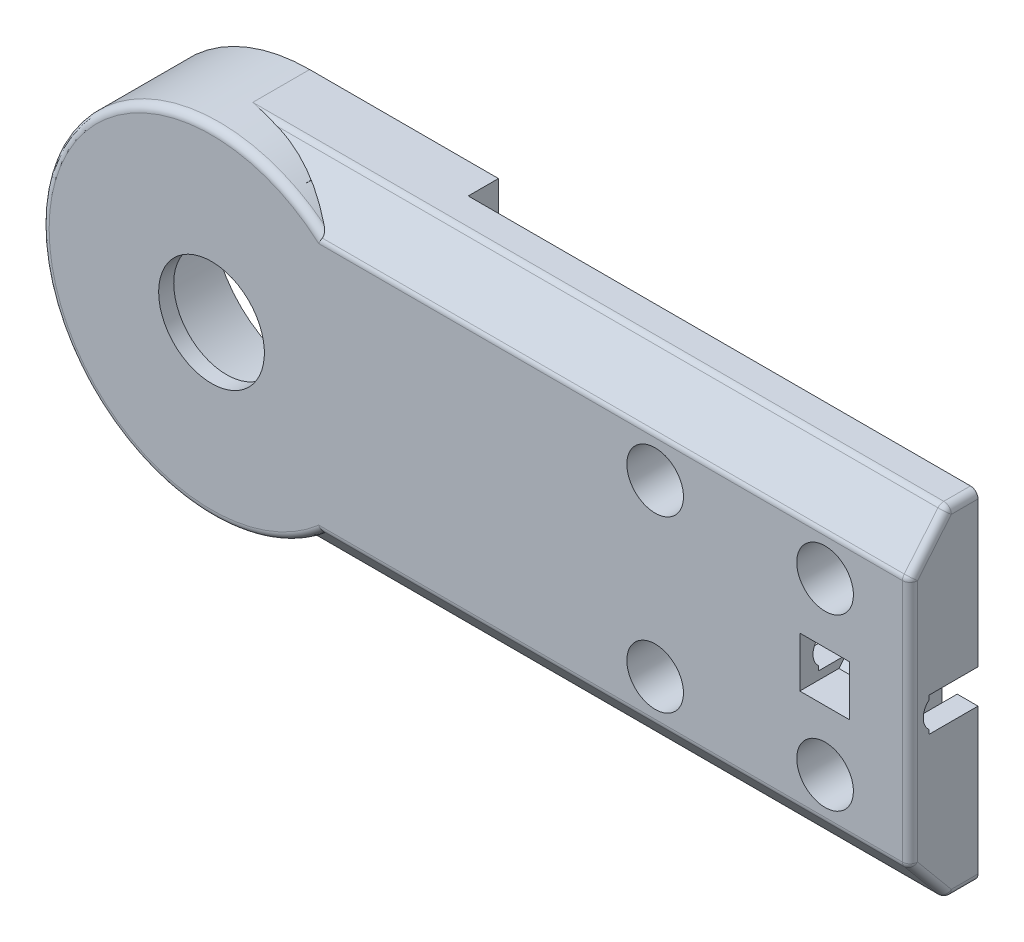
ISO-10303-21;
HEADER;
FILE_DESCRIPTION(('STEP AP214'),'2;1');
FILE_NAME('part.step','',(''),(''),'','','');
FILE_SCHEMA(('AUTOMOTIVE_DESIGN { 1 0 10303 214 1 1 1 1 }'));
ENDSEC;
DATA;
#1=APPLICATION_CONTEXT('core data for automotive mechanical design processes');
#2=APPLICATION_PROTOCOL_DEFINITION('international standard','automotive_design',2000,#1);
#3=PRODUCT_CONTEXT('',#1,'mechanical');
#4=PRODUCT('Part','Part','',(#3));
#5=PRODUCT_RELATED_PRODUCT_CATEGORY('part','',(#4));
#6=PRODUCT_DEFINITION_FORMATION('','',#4);
#7=PRODUCT_DEFINITION_CONTEXT('part definition',#1,'design');
#8=PRODUCT_DEFINITION('design','',#6,#7);
#9=PRODUCT_DEFINITION_SHAPE('','',#8);
#10=(LENGTH_UNIT() NAMED_UNIT(*) SI_UNIT(.MILLI.,.METRE.));
#11=(NAMED_UNIT(*) PLANE_ANGLE_UNIT() SI_UNIT($,.RADIAN.));
#12=(NAMED_UNIT(*) SI_UNIT($,.STERADIAN.) SOLID_ANGLE_UNIT());
#13=UNCERTAINTY_MEASURE_WITH_UNIT(LENGTH_MEASURE(1.E-05),#10,'distance_accuracy_value','');
#14=(GEOMETRIC_REPRESENTATION_CONTEXT(3) GLOBAL_UNCERTAINTY_ASSIGNED_CONTEXT((#13)) GLOBAL_UNIT_ASSIGNED_CONTEXT((#10,
#11,#12)) REPRESENTATION_CONTEXT('',''));
#15=CARTESIAN_POINT('',(0.,0.,0.));
#16=DIRECTION('',(0.,0.,1.));
#17=DIRECTION('',(1.,0.,0.));
#18=AXIS2_PLACEMENT_3D('',#15,#16,#17);
#19=CARTESIAN_POINT('',(0.,0.,0.));
#20=DIRECTION('',(0.,0.,1.));
#21=DIRECTION('',(1.,0.,0.));
#22=AXIS2_PLACEMENT_3D('',#19,#20,#21);
#23=CYLINDRICAL_SURFACE('',#22,40.);
#24=DIRECTION('',(0.,0.,-1.));
#25=VECTOR('',#24,1.);
#26=CARTESIAN_POINT('',(13.,37.8285606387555,20.2586154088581));
#27=LINE('',#26,#25);
#28=CARTESIAN_POINT('',(13.,37.8285606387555,21.9761994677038));
#29=VERTEX_POINT('',#28);
#30=CARTESIAN_POINT('',(13.,37.8285606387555,18.3571496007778));
#31=VERTEX_POINT('',#30);
#32=EDGE_CURVE('E1931',#29,#31,#27,.T.);
#33=ORIENTED_EDGE('',*,*,#32,.T.);
#34=CARTESIAN_POINT('',(24.,32.,22.));
#35=CARTESIAN_POINT('',(21.4947404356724,33.8788451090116,20.8257218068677));
#36=CARTESIAN_POINT('',(18.7281347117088,35.3448294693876,19.9094815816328));
#37=CARTESIAN_POINT('',(15.9619784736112,36.8105756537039,18.9933902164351));
#38=CARTESIAN_POINT('',(13.,37.8285606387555,18.3571496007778));
#39=B_SPLINE_CURVE_WITH_KNOTS('',2,(#34,#35,#36,#37,#38),.UNSPECIFIED.,.F.,.F.,(3,2,3),(0.,0.5,
1.),.UNSPECIFIED.);
#40=CARTESIAN_POINT('',(24.,32.,22.));
#41=VERTEX_POINT('',#40);
#42=EDGE_CURVE('E1530',#41,#31,#39,.T.);
#43=ORIENTED_EDGE('',*,*,#42,.F.);
#44=CARTESIAN_POINT('',(0.,0.,22.));
#45=DIRECTION('',(0.,0.,1.));
#46=DIRECTION('',(1.,0.,0.));
#47=AXIS2_PLACEMENT_3D('',#44,#45,#46);
#48=CIRCLE('',#47,40.);
#49=CARTESIAN_POINT('',(13.082813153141,37.8,22.));
#50=VERTEX_POINT('',#49);
#51=EDGE_CURVE('E1508',#41,#50,#48,.T.);
#52=ORIENTED_EDGE('',*,*,#51,.T.);
#53=CARTESIAN_POINT('',(13.,37.8285606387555,21.9761994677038));
#54=DIRECTION('',(0.912285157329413,-0.314629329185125,0.262191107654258));
#55=VECTOR('',#54,1.);
#56=LINE('',#53,#55);
#57=EDGE_CURVE('E1907',#29,#50,#56,.T.);
#58=ORIENTED_EDGE('',*,*,#57,.F.);
#59=EDGE_LOOP('',(#33,#43,#52,#58));
#60=FACE_BOUND('',#59,.T.);
#61=ADVANCED_FACE('F15',(#60),#23,.F.);
#62=CARTESIAN_POINT('',(0.,0.,0.));
#63=DIRECTION('',(0.,0.,1.));
#64=DIRECTION('',(1.,0.,0.));
#65=AXIS2_PLACEMENT_3D('',#62,#63,#64);
#66=CYLINDRICAL_SURFACE('',#65,40.);
#67=CARTESIAN_POINT('',(0.,0.,22.));
#68=DIRECTION('',(0.,0.,1.));
#69=DIRECTION('',(1.,0.,0.));
#70=AXIS2_PLACEMENT_3D('',#67,#68,#69);
#71=CIRCLE('',#70,40.);
#72=CARTESIAN_POINT('',(13.0828131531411,-37.8,22.));
#73=VERTEX_POINT('',#72);
#74=CARTESIAN_POINT('',(24.,-32.,22.));
#75=VERTEX_POINT('',#74);
#76=EDGE_CURVE('E1468',#73,#75,#71,.T.);
#77=ORIENTED_EDGE('',*,*,#76,.T.);
#78=CARTESIAN_POINT('',(13.,-37.8285606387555,18.3571496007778));
#79=CARTESIAN_POINT('',(15.918490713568,-36.8255158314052,18.9840526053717));
#80=CARTESIAN_POINT('',(18.6517692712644,-35.384824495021,19.8844846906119));
#81=CARTESIAN_POINT('',(21.4612093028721,-33.9039889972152,20.8100068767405));
#82=CARTESIAN_POINT('',(24.,-32.,22.));
#83=B_SPLINE_CURVE_WITH_KNOTS('',2,(#78,#79,#80,#81,#82),.UNSPECIFIED.,.F.,.F.,(3,2,3),(0.,0.5,
1.),.UNSPECIFIED.);
#84=CARTESIAN_POINT('',(13.,-37.8285606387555,18.3571496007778));
#85=VERTEX_POINT('',#84);
#86=EDGE_CURVE('E1577',#85,#75,#83,.T.);
#87=ORIENTED_EDGE('',*,*,#86,.F.);
#88=DIRECTION('',(0.,0.,1.));
#89=VECTOR('',#88,1.);
#90=CARTESIAN_POINT('',(13.,-37.8285606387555,19.4880997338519));
#91=LINE('',#90,#89);
#92=CARTESIAN_POINT('',(13.,-37.8285606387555,21.9761994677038));
#93=VERTEX_POINT('',#92);
#94=EDGE_CURVE('E1901',#85,#93,#91,.T.);
#95=ORIENTED_EDGE('',*,*,#94,.T.);
#96=CARTESIAN_POINT('',(13.0828131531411,-37.8,22.));
#97=DIRECTION('',(-0.912285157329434,-0.314629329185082,-0.262191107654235));
#98=VECTOR('',#97,1.);
#99=LINE('',#96,#98);
#100=EDGE_CURVE('E1958',#73,#93,#99,.T.);
#101=ORIENTED_EDGE('',*,*,#100,.F.);
#102=EDGE_LOOP('',(#77,#87,#95,#101));
#103=FACE_BOUND('',#102,.T.);
#104=ADVANCED_FACE('F1557',(#103),#66,.F.);
#105=CARTESIAN_POINT('',(39.2631677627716,39.,21.));
#106=DIRECTION('',(0.,0.64018439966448,0.768221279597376));
#107=DIRECTION('',(0.,-0.768221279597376,0.64018439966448));
#108=AXIS2_PLACEMENT_3D('',#105,#106,#107);
#109=PLANE('',#108);
#110=ORIENTED_EDGE('',*,*,#57,.T.);
#111=DIRECTION('',(1.,0.,0.));
#112=VECTOR('',#111,1.);
#113=CARTESIAN_POINT('',(25.7419849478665,37.8,22.));
#114=LINE('',#113,#112);
#115=CARTESIAN_POINT('',(13.4713715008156,37.8,22.));
#116=VERTEX_POINT('',#115);
#117=EDGE_CURVE('E1505',#50,#116,#114,.T.);
#118=ORIENTED_EDGE('',*,*,#117,.T.);
#119=DIRECTION('',(-0.928055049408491,-0.286118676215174,0.238432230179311));
#120=VECTOR('',#119,1.);
#121=CARTESIAN_POINT('',(20.6072954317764,40.,20.1666666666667));
#122=LINE('',#121,#120);
#123=CARTESIAN_POINT('',(20.6072954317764,40.,20.1666666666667));
#124=VERTEX_POINT('',#123);
#125=EDGE_CURVE('E19',#124,#116,#122,.T.);
#126=ORIENTED_EDGE('',*,*,#125,.F.);
#127=DIRECTION('',(1.,0.,0.));
#128=VECTOR('',#127,1.);
#129=CARTESIAN_POINT('',(2.75,40.,20.1666666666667));
#130=LINE('',#129,#128);
#131=CARTESIAN_POINT('',(13.,40.,20.1666666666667));
#132=VERTEX_POINT('',#131);
#133=EDGE_CURVE('E2816',#124,#132,#130,.F.);
#134=ORIENTED_EDGE('',*,*,#133,.T.);
#135=DIRECTION('',(0.,-0.768221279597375,0.640184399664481));
#136=VECTOR('',#135,1.);
#137=CARTESIAN_POINT('',(13.,40.,20.1666666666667));
#138=LINE('',#137,#136);
#139=EDGE_CURVE('E1915',#132,#29,#138,.T.);
#140=ORIENTED_EDGE('',*,*,#139,.T.);
#141=EDGE_LOOP('',(#110,#118,#126,#134,#140));
#142=FACE_BOUND('',#141,.T.);
#143=ADVANCED_FACE('F1552',(#142),#109,.T.);
#144=CARTESIAN_POINT('',(13.,36.686196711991,20.2586154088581));
#145=DIRECTION('',(1.,0.,0.));
#146=DIRECTION('',(0.,0.,-1.));
#147=AXIS2_PLACEMENT_3D('',#144,#145,#146);
#148=PLANE('',#147);
#149=ORIENTED_EDGE('',*,*,#139,.F.);
#150=DIRECTION('',(0.,0.,1.));
#151=VECTOR('',#150,1.);
#152=CARTESIAN_POINT('',(13.,40.,0.));
#153=LINE('',#152,#151);
#154=CARTESIAN_POINT('',(13.,40.,17.));
#155=VERTEX_POINT('',#154);
#156=EDGE_CURVE('E2812',#132,#155,#153,.F.);
#157=ORIENTED_EDGE('',*,*,#156,.T.);
#158=DIRECTION('',(0.,0.847998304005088,-0.52999894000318));
#159=VECTOR('',#158,1.);
#160=CARTESIAN_POINT('',(13.,32.,22.));
#161=LINE('',#160,#159);
#162=EDGE_CURVE('E1514',#31,#155,#161,.T.);
#163=ORIENTED_EDGE('',*,*,#162,.F.);
#164=ORIENTED_EDGE('',*,*,#32,.F.);
#165=EDGE_LOOP('',(#149,#157,#163,#164));
#166=FACE_BOUND('',#165,.T.);
#167=ADVANCED_FACE('F1549',(#166),#148,.F.);
#168=CARTESIAN_POINT('',(20.6072954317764,40.,22.));
#169=DIRECTION('',(-0.294615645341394,0.955615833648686,0.));
#170=DIRECTION('',(0.,0.,-1.));
#171=AXIS2_PLACEMENT_3D('',#168,#169,#170);
#172=PLANE('',#171);
#173=DIRECTION('',(0.955615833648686,0.294615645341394,0.));
#174=VECTOR('',#173,1.);
#175=CARTESIAN_POINT('',(13.4713715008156,37.8,22.));
#176=LINE('',#175,#174);
#177=CARTESIAN_POINT('',(20.6072954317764,40.,22.));
#178=VERTEX_POINT('',#177);
#179=EDGE_CURVE('E1507',#116,#178,#176,.T.);
#180=ORIENTED_EDGE('',*,*,#179,.T.);
#181=DIRECTION('',(0.,0.,1.));
#182=VECTOR('',#181,1.);
#183=CARTESIAN_POINT('',(20.6072954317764,40.,0.));
#184=LINE('',#183,#182);
#185=EDGE_CURVE('E1525',#178,#124,#184,.F.);
#186=ORIENTED_EDGE('',*,*,#185,.T.);
#187=ORIENTED_EDGE('',*,*,#125,.T.);
#188=EDGE_LOOP('',(#180,#186,#187));
#189=FACE_BOUND('',#188,.T.);
#190=ADVANCED_FACE('F1547',(#189),#172,.T.);
#191=CARTESIAN_POINT('',(45.,32.,22.));
#192=DIRECTION('',(0.,-0.52999894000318,-0.847998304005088));
#193=DIRECTION('',(0.,0.847998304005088,-0.52999894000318));
#194=AXIS2_PLACEMENT_3D('',#191,#192,#193);
#195=PLANE('',#194);
#196=DIRECTION('',(0.,-0.847998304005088,0.52999894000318));
#197=VECTOR('',#196,1.);
#198=CARTESIAN_POINT('',(45.,40.,17.));
#199=LINE('',#198,#197);
#200=CARTESIAN_POINT('',(45.,40.,17.));
#201=VERTEX_POINT('',#200);
#202=CARTESIAN_POINT('',(45.,32.,22.));
#203=VERTEX_POINT('',#202);
#204=EDGE_CURVE('E2820',#201,#203,#199,.T.);
#205=ORIENTED_EDGE('',*,*,#204,.T.);
#206=DIRECTION('',(1.,0.,0.));
#207=VECTOR('',#206,1.);
#208=CARTESIAN_POINT('',(25.7419849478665,32.,22.));
#209=LINE('',#208,#207);
#210=EDGE_CURVE('E1511',#203,#41,#209,.F.);
#211=ORIENTED_EDGE('',*,*,#210,.T.);
#212=ORIENTED_EDGE('',*,*,#42,.T.);
#213=ORIENTED_EDGE('',*,*,#162,.T.);
#214=DIRECTION('',(1.,0.,0.));
#215=VECTOR('',#214,1.);
#216=CARTESIAN_POINT('',(2.75,40.,17.));
#217=LINE('',#216,#215);
#218=EDGE_CURVE('E2809',#155,#201,#217,.T.);
#219=ORIENTED_EDGE('',*,*,#218,.T.);
#220=EDGE_LOOP('',(#205,#211,#212,#213,#219));
#221=FACE_BOUND('',#220,.T.);
#222=ADVANCED_FACE('F1536',(#221),#195,.T.);
#223=CARTESIAN_POINT('',(25.7419849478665,30.4412846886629,22.));
#224=DIRECTION('',(0.,0.,1.));
#225=DIRECTION('',(1.,0.,0.));
#226=AXIS2_PLACEMENT_3D('',#223,#224,#225);
#227=PLANE('',#226);
#228=ORIENTED_EDGE('',*,*,#117,.F.);
#229=ORIENTED_EDGE('',*,*,#51,.F.);
#230=ORIENTED_EDGE('',*,*,#210,.F.);
#231=DIRECTION('',(0.,1.,0.));
#232=VECTOR('',#231,1.);
#233=CARTESIAN_POINT('',(45.,40.,22.));
#234=LINE('',#233,#232);
#235=CARTESIAN_POINT('',(45.,20.1032827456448,22.));
#236=VERTEX_POINT('',#235);
#237=EDGE_CURVE('E1522',#203,#236,#234,.F.);
#238=ORIENTED_EDGE('',*,*,#237,.T.);
#239=DIRECTION('',(0.939692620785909,0.342020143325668,0.));
#240=VECTOR('',#239,1.);
#241=CARTESIAN_POINT('',(45.,20.1032827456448,22.));
#242=LINE('',#241,#240);
#243=CARTESIAN_POINT('',(27.7471401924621,13.8237553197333,22.));
#244=VERTEX_POINT('',#243);
#245=EDGE_CURVE('E1517',#236,#244,#242,.F.);
#246=ORIENTED_EDGE('',*,*,#245,.T.);
#247=CARTESIAN_POINT('',(0.,0.,22.));
#248=DIRECTION('',(0.,0.,1.));
#249=DIRECTION('',(1.,0.,0.));
#250=AXIS2_PLACEMENT_3D('',#247,#248,#249);
#251=CIRCLE('',#250,31.);
#252=CARTESIAN_POINT('',(2.75,30.8777832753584,22.));
#253=VERTEX_POINT('',#252);
#254=EDGE_CURVE('E1887',#253,#244,#251,.F.);
#255=ORIENTED_EDGE('',*,*,#254,.F.);
#256=DIRECTION('',(0.,1.,0.));
#257=VECTOR('',#256,1.);
#258=CARTESIAN_POINT('',(2.75,30.8777832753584,22.));
#259=LINE('',#258,#257);
#260=CARTESIAN_POINT('',(2.75,40.,22.));
#261=VERTEX_POINT('',#260);
#262=EDGE_CURVE('E2823',#253,#261,#259,.T.);
#263=ORIENTED_EDGE('',*,*,#262,.T.);
#264=DIRECTION('',(1.,0.,0.));
#265=VECTOR('',#264,1.);
#266=CARTESIAN_POINT('',(2.75,40.,22.));
#267=LINE('',#266,#265);
#268=EDGE_CURVE('E1920',#261,#178,#267,.T.);
#269=ORIENTED_EDGE('',*,*,#268,.T.);
#270=ORIENTED_EDGE('',*,*,#179,.F.);
#271=EDGE_LOOP('',(#228,#229,#230,#238,#246,#255,#263,#269,#270));
#272=FACE_BOUND('',#271,.T.);
#273=ADVANCED_FACE('F1546',(#272),#227,.F.);
#274=CARTESIAN_POINT('',(45.,-40.,17.));
#275=DIRECTION('',(0.,0.52999894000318,-0.847998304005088));
#276=DIRECTION('',(-1.,0.,0.));
#277=AXIS2_PLACEMENT_3D('',#274,#275,#276);
#278=PLANE('',#277);
#279=DIRECTION('',(1.,0.,0.));
#280=VECTOR('',#279,1.);
#281=CARTESIAN_POINT('',(45.,-40.,17.));
#282=LINE('',#281,#280);
#283=CARTESIAN_POINT('',(45.,-40.,17.));
#284=VERTEX_POINT('',#283);
#285=CARTESIAN_POINT('',(13.,-40.,17.));
#286=VERTEX_POINT('',#285);
#287=EDGE_CURVE('E1488',#284,#286,#282,.F.);
#288=ORIENTED_EDGE('',*,*,#287,.T.);
#289=DIRECTION('',(0.,0.847998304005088,0.52999894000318));
#290=VECTOR('',#289,1.);
#291=CARTESIAN_POINT('',(13.,-40.,17.));
#292=LINE('',#291,#290);
#293=EDGE_CURVE('E1899',#286,#85,#292,.T.);
#294=ORIENTED_EDGE('',*,*,#293,.T.);
#295=ORIENTED_EDGE('',*,*,#86,.T.);
#296=DIRECTION('',(1.,0.,0.));
#297=VECTOR('',#296,1.);
#298=CARTESIAN_POINT('',(25.7419849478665,-32.,22.));
#299=LINE('',#298,#297);
#300=CARTESIAN_POINT('',(45.,-32.,22.));
#301=VERTEX_POINT('',#300);
#302=EDGE_CURVE('E1465',#75,#301,#299,.T.);
#303=ORIENTED_EDGE('',*,*,#302,.T.);
#304=DIRECTION('',(0.,-0.847998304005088,-0.52999894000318));
#305=VECTOR('',#304,1.);
#306=CARTESIAN_POINT('',(45.,-32.,22.));
#307=LINE('',#306,#305);
#308=EDGE_CURVE('E1485',#301,#284,#307,.T.);
#309=ORIENTED_EDGE('',*,*,#308,.T.);
#310=EDGE_LOOP('',(#288,#294,#295,#303,#309));
#311=FACE_BOUND('',#310,.T.);
#312=ADVANCED_FACE('F1583',(#311),#278,.T.);
#313=CARTESIAN_POINT('',(13.,-40.,21.9761994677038));
#314=DIRECTION('',(1.,0.,0.));
#315=DIRECTION('',(0.,0.,-1.));
#316=AXIS2_PLACEMENT_3D('',#313,#314,#315);
#317=PLANE('',#316);
#318=ORIENTED_EDGE('',*,*,#293,.F.);
#319=DIRECTION('',(0.,0.,-1.));
#320=VECTOR('',#319,1.);
#321=CARTESIAN_POINT('',(13.,-40.,0.));
#322=LINE('',#321,#320);
#323=CARTESIAN_POINT('',(13.,-40.,20.1666666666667));
#324=VERTEX_POINT('',#323);
#325=EDGE_CURVE('E1490',#286,#324,#322,.F.);
#326=ORIENTED_EDGE('',*,*,#325,.T.);
#327=DIRECTION('',(0.,-0.768221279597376,-0.64018439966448));
#328=VECTOR('',#327,1.);
#329=CARTESIAN_POINT('',(13.,-39.,21.));
#330=LINE('',#329,#328);
#331=EDGE_CURVE('E1989',#93,#324,#330,.T.);
#332=ORIENTED_EDGE('',*,*,#331,.F.);
#333=ORIENTED_EDGE('',*,*,#94,.F.);
#334=EDGE_LOOP('',(#318,#326,#332,#333));
#335=FACE_BOUND('',#334,.T.);
#336=ADVANCED_FACE('F1593',(#335),#317,.F.);
#337=CARTESIAN_POINT('',(131.763167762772,-39.,21.));
#338=DIRECTION('',(0.,-0.64018439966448,0.768221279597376));
#339=DIRECTION('',(0.,-0.768221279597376,-0.64018439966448));
#340=AXIS2_PLACEMENT_3D('',#337,#338,#339);
#341=PLANE('',#340);
#342=ORIENTED_EDGE('',*,*,#331,.T.);
#343=DIRECTION('',(1.,0.,0.));
#344=VECTOR('',#343,1.);
#345=CARTESIAN_POINT('',(45.,-40.,20.1666666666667));
#346=LINE('',#345,#344);
#347=CARTESIAN_POINT('',(20.6072954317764,-40.,20.1666666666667));
#348=VERTEX_POINT('',#347);
#349=EDGE_CURVE('E1498',#324,#348,#346,.T.);
#350=ORIENTED_EDGE('',*,*,#349,.T.);
#351=DIRECTION('',(0.928055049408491,-0.286118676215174,-0.238432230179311));
#352=VECTOR('',#351,1.);
#353=CARTESIAN_POINT('',(13.4713715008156,-37.8,22.));
#354=LINE('',#353,#352);
#355=CARTESIAN_POINT('',(13.4713715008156,-37.8,22.));
#356=VERTEX_POINT('',#355);
#357=EDGE_CURVE('E1474',#356,#348,#354,.T.);
#358=ORIENTED_EDGE('',*,*,#357,.F.);
#359=DIRECTION('',(1.,0.,0.));
#360=VECTOR('',#359,1.);
#361=CARTESIAN_POINT('',(25.7419849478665,-37.8,22.));
#362=LINE('',#361,#360);
#363=EDGE_CURVE('E1471',#356,#73,#362,.F.);
#364=ORIENTED_EDGE('',*,*,#363,.T.);
#365=ORIENTED_EDGE('',*,*,#100,.T.);
#366=EDGE_LOOP('',(#342,#350,#358,#364,#365));
#367=FACE_BOUND('',#366,.T.);
#368=ADVANCED_FACE('F1596',(#367),#341,.T.);
#369=CARTESIAN_POINT('',(13.4713715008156,-37.8,22.));
#370=DIRECTION('',(-0.294615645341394,-0.955615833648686,0.));
#371=DIRECTION('',(0.955615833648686,-0.294615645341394,0.));
#372=AXIS2_PLACEMENT_3D('',#369,#370,#371);
#373=PLANE('',#372);
#374=DIRECTION('',(0.,0.,-1.));
#375=VECTOR('',#374,1.);
#376=CARTESIAN_POINT('',(20.6072954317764,-40.,0.));
#377=LINE('',#376,#375);
#378=CARTESIAN_POINT('',(20.6072954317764,-40.,22.));
#379=VERTEX_POINT('',#378);
#380=EDGE_CURVE('E1494',#348,#379,#377,.F.);
#381=ORIENTED_EDGE('',*,*,#380,.T.);
#382=DIRECTION('',(-0.955615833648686,0.294615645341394,0.));
#383=VECTOR('',#382,1.);
#384=CARTESIAN_POINT('',(20.6072954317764,-40.,22.));
#385=LINE('',#384,#383);
#386=EDGE_CURVE('E1467',#379,#356,#385,.T.);
#387=ORIENTED_EDGE('',*,*,#386,.T.);
#388=ORIENTED_EDGE('',*,*,#357,.T.);
#389=EDGE_LOOP('',(#381,#387,#388));
#390=FACE_BOUND('',#389,.T.);
#391=ADVANCED_FACE('F2011',(#390),#373,.T.);
#392=CARTESIAN_POINT('',(25.7419849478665,-30.4412846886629,22.));
#393=DIRECTION('',(0.,0.,1.));
#394=DIRECTION('',(1.,0.,0.));
#395=AXIS2_PLACEMENT_3D('',#392,#393,#394);
#396=PLANE('',#395);
#397=DIRECTION('',(1.,0.,0.));
#398=VECTOR('',#397,1.);
#399=CARTESIAN_POINT('',(45.,-40.,22.));
#400=LINE('',#399,#398);
#401=CARTESIAN_POINT('',(2.75,-40.,22.));
#402=VERTEX_POINT('',#401);
#403=EDGE_CURVE('E1482',#379,#402,#400,.F.);
#404=ORIENTED_EDGE('',*,*,#403,.T.);
#405=DIRECTION('',(0.,1.,0.));
#406=VECTOR('',#405,1.);
#407=CARTESIAN_POINT('',(2.75,-40.,22.));
#408=LINE('',#407,#406);
#409=CARTESIAN_POINT('',(2.74999999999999,-30.8777832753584,22.));
#410=VERTEX_POINT('',#409);
#411=EDGE_CURVE('E1477',#402,#410,#408,.T.);
#412=ORIENTED_EDGE('',*,*,#411,.T.);
#413=CARTESIAN_POINT('',(0.,0.,22.));
#414=DIRECTION('',(0.,0.,1.));
#415=DIRECTION('',(1.,0.,0.));
#416=AXIS2_PLACEMENT_3D('',#413,#414,#415);
#417=CIRCLE('',#416,31.);
#418=CARTESIAN_POINT('',(27.7471401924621,-13.8237553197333,22.));
#419=VERTEX_POINT('',#418);
#420=EDGE_CURVE('E1520',#419,#410,#417,.F.);
#421=ORIENTED_EDGE('',*,*,#420,.F.);
#422=DIRECTION('',(-0.939692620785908,0.342020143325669,0.));
#423=VECTOR('',#422,1.);
#424=CARTESIAN_POINT('',(27.7471401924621,-13.8237553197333,22.));
#425=LINE('',#424,#423);
#426=CARTESIAN_POINT('',(45.,-20.1032827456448,22.));
#427=VERTEX_POINT('',#426);
#428=EDGE_CURVE('E1502',#419,#427,#425,.F.);
#429=ORIENTED_EDGE('',*,*,#428,.T.);
#430=DIRECTION('',(0.,1.,0.));
#431=VECTOR('',#430,1.);
#432=CARTESIAN_POINT('',(45.,-20.1032827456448,22.));
#433=LINE('',#432,#431);
#434=EDGE_CURVE('E1487',#427,#301,#433,.F.);
#435=ORIENTED_EDGE('',*,*,#434,.T.);
#436=ORIENTED_EDGE('',*,*,#302,.F.);
#437=ORIENTED_EDGE('',*,*,#76,.F.);
#438=ORIENTED_EDGE('',*,*,#363,.F.);
#439=ORIENTED_EDGE('',*,*,#386,.F.);
#440=EDGE_LOOP('',(#404,#412,#421,#429,#435,#436,#437,#438,#439));
#441=FACE_BOUND('',#440,.T.);
#442=ADVANCED_FACE('F1962',(#441),#396,.F.);
#443=CARTESIAN_POINT('',(38.7847609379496,0.,22.));
#444=DIRECTION('',(0.,0.,1.));
#445=DIRECTION('',(1.,0.,0.));
#446=AXIS2_PLACEMENT_3D('',#443,#444,#445);
#447=PLANE('',#446);
#448=CARTESIAN_POINT('',(0.,0.,22.));
#449=DIRECTION('',(0.,0.,1.));
#450=DIRECTION('',(1.,0.,0.));
#451=AXIS2_PLACEMENT_3D('',#448,#449,#450);
#452=CIRCLE('',#451,31.);
#453=CARTESIAN_POINT('',(30.1412811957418,7.2459069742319,22.));
#454=VERTEX_POINT('',#453);
#455=CARTESIAN_POINT('',(30.1412811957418,-7.24590697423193,22.));
#456=VERTEX_POINT('',#455);
#457=EDGE_CURVE('E1480',#454,#456,#452,.F.);
#458=ORIENTED_EDGE('',*,*,#457,.F.);
#459=DIRECTION('',(-0.939692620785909,-0.342020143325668,0.));
#460=VECTOR('',#459,1.);
#461=CARTESIAN_POINT('',(30.1412811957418,7.2459069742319,22.));
#462=LINE('',#461,#460);
#463=CARTESIAN_POINT('',(45.,12.6540383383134,22.));
#464=VERTEX_POINT('',#463);
#465=EDGE_CURVE('E1462',#454,#464,#462,.F.);
#466=ORIENTED_EDGE('',*,*,#465,.T.);
#467=DIRECTION('',(0.,1.,0.));
#468=VECTOR('',#467,1.);
#469=CARTESIAN_POINT('',(45.,12.6540383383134,22.));
#470=LINE('',#469,#468);
#471=CARTESIAN_POINT('',(45.,-12.6540383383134,22.));
#472=VERTEX_POINT('',#471);
#473=EDGE_CURVE('E1458',#464,#472,#470,.F.);
#474=ORIENTED_EDGE('',*,*,#473,.T.);
#475=DIRECTION('',(0.939692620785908,-0.342020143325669,0.));
#476=VECTOR('',#475,1.);
#477=CARTESIAN_POINT('',(45.,-12.6540383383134,22.));
#478=LINE('',#477,#476);
#479=EDGE_CURVE('E1450',#472,#456,#478,.F.);
#480=ORIENTED_EDGE('',*,*,#479,.T.);
#481=EDGE_LOOP('',(#458,#466,#474,#480));
#482=FACE_BOUND('',#481,.T.);
#483=ADVANCED_FACE('F2017',(#482),#447,.F.);
#484=CARTESIAN_POINT('',(-34.1359594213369,0.,22.));
#485=DIRECTION('',(0.,0.,1.));
#486=DIRECTION('',(1.,0.,0.));
#487=AXIS2_PLACEMENT_3D('',#484,#485,#486);
#488=PLANE('',#487);
#489=DIRECTION('',(0.866025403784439,0.5,0.));
#490=VECTOR('',#489,1.);
#491=CARTESIAN_POINT('',(-28.1159447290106,-13.057321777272,22.));
#492=LINE('',#491,#490);
#493=CARTESIAN_POINT('',(-28.1159447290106,-13.057321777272,22.));
#494=VERTEX_POINT('',#493);
#495=CARTESIAN_POINT('',(-35.9340527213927,-17.5711085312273,22.));
#496=VERTEX_POINT('',#495);
#497=EDGE_CURVE('E1447',#494,#496,#492,.F.);
#498=ORIENTED_EDGE('',*,*,#497,.T.);
#499=CARTESIAN_POINT('',(0.,0.,22.));
#500=DIRECTION('',(0.,0.,1.));
#501=DIRECTION('',(1.,0.,0.));
#502=AXIS2_PLACEMENT_3D('',#499,#500,#501);
#503=CIRCLE('',#502,40.);
#504=CARTESIAN_POINT('',(-35.9340527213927,17.5711085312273,22.));
#505=VERTEX_POINT('',#504);
#506=EDGE_CURVE('E1883',#496,#505,#503,.F.);
#507=ORIENTED_EDGE('',*,*,#506,.T.);
#508=DIRECTION('',(-0.866025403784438,0.5,0.));
#509=VECTOR('',#508,1.);
#510=CARTESIAN_POINT('',(-35.9340527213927,17.5711085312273,22.));
#511=LINE('',#510,#509);
#512=CARTESIAN_POINT('',(-28.1159447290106,13.057321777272,22.));
#513=VERTEX_POINT('',#512);
#514=EDGE_CURVE('E1451',#505,#513,#511,.F.);
#515=ORIENTED_EDGE('',*,*,#514,.T.);
#516=CARTESIAN_POINT('',(0.,0.,22.));
#517=DIRECTION('',(0.,0.,1.));
#518=DIRECTION('',(1.,0.,0.));
#519=AXIS2_PLACEMENT_3D('',#516,#517,#518);
#520=CIRCLE('',#519,31.);
#521=EDGE_CURVE('E1453',#494,#513,#520,.F.);
#522=ORIENTED_EDGE('',*,*,#521,.F.);
#523=EDGE_LOOP('',(#498,#507,#515,#522));
#524=FACE_BOUND('',#523,.T.);
#525=ADVANCED_FACE('F2020',(#524),#488,.F.);
#526=CARTESIAN_POINT('',(-17.0679797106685,-29.5626080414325,22.));
#527=DIRECTION('',(0.,0.,1.));
#528=DIRECTION('',(1.,0.,0.));
#529=AXIS2_PLACEMENT_3D('',#526,#527,#528);
#530=PLANE('',#529);
#531=DIRECTION('',(0.,1.,0.));
#532=VECTOR('',#531,1.);
#533=CARTESIAN_POINT('',(-2.75,-30.8777832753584,22.));
#534=LINE('',#533,#532);
#535=CARTESIAN_POINT('',(-2.75000000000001,-30.8777832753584,22.));
#536=VERTEX_POINT('',#535);
#537=CARTESIAN_POINT('',(-2.75,-39.9053567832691,22.));
#538=VERTEX_POINT('',#537);
#539=EDGE_CURVE('E1439',#536,#538,#534,.F.);
#540=ORIENTED_EDGE('',*,*,#539,.T.);
#541=CARTESIAN_POINT('',(0.,0.,22.));
#542=DIRECTION('',(0.,0.,1.));
#543=DIRECTION('',(1.,0.,0.));
#544=AXIS2_PLACEMENT_3D('',#541,#542,#543);
#545=CIRCLE('',#544,40.);
#546=CARTESIAN_POINT('',(-33.1840527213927,-22.3342482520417,22.));
#547=VERTEX_POINT('',#546);
#548=EDGE_CURVE('E1878',#538,#547,#545,.F.);
#549=ORIENTED_EDGE('',*,*,#548,.T.);
#550=DIRECTION('',(-0.866025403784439,-0.5,0.));
#551=VECTOR('',#550,1.);
#552=CARTESIAN_POINT('',(-33.1840527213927,-22.3342482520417,22.));
#553=LINE('',#552,#551);
#554=CARTESIAN_POINT('',(-25.3659447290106,-17.8204614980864,22.));
#555=VERTEX_POINT('',#554);
#556=EDGE_CURVE('E1443',#547,#555,#553,.F.);
#557=ORIENTED_EDGE('',*,*,#556,.T.);
#558=CARTESIAN_POINT('',(0.,0.,22.));
#559=DIRECTION('',(0.,0.,1.));
#560=DIRECTION('',(1.,0.,0.));
#561=AXIS2_PLACEMENT_3D('',#558,#559,#560);
#562=CIRCLE('',#561,31.);
#563=EDGE_CURVE('E1445',#536,#555,#562,.F.);
#564=ORIENTED_EDGE('',*,*,#563,.F.);
#565=EDGE_LOOP('',(#540,#549,#557,#564));
#566=FACE_BOUND('',#565,.T.);
#567=ADVANCED_FACE('F2024',(#566),#530,.F.);
#568=CARTESIAN_POINT('',(-17.0679797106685,29.5626080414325,22.));
#569=DIRECTION('',(0.,0.,1.));
#570=DIRECTION('',(1.,0.,0.));
#571=AXIS2_PLACEMENT_3D('',#568,#569,#570);
#572=PLANE('',#571);
#573=CARTESIAN_POINT('',(0.,0.,22.));
#574=DIRECTION('',(0.,0.,1.));
#575=DIRECTION('',(1.,0.,0.));
#576=AXIS2_PLACEMENT_3D('',#573,#574,#575);
#577=CIRCLE('',#576,31.);
#578=CARTESIAN_POINT('',(-25.3659447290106,17.8204614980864,22.));
#579=VERTEX_POINT('',#578);
#580=CARTESIAN_POINT('',(-2.75,30.8777832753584,22.));
#581=VERTEX_POINT('',#580);
#582=EDGE_CURVE('E1872',#579,#581,#577,.F.);
#583=ORIENTED_EDGE('',*,*,#582,.F.);
#584=DIRECTION('',(0.866025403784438,-0.500000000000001,0.));
#585=VECTOR('',#584,1.);
#586=CARTESIAN_POINT('',(-25.3659447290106,17.8204614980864,22.));
#587=LINE('',#586,#585);
#588=CARTESIAN_POINT('',(-33.1840527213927,22.3342482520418,22.));
#589=VERTEX_POINT('',#588);
#590=EDGE_CURVE('E1435',#579,#589,#587,.F.);
#591=ORIENTED_EDGE('',*,*,#590,.T.);
#592=CARTESIAN_POINT('',(0.,0.,22.));
#593=DIRECTION('',(0.,0.,1.));
#594=DIRECTION('',(1.,0.,0.));
#595=AXIS2_PLACEMENT_3D('',#592,#593,#594);
#596=CIRCLE('',#595,40.);
#597=CARTESIAN_POINT('',(-2.75,39.9053567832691,22.));
#598=VERTEX_POINT('',#597);
#599=EDGE_CURVE('E1869',#589,#598,#596,.F.);
#600=ORIENTED_EDGE('',*,*,#599,.T.);
#601=DIRECTION('',(0.,1.,0.));
#602=VECTOR('',#601,1.);
#603=CARTESIAN_POINT('',(-2.75,39.9053567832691,22.));
#604=LINE('',#603,#602);
#605=EDGE_CURVE('E1431',#598,#581,#604,.F.);
#606=ORIENTED_EDGE('',*,*,#605,.T.);
#607=EDGE_LOOP('',(#583,#591,#600,#606));
#608=FACE_BOUND('',#607,.T.);
#609=ADVANCED_FACE('F2028',(#608),#572,.F.);
#610=CARTESIAN_POINT('',(174.75,-22.5,5.));
#611=DIRECTION('',(0.,0.,1.));
#612=DIRECTION('',(1.,0.,0.));
#613=AXIS2_PLACEMENT_3D('',#610,#611,#612);
#614=PLANE('',#613);
#615=DIRECTION('',(1.,0.,0.));
#616=VECTOR('',#615,1.);
#617=CARTESIAN_POINT('',(171.,-26.6,5.));
#618=LINE('',#617,#616);
#619=CARTESIAN_POINT('',(171.,-26.6,5.));
#620=VERTEX_POINT('',#619);
#621=CARTESIAN_POINT('',(178.5,-26.6,5.));
#622=VERTEX_POINT('',#621);
#623=EDGE_CURVE('E1163',#620,#622,#618,.T.);
#624=ORIENTED_EDGE('',*,*,#623,.F.);
#625=DIRECTION('',(0.,1.,0.));
#626=VECTOR('',#625,1.);
#627=CARTESIAN_POINT('',(171.,-18.4,5.));
#628=LINE('',#627,#626);
#629=CARTESIAN_POINT('',(171.,-18.4,5.));
#630=VERTEX_POINT('',#629);
#631=EDGE_CURVE('E1157',#630,#620,#628,.F.);
#632=ORIENTED_EDGE('',*,*,#631,.F.);
#633=DIRECTION('',(1.,0.,0.));
#634=VECTOR('',#633,1.);
#635=CARTESIAN_POINT('',(179.5,-18.4,5.));
#636=LINE('',#635,#634);
#637=CARTESIAN_POINT('',(178.5,-18.4,5.));
#638=VERTEX_POINT('',#637);
#639=EDGE_CURVE('E1149',#630,#638,#636,.T.);
#640=ORIENTED_EDGE('',*,*,#639,.T.);
#641=DIRECTION('',(0.,1.,0.));
#642=VECTOR('',#641,1.);
#643=CARTESIAN_POINT('',(178.5,-26.6,5.));
#644=LINE('',#643,#642);
#645=EDGE_CURVE('E1166',#622,#638,#644,.T.);
#646=ORIENTED_EDGE('',*,*,#645,.F.);
#647=EDGE_LOOP('',(#624,#632,#640,#646));
#648=FACE_BOUND('',#647,.T.);
#649=ADVANCED_FACE('F2032',(#648),#614,.F.);
#650=CARTESIAN_POINT('',(175.25,22.5,5.));
#651=DIRECTION('',(0.,0.,1.));
#652=DIRECTION('',(1.,0.,0.));
#653=AXIS2_PLACEMENT_3D('',#650,#651,#652);
#654=PLANE('',#653);
#655=DIRECTION('',(1.,0.,0.));
#656=VECTOR('',#655,1.);
#657=CARTESIAN_POINT('',(175.5,18.4,5.));
#658=LINE('',#657,#656);
#659=CARTESIAN_POINT('',(179.5,18.4,5.));
#660=VERTEX_POINT('',#659);
#661=CARTESIAN_POINT('',(171.,18.4,5.));
#662=VERTEX_POINT('',#661);
#663=EDGE_CURVE('E1206',#660,#662,#658,.F.);
#664=ORIENTED_EDGE('',*,*,#663,.T.);
#665=DIRECTION('',(0.,1.,0.));
#666=VECTOR('',#665,1.);
#667=CARTESIAN_POINT('',(171.,26.6,5.));
#668=LINE('',#667,#666);
#669=CARTESIAN_POINT('',(171.,26.6,5.));
#670=VERTEX_POINT('',#669);
#671=EDGE_CURVE('E1415',#670,#662,#668,.F.);
#672=ORIENTED_EDGE('',*,*,#671,.F.);
#673=DIRECTION('',(1.,0.,0.));
#674=VECTOR('',#673,1.);
#675=CARTESIAN_POINT('',(179.5,26.6,5.));
#676=LINE('',#675,#674);
#677=CARTESIAN_POINT('',(179.5,26.6,5.));
#678=VERTEX_POINT('',#677);
#679=EDGE_CURVE('E1200',#678,#670,#676,.F.);
#680=ORIENTED_EDGE('',*,*,#679,.F.);
#681=DIRECTION('',(0.,1.,0.));
#682=VECTOR('',#681,1.);
#683=CARTESIAN_POINT('',(179.5,18.4,5.));
#684=LINE('',#683,#682);
#685=EDGE_CURVE('E1195',#660,#678,#684,.T.);
#686=ORIENTED_EDGE('',*,*,#685,.F.);
#687=EDGE_LOOP('',(#664,#672,#680,#686));
#688=FACE_BOUND('',#687,.T.);
#689=ADVANCED_FACE('F2036',(#688),#654,.F.);
#690=CARTESIAN_POINT('',(141.,22.5,5.));
#691=DIRECTION('',(0.,0.,1.));
#692=DIRECTION('',(1.,0.,0.));
#693=AXIS2_PLACEMENT_3D('',#690,#691,#692);
#694=PLANE('',#693);
#695=DIRECTION('',(1.,0.,0.));
#696=VECTOR('',#695,1.);
#697=CARTESIAN_POINT('',(129.836531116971,18.4,5.));
#698=LINE('',#697,#696);
#699=CARTESIAN_POINT('',(156.,18.4,5.));
#700=VERTEX_POINT('',#699);
#701=CARTESIAN_POINT('',(126.,18.4,5.));
#702=VERTEX_POINT('',#701);
#703=EDGE_CURVE('E1101',#700,#702,#698,.F.);
#704=ORIENTED_EDGE('',*,*,#703,.T.);
#705=DIRECTION('',(0.,1.,0.));
#706=VECTOR('',#705,1.);
#707=CARTESIAN_POINT('',(126.,26.6,5.));
#708=LINE('',#707,#706);
#709=CARTESIAN_POINT('',(126.,26.6,5.));
#710=VERTEX_POINT('',#709);
#711=EDGE_CURVE('E1205',#710,#702,#708,.F.);
#712=ORIENTED_EDGE('',*,*,#711,.F.);
#713=DIRECTION('',(1.,0.,0.));
#714=VECTOR('',#713,1.);
#715=CARTESIAN_POINT('',(156.,26.6,5.));
#716=LINE('',#715,#714);
#717=CARTESIAN_POINT('',(156.,26.6,5.));
#718=VERTEX_POINT('',#717);
#719=EDGE_CURVE('E1145',#718,#710,#716,.F.);
#720=ORIENTED_EDGE('',*,*,#719,.F.);
#721=DIRECTION('',(0.,1.,0.));
#722=VECTOR('',#721,1.);
#723=CARTESIAN_POINT('',(156.,18.4,5.));
#724=LINE('',#723,#722);
#725=EDGE_CURVE('E1140',#700,#718,#724,.T.);
#726=ORIENTED_EDGE('',*,*,#725,.F.);
#727=EDGE_LOOP('',(#704,#712,#720,#726));
#728=FACE_BOUND('',#727,.T.);
#729=ADVANCED_FACE('F2039',(#728),#694,.F.);
#730=CARTESIAN_POINT('',(104.,0.,18.));
#731=DIRECTION('',(-1.,0.,0.));
#732=DIRECTION('',(0.,0.,1.));
#733=AXIS2_PLACEMENT_3D('',#730,#731,#732);
#734=PLANE('',#733);
#735=CARTESIAN_POINT('',(104.,0.,18.));
#736=DIRECTION('',(-1.,0.,0.));
#737=DIRECTION('',(0.,0.,1.));
#738=AXIS2_PLACEMENT_3D('',#735,#736,#737);
#739=CIRCLE('',#738,4.5);
#740=CARTESIAN_POINT('',(104.,4.22838806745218,16.4602810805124));
#741=VERTEX_POINT('',#740);
#742=CARTESIAN_POINT('',(104.,4.22838806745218,19.5397189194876));
#743=VERTEX_POINT('',#742);
#744=EDGE_CURVE('E1493',#741,#743,#739,.F.);
#745=ORIENTED_EDGE('',*,*,#744,.T.);
#746=DIRECTION('',(0.,0.,1.));
#747=VECTOR('',#746,1.);
#748=CARTESIAN_POINT('',(104.,4.22838806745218,8.));
#749=LINE('',#748,#747);
#750=EDGE_CURVE('E1066',#743,#741,#749,.F.);
#751=ORIENTED_EDGE('',*,*,#750,.T.);
#752=EDGE_LOOP('',(#745,#751));
#753=FACE_BOUND('',#752,.T.);
#754=ADVANCED_FACE('F1395',(#753),#734,.F.);
#755=CARTESIAN_POINT('',(185.,0.,18.));
#756=DIRECTION('',(-1.,0.,0.));
#757=DIRECTION('',(0.,0.,1.));
#758=AXIS2_PLACEMENT_3D('',#755,#756,#757);
#759=CYLINDRICAL_SURFACE('',#758,4.5);
#760=ORIENTED_EDGE('',*,*,#744,.F.);
#761=CARTESIAN_POINT('',(104.,4.22838806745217,16.4602810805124));
#762=CARTESIAN_POINT('',(104.011719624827,4.25178354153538,16.5245248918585));
#763=CARTESIAN_POINT('',(104.022804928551,4.27374957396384,16.5894071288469));
#764=CARTESIAN_POINT('',(104.043477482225,4.31443296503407,16.7192879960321));
#765=CARTESIAN_POINT('',(104.053085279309,4.33319537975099,16.7842692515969));
#766=CARTESIAN_POINT('',(104.070803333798,4.36754467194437,16.9141826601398));
#767=CARTESIAN_POINT('',(104.078934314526,4.38317587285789,16.9791002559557));
#768=CARTESIAN_POINT('',(104.093698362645,4.41134507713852,17.1087276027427));
#769=CARTESIAN_POINT('',(104.10035229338,4.42392643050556,17.1734255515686));
#770=CARTESIAN_POINT('',(104.112162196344,4.44608427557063,17.3024645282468));
#771=CARTESIAN_POINT('',(104.117339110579,4.45570294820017,17.3667963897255));
#772=CARTESIAN_POINT('',(104.126194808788,4.47202966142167,17.4949631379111));
#773=CARTESIAN_POINT('',(104.129894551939,4.47877851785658,17.558791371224));
#774=CARTESIAN_POINT('',(104.135796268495,4.48946483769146,17.6858200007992));
#775=CARTESIAN_POINT('',(104.138019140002,4.49344156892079,17.7490161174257));
#776=CARTESIAN_POINT('',(104.140965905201,4.49868723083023,17.8746589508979));
#777=CARTESIAN_POINT('',(104.1417105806,4.49999371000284,17.9371036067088));
#778=CARTESIAN_POINT('',(104.141705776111,4.50000625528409,18.0620988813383));
#779=CARTESIAN_POINT('',(104.140953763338,4.49870791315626,18.1246495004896));
#780=CARTESIAN_POINT('',(104.137995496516,4.49347063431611,18.2504847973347));
#781=CARTESIAN_POINT('',(104.13576898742,4.48949490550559,18.3137674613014));
#782=CARTESIAN_POINT('',(104.129860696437,4.47880500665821,18.4409493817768));
#783=CARTESIAN_POINT('',(104.126158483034,4.47205234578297,18.5048444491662));
#784=CARTESIAN_POINT('',(104.117299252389,4.45571482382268,18.6331249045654));
#785=CARTESIAN_POINT('',(104.112121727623,4.44608994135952,18.6975037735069));
#786=CARTESIAN_POINT('',(104.10031184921,4.42391892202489,18.82661685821));
#787=CARTESIAN_POINT('',(104.09365897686,4.41133141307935,18.8913420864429));
#788=CARTESIAN_POINT('',(104.078898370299,4.3831516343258,19.0210043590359));
#789=CARTESIAN_POINT('',(104.07077017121,4.36751683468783,19.085929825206));
#790=CARTESIAN_POINT('',(104.053059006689,4.33316459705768,19.2158398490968));
#791=CARTESIAN_POINT('',(104.043455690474,4.31440366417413,19.2808101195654));
#792=CARTESIAN_POINT('',(104.02279349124,4.27373002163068,19.4106506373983));
#793=CARTESIAN_POINT('',(104.011714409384,4.25177308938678,19.4755038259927));
#794=CARTESIAN_POINT('',(104.,4.22838806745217,19.5397189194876));
#795=B_SPLINE_CURVE_WITH_KNOTS('',3,(#761,#762,#763,#764,#765,#766,#767,#768,#769,#770,#771,
#772,#773,#774,#775,#776,#777,#778,#779,#780,#781,#782,#783,#784,#785,#786,#787,#788,#789,#790,
#791,#792,#793,#794),.UNSPECIFIED.,.F.,.F.,(4,2,2,2,2,2,2,2,2,2,2,2,2,2,2,2,4),(0.,
0.208087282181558,0.412950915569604,0.614669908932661,0.813327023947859,1.00900890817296,
1.2018062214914,1.39181375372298,1.57913053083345,1.76676457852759,1.95703114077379,
2.15002896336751,2.34585265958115,2.54459280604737,2.74633605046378,2.95116522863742,
3.15915948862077),.UNSPECIFIED.);
#796=EDGE_CURVE('E1031',#741,#743,#795,.T.);
#797=ORIENTED_EDGE('',*,*,#796,.T.);
#798=EDGE_LOOP('',(#760,#797));
#799=FACE_BOUND('',#798,.T.);
#800=ADVANCED_FACE('F1390',(#799),#759,.F.);
#801=CARTESIAN_POINT('',(104.,0.,18.));
#802=DIRECTION('',(-1.,0.,0.));
#803=DIRECTION('',(0.,0.,1.));
#804=AXIS2_PLACEMENT_3D('',#801,#802,#803);
#805=PLANE('',#804);
#806=CARTESIAN_POINT('',(104.,0.,18.));
#807=DIRECTION('',(-1.,0.,0.));
#808=DIRECTION('',(0.,0.,1.));
#809=AXIS2_PLACEMENT_3D('',#806,#807,#808);
#810=CIRCLE('',#809,4.5);
#811=CARTESIAN_POINT('',(104.,-4.22838806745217,19.5397189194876));
#812=VERTEX_POINT('',#811);
#813=CARTESIAN_POINT('',(104.,-4.22838806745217,16.4602810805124));
#814=VERTEX_POINT('',#813);
#815=EDGE_CURVE('E1889',#812,#814,#810,.F.);
#816=ORIENTED_EDGE('',*,*,#815,.T.);
#817=DIRECTION('',(0.,0.,1.));
#818=VECTOR('',#817,1.);
#819=CARTESIAN_POINT('',(104.,-4.22838806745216,8.));
#820=LINE('',#819,#818);
#821=EDGE_CURVE('E1057',#814,#812,#820,.T.);
#822=ORIENTED_EDGE('',*,*,#821,.T.);
#823=EDGE_LOOP('',(#816,#822));
#824=FACE_BOUND('',#823,.T.);
#825=ADVANCED_FACE('F1387',(#824),#805,.F.);
#826=CARTESIAN_POINT('',(185.,0.,18.));
#827=DIRECTION('',(-1.,0.,0.));
#828=DIRECTION('',(0.,0.,1.));
#829=AXIS2_PLACEMENT_3D('',#826,#827,#828);
#830=CYLINDRICAL_SURFACE('',#829,4.5);
#831=ORIENTED_EDGE('',*,*,#815,.F.);
#832=CARTESIAN_POINT('',(104.,-4.22838806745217,19.5397189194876));
#833=CARTESIAN_POINT('',(104.011719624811,-4.2517835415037,19.4754751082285));
#834=CARTESIAN_POINT('',(104.022804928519,-4.27374957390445,19.4105928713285));
#835=CARTESIAN_POINT('',(104.043477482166,-4.31443296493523,19.2807120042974));
#836=CARTESIAN_POINT('',(104.053085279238,-4.33319537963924,19.2157307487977));
#837=CARTESIAN_POINT('',(104.070803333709,-4.36754467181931,19.0858173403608));
#838=CARTESIAN_POINT('',(104.07893431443,-4.38317587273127,19.0208997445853));
#839=CARTESIAN_POINT('',(104.09369836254,-4.4113450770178,18.8912723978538));
#840=CARTESIAN_POINT('',(104.100352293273,-4.42392643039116,18.8265744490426));
#841=CARTESIAN_POINT('',(104.112162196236,-4.44608427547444,18.6975354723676));
#842=CARTESIAN_POINT('',(104.117339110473,-4.45570294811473,18.6332036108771));
#843=CARTESIAN_POINT('',(104.126194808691,-4.47202966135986,18.5050368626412));
#844=CARTESIAN_POINT('',(104.129894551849,-4.47877851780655,18.4412086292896));
#845=CARTESIAN_POINT('',(104.135796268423,-4.48946483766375,18.3141799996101));
#846=CARTESIAN_POINT('',(104.13801913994,-4.49344156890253,18.2509838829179));
#847=CARTESIAN_POINT('',(104.140965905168,-4.49868723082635,18.1253410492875));
#848=CARTESIAN_POINT('',(104.141710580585,-4.49999371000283,18.062896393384));
#849=CARTESIAN_POINT('',(104.141705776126,-4.50000625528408,17.9379011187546));
#850=CARTESIAN_POINT('',(104.140953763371,-4.49870791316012,17.875350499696));
#851=CARTESIAN_POINT('',(104.137995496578,-4.49347063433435,17.7495152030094));
#852=CARTESIAN_POINT('',(104.135768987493,-4.4894949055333,17.6862325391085));
#853=CARTESIAN_POINT('',(104.129860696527,-4.47880500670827,17.5590506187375));
#854=CARTESIAN_POINT('',(104.126158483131,-4.47205234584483,17.4951555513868));
#855=CARTESIAN_POINT('',(104.117299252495,-4.45571482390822,17.366875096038));
#856=CARTESIAN_POINT('',(104.112121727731,-4.44608994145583,17.3024962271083));
#857=CARTESIAN_POINT('',(104.100311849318,-4.42391892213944,17.173383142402));
#858=CARTESIAN_POINT('',(104.093658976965,-4.41133141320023,17.1086579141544));
#859=CARTESIAN_POINT('',(104.078898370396,-4.38315163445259,16.9789956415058));
#860=CARTESIAN_POINT('',(104.070770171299,-4.36751683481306,16.9140701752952));
#861=CARTESIAN_POINT('',(104.05305900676,-4.33316459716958,16.7841601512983));
#862=CARTESIAN_POINT('',(104.043455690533,-4.3144036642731,16.7191898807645));
#863=CARTESIAN_POINT('',(104.022793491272,-4.27373002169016,16.5893493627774));
#864=CARTESIAN_POINT('',(104.0117144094,-4.25177308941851,16.5244961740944));
#865=CARTESIAN_POINT('',(104.,-4.22838806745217,16.4602810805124));
#866=B_SPLINE_CURVE_WITH_KNOTS('',3,(#832,#833,#834,#835,#836,#837,#838,#839,#840,#841,#842,
#843,#844,#845,#846,#847,#848,#849,#850,#851,#852,#853,#854,#855,#856,#857,#858,#859,#860,#861,
#862,#863,#864,#865),.UNSPECIFIED.,.F.,.F.,(4,2,2,2,2,2,2,2,2,2,2,2,2,2,2,2,4),(0.,
0.208087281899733,0.412950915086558,0.614669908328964,0.813327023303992,1.00900890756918,
1.20180622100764,1.39181375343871,1.5791305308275,1.76676457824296,1.95703114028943,
2.15002896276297,2.34585265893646,2.54459280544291,2.74633604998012,2.95116522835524,
3.15915948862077),.UNSPECIFIED.);
#867=EDGE_CURVE('E1025',#812,#814,#866,.T.);
#868=ORIENTED_EDGE('',*,*,#867,.T.);
#869=EDGE_LOOP('',(#831,#868));
#870=FACE_BOUND('',#869,.T.);
#871=ADVANCED_FACE('F1378',(#870),#830,.F.);
#872=CARTESIAN_POINT('',(141.,-22.5,5.));
#873=DIRECTION('',(0.,0.,1.));
#874=DIRECTION('',(1.,0.,0.));
#875=AXIS2_PLACEMENT_3D('',#872,#873,#874);
#876=PLANE('',#875);
#877=DIRECTION('',(1.,0.,0.));
#878=VECTOR('',#877,1.);
#879=CARTESIAN_POINT('',(126.,-26.6,5.));
#880=LINE('',#879,#878);
#881=CARTESIAN_POINT('',(126.,-26.6,5.));
#882=VERTEX_POINT('',#881);
#883=CARTESIAN_POINT('',(156.,-26.6,5.));
#884=VERTEX_POINT('',#883);
#885=EDGE_CURVE('E1120',#882,#884,#880,.T.);
#886=ORIENTED_EDGE('',*,*,#885,.F.);
#887=DIRECTION('',(0.,1.,0.));
#888=VECTOR('',#887,1.);
#889=CARTESIAN_POINT('',(126.,-18.4,5.));
#890=LINE('',#889,#888);
#891=CARTESIAN_POINT('',(126.,-18.4,5.));
#892=VERTEX_POINT('',#891);
#893=EDGE_CURVE('E1114',#892,#882,#890,.F.);
#894=ORIENTED_EDGE('',*,*,#893,.F.);
#895=DIRECTION('',(1.,0.,0.));
#896=VECTOR('',#895,1.);
#897=CARTESIAN_POINT('',(149.5,-18.4,5.));
#898=LINE('',#897,#896);
#899=CARTESIAN_POINT('',(156.,-18.4,5.));
#900=VERTEX_POINT('',#899);
#901=EDGE_CURVE('E1107',#892,#900,#898,.T.);
#902=ORIENTED_EDGE('',*,*,#901,.T.);
#903=DIRECTION('',(0.,1.,0.));
#904=VECTOR('',#903,1.);
#905=CARTESIAN_POINT('',(156.,-26.6,5.));
#906=LINE('',#905,#904);
#907=EDGE_CURVE('E1139',#884,#900,#906,.T.);
#908=ORIENTED_EDGE('',*,*,#907,.F.);
#909=EDGE_LOOP('',(#886,#894,#902,#908));
#910=FACE_BOUND('',#909,.T.);
#911=ADVANCED_FACE('F1356',(#910),#876,.F.);
#912=CARTESIAN_POINT('',(183.,43.,15.0632501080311));
#913=DIRECTION('',(1.,0.,0.));
#914=DIRECTION('',(0.,1.,0.));
#915=AXIS2_PLACEMENT_3D('',#912,#913,#914);
#916=SPHERICAL_SURFACE('',#915,1.99999999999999);
#917=CARTESIAN_POINT('',(183.,43.,15.0632501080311));
#918=DIRECTION('',(0.,0.768221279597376,-0.64018439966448));
#919=DIRECTION('',(0.,0.64018439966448,0.768221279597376));
#920=AXIS2_PLACEMENT_3D('',#917,#918,#919);
#921=CIRCLE('',#920,2.);
#922=CARTESIAN_POINT('',(185.,43.,15.0632501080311));
#923=VERTEX_POINT('',#922);
#924=CARTESIAN_POINT('',(183.,44.280368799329,16.5996926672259));
#925=VERTEX_POINT('',#924);
#926=EDGE_CURVE('E967',#923,#925,#921,.F.);
#927=ORIENTED_EDGE('',*,*,#926,.F.);
#928=CARTESIAN_POINT('',(183.,43.,15.0632501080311));
#929=DIRECTION('',(0.,0.,1.));
#930=DIRECTION('',(1.,0.,0.));
#931=AXIS2_PLACEMENT_3D('',#928,#929,#930);
#932=CIRCLE('',#931,2.);
#933=CARTESIAN_POINT('',(183.,45.,15.0632501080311));
#934=VERTEX_POINT('',#933);
#935=EDGE_CURVE('E987',#934,#923,#932,.F.);
#936=ORIENTED_EDGE('',*,*,#935,.F.);
#937=CARTESIAN_POINT('',(183.,43.,15.0632501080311));
#938=DIRECTION('',(-1.,0.,0.));
#939=DIRECTION('',(0.,0.,1.));
#940=AXIS2_PLACEMENT_3D('',#937,#938,#939);
#941=CIRCLE('',#940,2.);
#942=EDGE_CURVE('E958',#925,#934,#941,.T.);
#943=ORIENTED_EDGE('',*,*,#942,.F.);
#944=EDGE_LOOP('',(#927,#936,#943));
#945=FACE_BOUND('',#944,.T.);
#946=ADVANCED_FACE('F1351',(#945),#916,.T.);
#947=CARTESIAN_POINT('',(0.,0.,0.));
#948=DIRECTION('',(0.,0.,1.));
#949=DIRECTION('',(1.,0.,0.));
#950=AXIS2_PLACEMENT_3D('',#947,#948,#949);
#951=CYLINDRICAL_SURFACE('',#950,26.);
#952=CARTESIAN_POINT('',(0.,0.,0.));
#953=DIRECTION('',(0.,0.,1.));
#954=DIRECTION('',(1.,0.,0.));
#955=AXIS2_PLACEMENT_3D('',#952,#953,#954);
#956=CIRCLE('',#955,26.);
#957=CARTESIAN_POINT('',(26.,0.,0.));
#958=VERTEX_POINT('',#957);
#959=EDGE_CURVE('E1859',#958,#958,#956,.F.);
#960=ORIENTED_EDGE('',*,*,#959,.T.);
#961=EDGE_LOOP('',(#960));
#962=FACE_BOUND('',#961,.T.);
#963=CARTESIAN_POINT('',(0.,0.,21.));
#964=DIRECTION('',(0.,0.,1.));
#965=DIRECTION('',(1.,0.,0.));
#966=AXIS2_PLACEMENT_3D('',#963,#964,#965);
#967=CIRCLE('',#966,26.);
#968=CARTESIAN_POINT('',(26.,0.,21.));
#969=VERTEX_POINT('',#968);
#970=EDGE_CURVE('E1418',#969,#969,#967,.T.);
#971=ORIENTED_EDGE('',*,*,#970,.T.);
#972=EDGE_LOOP('',(#971));
#973=FACE_BOUND('',#972,.T.);
#974=ADVANCED_FACE('F1347',(#962,#973),#951,.F.);
#975=CARTESIAN_POINT('',(0.,0.,0.));
#976=DIRECTION('',(0.,0.,1.));
#977=DIRECTION('',(1.,0.,0.));
#978=AXIS2_PLACEMENT_3D('',#975,#976,#977);
#979=CYLINDRICAL_SURFACE('',#978,31.);
#980=CARTESIAN_POINT('',(0.,0.,0.));
#981=DIRECTION('',(0.,0.,1.));
#982=DIRECTION('',(1.,0.,0.));
#983=AXIS2_PLACEMENT_3D('',#980,#981,#982);
#984=CIRCLE('',#983,31.);
#985=CARTESIAN_POINT('',(27.7471401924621,13.8237553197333,0.));
#986=VERTEX_POINT('',#985);
#987=CARTESIAN_POINT('',(2.75,30.8777832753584,0.));
#988=VERTEX_POINT('',#987);
#989=EDGE_CURVE('E1856',#986,#988,#984,.T.);
#990=ORIENTED_EDGE('',*,*,#989,.T.);
#991=DIRECTION('',(0.,0.,1.));
#992=VECTOR('',#991,1.);
#993=CARTESIAN_POINT('',(2.75,30.8777832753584,0.));
#994=LINE('',#993,#992);
#995=EDGE_CURVE('E1362',#988,#253,#994,.T.);
#996=ORIENTED_EDGE('',*,*,#995,.T.);
#997=ORIENTED_EDGE('',*,*,#254,.T.);
#998=DIRECTION('',(0.,0.,1.));
#999=VECTOR('',#998,1.);
#1000=CARTESIAN_POINT('',(27.7471401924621,13.8237553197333,0.));
#1001=LINE('',#1000,#999);
#1002=EDGE_CURVE('E2822',#244,#986,#1001,.F.);
#1003=ORIENTED_EDGE('',*,*,#1002,.T.);
#1004=EDGE_LOOP('',(#990,#996,#997,#1003));
#1005=FACE_BOUND('',#1004,.T.);
#1006=ADVANCED_FACE('F1343',(#1005),#979,.T.);
#1007=CARTESIAN_POINT('',(2.75,30.8777832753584,0.));
#1008=DIRECTION('',(-1.,0.,0.));
#1009=DIRECTION('',(0.,0.,1.));
#1010=AXIS2_PLACEMENT_3D('',#1007,#1008,#1009);
#1011=PLANE('',#1010);
#1012=DIRECTION('',(0.,0.,1.));
#1013=VECTOR('',#1012,1.);
#1014=CARTESIAN_POINT('',(2.75,40.,0.));
#1015=LINE('',#1014,#1013);
#1016=CARTESIAN_POINT('',(2.75,40.,0.));
#1017=VERTEX_POINT('',#1016);
#1018=EDGE_CURVE('E2808',#1017,#261,#1015,.T.);
#1019=ORIENTED_EDGE('',*,*,#1018,.T.);
#1020=ORIENTED_EDGE('',*,*,#262,.F.);
#1021=ORIENTED_EDGE('',*,*,#995,.F.);
#1022=DIRECTION('',(0.,1.,0.));
#1023=VECTOR('',#1022,1.);
#1024=CARTESIAN_POINT('',(2.75,0.,0.));
#1025=LINE('',#1024,#1023);
#1026=EDGE_CURVE('E1858',#988,#1017,#1025,.T.);
#1027=ORIENTED_EDGE('',*,*,#1026,.T.);
#1028=EDGE_LOOP('',(#1019,#1020,#1021,#1027));
#1029=FACE_BOUND('',#1028,.T.);
#1030=ADVANCED_FACE('F1339',(#1029),#1011,.F.);
#1031=CARTESIAN_POINT('',(2.75,40.,0.));
#1032=DIRECTION('',(0.,1.,0.));
#1033=DIRECTION('',(0.,0.,1.));
#1034=AXIS2_PLACEMENT_3D('',#1031,#1032,#1033);
#1035=PLANE('',#1034);
#1036=ORIENTED_EDGE('',*,*,#268,.F.);
#1037=ORIENTED_EDGE('',*,*,#1018,.F.);
#1038=DIRECTION('',(1.,0.,0.));
#1039=VECTOR('',#1038,1.);
#1040=CARTESIAN_POINT('',(78.5263355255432,40.,0.));
#1041=LINE('',#1040,#1039);
#1042=CARTESIAN_POINT('',(45.,40.,0.));
#1043=VERTEX_POINT('',#1042);
#1044=EDGE_CURVE('E2735',#1017,#1043,#1041,.T.);
#1045=ORIENTED_EDGE('',*,*,#1044,.T.);
#1046=DIRECTION('',(0.,0.,-1.));
#1047=VECTOR('',#1046,1.);
#1048=CARTESIAN_POINT('',(45.,40.,0.));
#1049=LINE('',#1048,#1047);
#1050=EDGE_CURVE('E1524',#1043,#201,#1049,.F.);
#1051=ORIENTED_EDGE('',*,*,#1050,.T.);
#1052=ORIENTED_EDGE('',*,*,#218,.F.);
#1053=ORIENTED_EDGE('',*,*,#156,.F.);
#1054=ORIENTED_EDGE('',*,*,#133,.F.);
#1055=ORIENTED_EDGE('',*,*,#185,.F.);
#1056=EDGE_LOOP('',(#1036,#1037,#1045,#1051,#1052,#1053,#1054,#1055));
#1057=FACE_BOUND('',#1056,.T.);
#1058=ADVANCED_FACE('F1335',(#1057),#1035,.F.);
#1059=CARTESIAN_POINT('',(45.,40.,0.));
#1060=DIRECTION('',(1.,0.,0.));
#1061=DIRECTION('',(0.,0.,-1.));
#1062=AXIS2_PLACEMENT_3D('',#1059,#1060,#1061);
#1063=PLANE('',#1062);
#1064=ORIENTED_EDGE('',*,*,#1050,.F.);
#1065=DIRECTION('',(0.,1.,0.));
#1066=VECTOR('',#1065,1.);
#1067=CARTESIAN_POINT('',(45.,0.,0.));
#1068=LINE('',#1067,#1066);
#1069=CARTESIAN_POINT('',(45.,20.1032827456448,0.));
#1070=VERTEX_POINT('',#1069);
#1071=EDGE_CURVE('E2733',#1043,#1070,#1068,.F.);
#1072=ORIENTED_EDGE('',*,*,#1071,.T.);
#1073=DIRECTION('',(0.,0.,1.));
#1074=VECTOR('',#1073,1.);
#1075=CARTESIAN_POINT('',(45.,20.1032827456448,0.));
#1076=LINE('',#1075,#1074);
#1077=EDGE_CURVE('E1521',#1070,#236,#1076,.T.);
#1078=ORIENTED_EDGE('',*,*,#1077,.T.);
#1079=ORIENTED_EDGE('',*,*,#237,.F.);
#1080=ORIENTED_EDGE('',*,*,#204,.F.);
#1081=EDGE_LOOP('',(#1064,#1072,#1078,#1079,#1080));
#1082=FACE_BOUND('',#1081,.T.);
#1083=ADVANCED_FACE('F1331',(#1082),#1063,.F.);
#1084=CARTESIAN_POINT('',(45.,20.1032827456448,0.));
#1085=DIRECTION('',(0.342020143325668,-0.939692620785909,0.));
#1086=DIRECTION('',(0.939692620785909,0.342020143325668,0.));
#1087=AXIS2_PLACEMENT_3D('',#1084,#1085,#1086);
#1088=PLANE('',#1087);
#1089=ORIENTED_EDGE('',*,*,#1077,.F.);
#1090=DIRECTION('',(-0.939692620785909,-0.342020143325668,0.));
#1091=VECTOR('',#1090,1.);
#1092=CARTESIAN_POINT('',(45.,20.1032827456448,0.));
#1093=LINE('',#1092,#1091);
#1094=EDGE_CURVE('E1855',#1070,#986,#1093,.T.);
#1095=ORIENTED_EDGE('',*,*,#1094,.T.);
#1096=ORIENTED_EDGE('',*,*,#1002,.F.);
#1097=ORIENTED_EDGE('',*,*,#245,.F.);
#1098=EDGE_LOOP('',(#1089,#1095,#1096,#1097));
#1099=FACE_BOUND('',#1098,.T.);
#1100=ADVANCED_FACE('F1327',(#1099),#1088,.F.);
#1101=CARTESIAN_POINT('',(0.,0.,0.));
#1102=DIRECTION('',(0.,0.,1.));
#1103=DIRECTION('',(1.,0.,0.));
#1104=AXIS2_PLACEMENT_3D('',#1101,#1102,#1103);
#1105=CYLINDRICAL_SURFACE('',#1104,31.);
#1106=CARTESIAN_POINT('',(0.,0.,0.));
#1107=DIRECTION('',(0.,0.,1.));
#1108=DIRECTION('',(1.,0.,0.));
#1109=AXIS2_PLACEMENT_3D('',#1106,#1107,#1108);
#1110=CIRCLE('',#1109,31.);
#1111=CARTESIAN_POINT('',(2.74999999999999,-30.8777832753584,0.));
#1112=VERTEX_POINT('',#1111);
#1113=CARTESIAN_POINT('',(27.7471401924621,-13.8237553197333,0.));
#1114=VERTEX_POINT('',#1113);
#1115=EDGE_CURVE('E1852',#1112,#1114,#1110,.T.);
#1116=ORIENTED_EDGE('',*,*,#1115,.T.);
#1117=DIRECTION('',(0.,0.,1.));
#1118=VECTOR('',#1117,1.);
#1119=CARTESIAN_POINT('',(27.7471401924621,-13.8237553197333,0.));
#1120=LINE('',#1119,#1118);
#1121=EDGE_CURVE('E1504',#1114,#419,#1120,.T.);
#1122=ORIENTED_EDGE('',*,*,#1121,.T.);
#1123=ORIENTED_EDGE('',*,*,#420,.T.);
#1124=DIRECTION('',(0.,0.,1.));
#1125=VECTOR('',#1124,1.);
#1126=CARTESIAN_POINT('',(2.75,-30.8777832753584,0.));
#1127=LINE('',#1126,#1125);
#1128=EDGE_CURVE('E1497',#410,#1112,#1127,.F.);
#1129=ORIENTED_EDGE('',*,*,#1128,.T.);
#1130=EDGE_LOOP('',(#1116,#1122,#1123,#1129));
#1131=FACE_BOUND('',#1130,.T.);
#1132=ADVANCED_FACE('F1323',(#1131),#1105,.T.);
#1133=CARTESIAN_POINT('',(27.7471401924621,-13.8237553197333,0.));
#1134=DIRECTION('',(0.342020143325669,0.939692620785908,0.));
#1135=DIRECTION('',(-0.939692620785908,0.342020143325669,0.));
#1136=AXIS2_PLACEMENT_3D('',#1133,#1134,#1135);
#1137=PLANE('',#1136);
#1138=DIRECTION('',(0.,0.,-1.));
#1139=VECTOR('',#1138,1.);
#1140=CARTESIAN_POINT('',(45.,-20.1032827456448,0.));
#1141=LINE('',#1140,#1139);
#1142=CARTESIAN_POINT('',(45.,-20.1032827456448,0.));
#1143=VERTEX_POINT('',#1142);
#1144=EDGE_CURVE('E1501',#1143,#427,#1141,.F.);
#1145=ORIENTED_EDGE('',*,*,#1144,.T.);
#1146=ORIENTED_EDGE('',*,*,#428,.F.);
#1147=ORIENTED_EDGE('',*,*,#1121,.F.);
#1148=DIRECTION('',(0.939692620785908,-0.342020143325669,0.));
#1149=VECTOR('',#1148,1.);
#1150=CARTESIAN_POINT('',(27.7471401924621,-13.8237553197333,0.));
#1151=LINE('',#1150,#1149);
#1152=EDGE_CURVE('E1854',#1114,#1143,#1151,.T.);
#1153=ORIENTED_EDGE('',*,*,#1152,.T.);
#1154=EDGE_LOOP('',(#1145,#1146,#1147,#1153));
#1155=FACE_BOUND('',#1154,.T.);
#1156=ADVANCED_FACE('F1319',(#1155),#1137,.F.);
#1157=CARTESIAN_POINT('',(45.,-20.1032827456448,0.));
#1158=DIRECTION('',(1.,0.,0.));
#1159=DIRECTION('',(0.,0.,-1.));
#1160=AXIS2_PLACEMENT_3D('',#1157,#1158,#1159);
#1161=PLANE('',#1160);
#1162=ORIENTED_EDGE('',*,*,#434,.F.);
#1163=ORIENTED_EDGE('',*,*,#1144,.F.);
#1164=DIRECTION('',(0.,1.,0.));
#1165=VECTOR('',#1164,1.);
#1166=CARTESIAN_POINT('',(45.,0.,0.));
#1167=LINE('',#1166,#1165);
#1168=CARTESIAN_POINT('',(45.,-40.,0.));
#1169=VERTEX_POINT('',#1168);
#1170=EDGE_CURVE('E1971',#1143,#1169,#1167,.F.);
#1171=ORIENTED_EDGE('',*,*,#1170,.T.);
#1172=DIRECTION('',(0.,0.,-1.));
#1173=VECTOR('',#1172,1.);
#1174=CARTESIAN_POINT('',(45.,-40.,0.));
#1175=LINE('',#1174,#1173);
#1176=EDGE_CURVE('E1484',#1169,#284,#1175,.F.);
#1177=ORIENTED_EDGE('',*,*,#1176,.T.);
#1178=ORIENTED_EDGE('',*,*,#308,.F.);
#1179=EDGE_LOOP('',(#1162,#1163,#1171,#1177,#1178));
#1180=FACE_BOUND('',#1179,.T.);
#1181=ADVANCED_FACE('F1315',(#1180),#1161,.F.);
#1182=CARTESIAN_POINT('',(45.,-40.,0.));
#1183=DIRECTION('',(0.,-1.,0.));
#1184=DIRECTION('',(0.,0.,-1.));
#1185=AXIS2_PLACEMENT_3D('',#1182,#1183,#1184);
#1186=PLANE('',#1185);
#1187=ORIENTED_EDGE('',*,*,#349,.F.);
#1188=ORIENTED_EDGE('',*,*,#325,.F.);
#1189=ORIENTED_EDGE('',*,*,#287,.F.);
#1190=ORIENTED_EDGE('',*,*,#1176,.F.);
#1191=DIRECTION('',(1.,0.,0.));
#1192=VECTOR('',#1191,1.);
#1193=CARTESIAN_POINT('',(78.5263355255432,-40.,0.));
#1194=LINE('',#1193,#1192);
#1195=CARTESIAN_POINT('',(2.74999999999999,-40.,0.));
#1196=VERTEX_POINT('',#1195);
#1197=EDGE_CURVE('E2729',#1169,#1196,#1194,.F.);
#1198=ORIENTED_EDGE('',*,*,#1197,.T.);
#1199=DIRECTION('',(0.,0.,1.));
#1200=VECTOR('',#1199,1.);
#1201=CARTESIAN_POINT('',(2.75,-40.,0.));
#1202=LINE('',#1201,#1200);
#1203=EDGE_CURVE('E1481',#1196,#402,#1202,.T.);
#1204=ORIENTED_EDGE('',*,*,#1203,.T.);
#1205=ORIENTED_EDGE('',*,*,#403,.F.);
#1206=ORIENTED_EDGE('',*,*,#380,.F.);
#1207=EDGE_LOOP('',(#1187,#1188,#1189,#1190,#1198,#1204,#1205,#1206));
#1208=FACE_BOUND('',#1207,.T.);
#1209=ADVANCED_FACE('F1311',(#1208),#1186,.F.);
#1210=CARTESIAN_POINT('',(2.75,-40.,0.));
#1211=DIRECTION('',(-1.,0.,0.));
#1212=DIRECTION('',(0.,0.,1.));
#1213=AXIS2_PLACEMENT_3D('',#1210,#1211,#1212);
#1214=PLANE('',#1213);
#1215=ORIENTED_EDGE('',*,*,#1203,.F.);
#1216=DIRECTION('',(0.,1.,0.));
#1217=VECTOR('',#1216,1.);
#1218=CARTESIAN_POINT('',(2.74999999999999,0.,0.));
#1219=LINE('',#1218,#1217);
#1220=EDGE_CURVE('E1851',#1196,#1112,#1219,.T.);
#1221=ORIENTED_EDGE('',*,*,#1220,.T.);
#1222=ORIENTED_EDGE('',*,*,#1128,.F.);
#1223=ORIENTED_EDGE('',*,*,#411,.F.);
#1224=EDGE_LOOP('',(#1215,#1221,#1222,#1223));
#1225=FACE_BOUND('',#1224,.T.);
#1226=ADVANCED_FACE('F1307',(#1225),#1214,.F.);
#1227=CARTESIAN_POINT('',(0.,0.,0.));
#1228=DIRECTION('',(0.,0.,1.));
#1229=DIRECTION('',(1.,0.,0.));
#1230=AXIS2_PLACEMENT_3D('',#1227,#1228,#1229);
#1231=CYLINDRICAL_SURFACE('',#1230,31.);
#1232=CARTESIAN_POINT('',(0.,0.,0.));
#1233=DIRECTION('',(0.,0.,1.));
#1234=DIRECTION('',(1.,0.,0.));
#1235=AXIS2_PLACEMENT_3D('',#1232,#1233,#1234);
#1236=CIRCLE('',#1235,31.);
#1237=CARTESIAN_POINT('',(30.1412811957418,-7.24590697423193,0.));
#1238=VERTEX_POINT('',#1237);
#1239=CARTESIAN_POINT('',(30.1412811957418,7.2459069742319,0.));
#1240=VERTEX_POINT('',#1239);
#1241=EDGE_CURVE('E1848',#1238,#1240,#1236,.T.);
#1242=ORIENTED_EDGE('',*,*,#1241,.T.);
#1243=DIRECTION('',(0.,0.,1.));
#1244=VECTOR('',#1243,1.);
#1245=CARTESIAN_POINT('',(30.1412811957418,7.2459069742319,0.));
#1246=LINE('',#1245,#1244);
#1247=EDGE_CURVE('E1464',#1240,#454,#1246,.T.);
#1248=ORIENTED_EDGE('',*,*,#1247,.T.);
#1249=ORIENTED_EDGE('',*,*,#457,.T.);
#1250=DIRECTION('',(0.,0.,1.));
#1251=VECTOR('',#1250,1.);
#1252=CARTESIAN_POINT('',(30.1412811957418,-7.24590697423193,0.));
#1253=LINE('',#1252,#1251);
#1254=EDGE_CURVE('E1460',#456,#1238,#1253,.F.);
#1255=ORIENTED_EDGE('',*,*,#1254,.T.);
#1256=EDGE_LOOP('',(#1242,#1248,#1249,#1255));
#1257=FACE_BOUND('',#1256,.T.);
#1258=ADVANCED_FACE('F1303',(#1257),#1231,.T.);
#1259=CARTESIAN_POINT('',(30.1412811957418,7.2459069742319,0.));
#1260=DIRECTION('',(-0.342020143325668,0.939692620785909,0.));
#1261=DIRECTION('',(-0.939692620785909,-0.342020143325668,0.));
#1262=AXIS2_PLACEMENT_3D('',#1259,#1260,#1261);
#1263=PLANE('',#1262);
#1264=ORIENTED_EDGE('',*,*,#1247,.F.);
#1265=DIRECTION('',(0.939692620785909,0.342020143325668,0.));
#1266=VECTOR('',#1265,1.);
#1267=CARTESIAN_POINT('',(30.1412811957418,7.2459069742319,0.));
#1268=LINE('',#1267,#1266);
#1269=CARTESIAN_POINT('',(45.,12.6540383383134,0.));
#1270=VERTEX_POINT('',#1269);
#1271=EDGE_CURVE('E1850',#1240,#1270,#1268,.T.);
#1272=ORIENTED_EDGE('',*,*,#1271,.T.);
#1273=DIRECTION('',(0.,0.,-1.));
#1274=VECTOR('',#1273,1.);
#1275=CARTESIAN_POINT('',(45.,12.6540383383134,0.));
#1276=LINE('',#1275,#1274);
#1277=EDGE_CURVE('E1461',#1270,#464,#1276,.F.);
#1278=ORIENTED_EDGE('',*,*,#1277,.T.);
#1279=ORIENTED_EDGE('',*,*,#465,.F.);
#1280=EDGE_LOOP('',(#1264,#1272,#1278,#1279));
#1281=FACE_BOUND('',#1280,.T.);
#1282=ADVANCED_FACE('F1299',(#1281),#1263,.F.);
#1283=CARTESIAN_POINT('',(45.,12.6540383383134,0.));
#1284=DIRECTION('',(1.,0.,0.));
#1285=DIRECTION('',(0.,0.,-1.));
#1286=AXIS2_PLACEMENT_3D('',#1283,#1284,#1285);
#1287=PLANE('',#1286);
#1288=ORIENTED_EDGE('',*,*,#1277,.F.);
#1289=DIRECTION('',(0.,1.,0.));
#1290=VECTOR('',#1289,1.);
#1291=CARTESIAN_POINT('',(45.,0.,0.));
#1292=LINE('',#1291,#1290);
#1293=CARTESIAN_POINT('',(45.,-12.6540383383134,0.));
#1294=VERTEX_POINT('',#1293);
#1295=EDGE_CURVE('E2725',#1270,#1294,#1292,.F.);
#1296=ORIENTED_EDGE('',*,*,#1295,.T.);
#1297=DIRECTION('',(0.,0.,1.));
#1298=VECTOR('',#1297,1.);
#1299=CARTESIAN_POINT('',(45.,-12.6540383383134,0.));
#1300=LINE('',#1299,#1298);
#1301=EDGE_CURVE('E1457',#1294,#472,#1300,.T.);
#1302=ORIENTED_EDGE('',*,*,#1301,.T.);
#1303=ORIENTED_EDGE('',*,*,#473,.F.);
#1304=EDGE_LOOP('',(#1288,#1296,#1302,#1303));
#1305=FACE_BOUND('',#1304,.T.);
#1306=ADVANCED_FACE('F1295',(#1305),#1287,.F.);
#1307=CARTESIAN_POINT('',(45.,-12.6540383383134,0.));
#1308=DIRECTION('',(-0.342020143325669,-0.939692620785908,0.));
#1309=DIRECTION('',(0.939692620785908,-0.342020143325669,0.));
#1310=AXIS2_PLACEMENT_3D('',#1307,#1308,#1309);
#1311=PLANE('',#1310);
#1312=ORIENTED_EDGE('',*,*,#1301,.F.);
#1313=DIRECTION('',(-0.939692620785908,0.342020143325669,0.));
#1314=VECTOR('',#1313,1.);
#1315=CARTESIAN_POINT('',(45.,-12.6540383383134,0.));
#1316=LINE('',#1315,#1314);
#1317=EDGE_CURVE('E2722',#1294,#1238,#1316,.T.);
#1318=ORIENTED_EDGE('',*,*,#1317,.T.);
#1319=ORIENTED_EDGE('',*,*,#1254,.F.);
#1320=ORIENTED_EDGE('',*,*,#479,.F.);
#1321=EDGE_LOOP('',(#1312,#1318,#1319,#1320));
#1322=FACE_BOUND('',#1321,.T.);
#1323=ADVANCED_FACE('F1291',(#1322),#1311,.F.);
#1324=CARTESIAN_POINT('',(-28.1159447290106,-13.057321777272,0.));
#1325=DIRECTION('',(0.5,-0.866025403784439,0.));
#1326=DIRECTION('',(0.866025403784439,0.5,0.));
#1327=AXIS2_PLACEMENT_3D('',#1324,#1325,#1326);
#1328=PLANE('',#1327);
#1329=DIRECTION('',(0.,0.,1.));
#1330=VECTOR('',#1329,1.);
#1331=CARTESIAN_POINT('',(-28.1159447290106,-13.057321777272,0.));
#1332=LINE('',#1331,#1330);
#1333=CARTESIAN_POINT('',(-28.1159447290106,-13.057321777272,0.));
#1334=VERTEX_POINT('',#1333);
#1335=EDGE_CURVE('E1442',#1334,#494,#1332,.T.);
#1336=ORIENTED_EDGE('',*,*,#1335,.F.);
#1337=DIRECTION('',(-0.866025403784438,-0.5,0.));
#1338=VECTOR('',#1337,1.);
#1339=CARTESIAN_POINT('',(-28.1159447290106,-13.057321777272,0.));
#1340=LINE('',#1339,#1338);
#1341=CARTESIAN_POINT('',(-35.9340527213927,-17.5711085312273,0.));
#1342=VERTEX_POINT('',#1341);
#1343=EDGE_CURVE('E1847',#1334,#1342,#1340,.T.);
#1344=ORIENTED_EDGE('',*,*,#1343,.T.);
#1345=DIRECTION('',(0.,0.,1.));
#1346=VECTOR('',#1345,1.);
#1347=CARTESIAN_POINT('',(-35.9340527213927,-17.5711085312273,0.));
#1348=LINE('',#1347,#1346);
#1349=EDGE_CURVE('E1449',#1342,#496,#1348,.T.);
#1350=ORIENTED_EDGE('',*,*,#1349,.T.);
#1351=ORIENTED_EDGE('',*,*,#497,.F.);
#1352=EDGE_LOOP('',(#1336,#1344,#1350,#1351));
#1353=FACE_BOUND('',#1352,.T.);
#1354=ADVANCED_FACE('F1287',(#1353),#1328,.F.);
#1355=CARTESIAN_POINT('',(0.,0.,0.));
#1356=DIRECTION('',(0.,0.,1.));
#1357=DIRECTION('',(1.,0.,0.));
#1358=AXIS2_PLACEMENT_3D('',#1355,#1356,#1357);
#1359=CYLINDRICAL_SURFACE('',#1358,40.);
#1360=ORIENTED_EDGE('',*,*,#1349,.F.);
#1361=CARTESIAN_POINT('',(0.,0.,0.));
#1362=DIRECTION('',(0.,0.,1.));
#1363=DIRECTION('',(1.,0.,0.));
#1364=AXIS2_PLACEMENT_3D('',#1361,#1362,#1363);
#1365=CIRCLE('',#1364,40.);
#1366=CARTESIAN_POINT('',(-35.9340527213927,17.5711085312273,0.));
#1367=VERTEX_POINT('',#1366);
#1368=EDGE_CURVE('E1845',#1342,#1367,#1365,.F.);
#1369=ORIENTED_EDGE('',*,*,#1368,.T.);
#1370=DIRECTION('',(0.,0.,1.));
#1371=VECTOR('',#1370,1.);
#1372=CARTESIAN_POINT('',(-35.9340527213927,17.5711085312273,0.));
#1373=LINE('',#1372,#1371);
#1374=EDGE_CURVE('E1454',#1367,#505,#1373,.T.);
#1375=ORIENTED_EDGE('',*,*,#1374,.T.);
#1376=ORIENTED_EDGE('',*,*,#506,.F.);
#1377=EDGE_LOOP('',(#1360,#1369,#1375,#1376));
#1378=FACE_BOUND('',#1377,.T.);
#1379=ADVANCED_FACE('F1283',(#1378),#1359,.F.);
#1380=CARTESIAN_POINT('',(-35.9340527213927,17.5711085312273,0.));
#1381=DIRECTION('',(0.5,0.866025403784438,0.));
#1382=DIRECTION('',(-0.866025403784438,0.5,0.));
#1383=AXIS2_PLACEMENT_3D('',#1380,#1381,#1382);
#1384=PLANE('',#1383);
#1385=ORIENTED_EDGE('',*,*,#1374,.F.);
#1386=DIRECTION('',(0.866025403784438,-0.500000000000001,0.));
#1387=VECTOR('',#1386,1.);
#1388=CARTESIAN_POINT('',(-35.9340527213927,17.5711085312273,0.));
#1389=LINE('',#1388,#1387);
#1390=CARTESIAN_POINT('',(-28.1159447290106,13.057321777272,0.));
#1391=VERTEX_POINT('',#1390);
#1392=EDGE_CURVE('E1844',#1367,#1391,#1389,.T.);
#1393=ORIENTED_EDGE('',*,*,#1392,.T.);
#1394=DIRECTION('',(0.,0.,1.));
#1395=VECTOR('',#1394,1.);
#1396=CARTESIAN_POINT('',(-28.1159447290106,13.057321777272,0.));
#1397=LINE('',#1396,#1395);
#1398=EDGE_CURVE('E1882',#513,#1391,#1397,.F.);
#1399=ORIENTED_EDGE('',*,*,#1398,.F.);
#1400=ORIENTED_EDGE('',*,*,#514,.F.);
#1401=EDGE_LOOP('',(#1385,#1393,#1399,#1400));
#1402=FACE_BOUND('',#1401,.T.);
#1403=ADVANCED_FACE('F1279',(#1402),#1384,.F.);
#1404=CARTESIAN_POINT('',(0.,0.,0.));
#1405=DIRECTION('',(0.,0.,1.));
#1406=DIRECTION('',(1.,0.,0.));
#1407=AXIS2_PLACEMENT_3D('',#1404,#1405,#1406);
#1408=CYLINDRICAL_SURFACE('',#1407,31.);
#1409=CARTESIAN_POINT('',(0.,0.,0.));
#1410=DIRECTION('',(0.,0.,1.));
#1411=DIRECTION('',(1.,0.,0.));
#1412=AXIS2_PLACEMENT_3D('',#1409,#1410,#1411);
#1413=CIRCLE('',#1412,31.);
#1414=EDGE_CURVE('E1841',#1391,#1334,#1413,.T.);
#1415=ORIENTED_EDGE('',*,*,#1414,.T.);
#1416=ORIENTED_EDGE('',*,*,#1335,.T.);
#1417=ORIENTED_EDGE('',*,*,#521,.T.);
#1418=ORIENTED_EDGE('',*,*,#1398,.T.);
#1419=EDGE_LOOP('',(#1415,#1416,#1417,#1418));
#1420=FACE_BOUND('',#1419,.T.);
#1421=ADVANCED_FACE('F1275',(#1420),#1408,.T.);
#1422=CARTESIAN_POINT('',(-2.75,-30.8777832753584,0.));
#1423=DIRECTION('',(1.,0.,0.));
#1424=DIRECTION('',(0.,0.,-1.));
#1425=AXIS2_PLACEMENT_3D('',#1422,#1423,#1424);
#1426=PLANE('',#1425);
#1427=DIRECTION('',(0.,0.,1.));
#1428=VECTOR('',#1427,1.);
#1429=CARTESIAN_POINT('',(-2.75000000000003,-30.8777832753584,0.));
#1430=LINE('',#1429,#1428);
#1431=CARTESIAN_POINT('',(-2.75000000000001,-30.8777832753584,0.));
#1432=VERTEX_POINT('',#1431);
#1433=EDGE_CURVE('E1874',#1432,#536,#1430,.T.);
#1434=ORIENTED_EDGE('',*,*,#1433,.F.);
#1435=DIRECTION('',(0.,1.,0.));
#1436=VECTOR('',#1435,1.);
#1437=CARTESIAN_POINT('',(-2.75,0.,0.));
#1438=LINE('',#1437,#1436);
#1439=CARTESIAN_POINT('',(-2.75,-39.9053567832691,0.));
#1440=VERTEX_POINT('',#1439);
#1441=EDGE_CURVE('E1840',#1432,#1440,#1438,.F.);
#1442=ORIENTED_EDGE('',*,*,#1441,.T.);
#1443=DIRECTION('',(0.,0.,1.));
#1444=VECTOR('',#1443,1.);
#1445=CARTESIAN_POINT('',(-2.75,-39.9053567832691,0.));
#1446=LINE('',#1445,#1444);
#1447=EDGE_CURVE('E1441',#1440,#538,#1446,.T.);
#1448=ORIENTED_EDGE('',*,*,#1447,.T.);
#1449=ORIENTED_EDGE('',*,*,#539,.F.);
#1450=EDGE_LOOP('',(#1434,#1442,#1448,#1449));
#1451=FACE_BOUND('',#1450,.T.);
#1452=ADVANCED_FACE('F1271',(#1451),#1426,.F.);
#1453=CARTESIAN_POINT('',(0.,0.,0.));
#1454=DIRECTION('',(0.,0.,1.));
#1455=DIRECTION('',(1.,0.,0.));
#1456=AXIS2_PLACEMENT_3D('',#1453,#1454,#1455);
#1457=CYLINDRICAL_SURFACE('',#1456,40.);
#1458=ORIENTED_EDGE('',*,*,#1447,.F.);
#1459=CARTESIAN_POINT('',(0.,0.,0.));
#1460=DIRECTION('',(0.,0.,1.));
#1461=DIRECTION('',(1.,0.,0.));
#1462=AXIS2_PLACEMENT_3D('',#1459,#1460,#1461);
#1463=CIRCLE('',#1462,40.);
#1464=CARTESIAN_POINT('',(-33.1840527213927,-22.3342482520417,0.));
#1465=VERTEX_POINT('',#1464);
#1466=EDGE_CURVE('E1838',#1440,#1465,#1463,.F.);
#1467=ORIENTED_EDGE('',*,*,#1466,.T.);
#1468=DIRECTION('',(0.,0.,1.));
#1469=VECTOR('',#1468,1.);
#1470=CARTESIAN_POINT('',(-33.1840527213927,-22.3342482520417,0.));
#1471=LINE('',#1470,#1469);
#1472=EDGE_CURVE('E1446',#1465,#547,#1471,.T.);
#1473=ORIENTED_EDGE('',*,*,#1472,.T.);
#1474=ORIENTED_EDGE('',*,*,#548,.F.);
#1475=EDGE_LOOP('',(#1458,#1467,#1473,#1474));
#1476=FACE_BOUND('',#1475,.T.);
#1477=ADVANCED_FACE('F1267',(#1476),#1457,.F.);
#1478=CARTESIAN_POINT('',(-33.1840527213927,-22.3342482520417,0.));
#1479=DIRECTION('',(-0.5,0.866025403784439,0.));
#1480=DIRECTION('',(-0.866025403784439,-0.5,0.));
#1481=AXIS2_PLACEMENT_3D('',#1478,#1479,#1480);
#1482=PLANE('',#1481);
#1483=ORIENTED_EDGE('',*,*,#1472,.F.);
#1484=DIRECTION('',(0.866025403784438,0.5,0.));
#1485=VECTOR('',#1484,1.);
#1486=CARTESIAN_POINT('',(-33.1840527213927,-22.3342482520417,0.));
#1487=LINE('',#1486,#1485);
#1488=CARTESIAN_POINT('',(-25.3659447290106,-17.8204614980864,0.));
#1489=VERTEX_POINT('',#1488);
#1490=EDGE_CURVE('E1837',#1465,#1489,#1487,.T.);
#1491=ORIENTED_EDGE('',*,*,#1490,.T.);
#1492=DIRECTION('',(0.,0.,1.));
#1493=VECTOR('',#1492,1.);
#1494=CARTESIAN_POINT('',(-25.3659447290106,-17.8204614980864,0.));
#1495=LINE('',#1494,#1493);
#1496=EDGE_CURVE('E1877',#555,#1489,#1495,.F.);
#1497=ORIENTED_EDGE('',*,*,#1496,.F.);
#1498=ORIENTED_EDGE('',*,*,#556,.F.);
#1499=EDGE_LOOP('',(#1483,#1491,#1497,#1498));
#1500=FACE_BOUND('',#1499,.T.);
#1501=ADVANCED_FACE('F1263',(#1500),#1482,.F.);
#1502=CARTESIAN_POINT('',(0.,0.,0.));
#1503=DIRECTION('',(0.,0.,1.));
#1504=DIRECTION('',(1.,0.,0.));
#1505=AXIS2_PLACEMENT_3D('',#1502,#1503,#1504);
#1506=CYLINDRICAL_SURFACE('',#1505,31.);
#1507=CARTESIAN_POINT('',(0.,0.,0.));
#1508=DIRECTION('',(0.,0.,1.));
#1509=DIRECTION('',(1.,0.,0.));
#1510=AXIS2_PLACEMENT_3D('',#1507,#1508,#1509);
#1511=CIRCLE('',#1510,31.);
#1512=EDGE_CURVE('E1834',#1489,#1432,#1511,.T.);
#1513=ORIENTED_EDGE('',*,*,#1512,.T.);
#1514=ORIENTED_EDGE('',*,*,#1433,.T.);
#1515=ORIENTED_EDGE('',*,*,#563,.T.);
#1516=ORIENTED_EDGE('',*,*,#1496,.T.);
#1517=EDGE_LOOP('',(#1513,#1514,#1515,#1516));
#1518=FACE_BOUND('',#1517,.T.);
#1519=ADVANCED_FACE('F1259',(#1518),#1506,.T.);
#1520=CARTESIAN_POINT('',(0.,0.,0.));
#1521=DIRECTION('',(0.,0.,1.));
#1522=DIRECTION('',(1.,0.,0.));
#1523=AXIS2_PLACEMENT_3D('',#1520,#1521,#1522);
#1524=CYLINDRICAL_SURFACE('',#1523,31.);
#1525=CARTESIAN_POINT('',(0.,0.,0.));
#1526=DIRECTION('',(0.,0.,1.));
#1527=DIRECTION('',(1.,0.,0.));
#1528=AXIS2_PLACEMENT_3D('',#1525,#1526,#1527);
#1529=CIRCLE('',#1528,31.);
#1530=CARTESIAN_POINT('',(-2.75,30.8777832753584,0.));
#1531=VERTEX_POINT('',#1530);
#1532=CARTESIAN_POINT('',(-25.3659447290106,17.8204614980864,0.));
#1533=VERTEX_POINT('',#1532);
#1534=EDGE_CURVE('E1832',#1531,#1533,#1529,.T.);
#1535=ORIENTED_EDGE('',*,*,#1534,.T.);
#1536=DIRECTION('',(0.,0.,1.));
#1537=VECTOR('',#1536,1.);
#1538=CARTESIAN_POINT('',(-25.3659447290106,17.8204614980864,0.));
#1539=LINE('',#1538,#1537);
#1540=EDGE_CURVE('E1438',#1533,#579,#1539,.T.);
#1541=ORIENTED_EDGE('',*,*,#1540,.T.);
#1542=ORIENTED_EDGE('',*,*,#582,.T.);
#1543=DIRECTION('',(0.,0.,-1.));
#1544=VECTOR('',#1543,1.);
#1545=CARTESIAN_POINT('',(-2.75,30.8777832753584,0.));
#1546=LINE('',#1545,#1544);
#1547=EDGE_CURVE('E1871',#581,#1531,#1546,.T.);
#1548=ORIENTED_EDGE('',*,*,#1547,.T.);
#1549=EDGE_LOOP('',(#1535,#1541,#1542,#1548));
#1550=FACE_BOUND('',#1549,.T.);
#1551=ADVANCED_FACE('F1255',(#1550),#1524,.T.);
#1552=CARTESIAN_POINT('',(-25.3659447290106,17.8204614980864,0.));
#1553=DIRECTION('',(-0.500000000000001,-0.866025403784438,0.));
#1554=DIRECTION('',(0.866025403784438,-0.500000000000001,0.));
#1555=AXIS2_PLACEMENT_3D('',#1552,#1553,#1554);
#1556=PLANE('',#1555);
#1557=ORIENTED_EDGE('',*,*,#1540,.F.);
#1558=DIRECTION('',(-0.866025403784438,0.5,0.));
#1559=VECTOR('',#1558,1.);
#1560=CARTESIAN_POINT('',(-25.3659447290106,17.8204614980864,0.));
#1561=LINE('',#1560,#1559);
#1562=CARTESIAN_POINT('',(-33.1840527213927,22.3342482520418,0.));
#1563=VERTEX_POINT('',#1562);
#1564=EDGE_CURVE('E1831',#1533,#1563,#1561,.T.);
#1565=ORIENTED_EDGE('',*,*,#1564,.T.);
#1566=DIRECTION('',(0.,0.,1.));
#1567=VECTOR('',#1566,1.);
#1568=CARTESIAN_POINT('',(-33.1840527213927,22.3342482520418,0.));
#1569=LINE('',#1568,#1567);
#1570=EDGE_CURVE('E1437',#1563,#589,#1569,.T.);
#1571=ORIENTED_EDGE('',*,*,#1570,.T.);
#1572=ORIENTED_EDGE('',*,*,#590,.F.);
#1573=EDGE_LOOP('',(#1557,#1565,#1571,#1572));
#1574=FACE_BOUND('',#1573,.T.);
#1575=ADVANCED_FACE('F1251',(#1574),#1556,.F.);
#1576=CARTESIAN_POINT('',(0.,0.,0.));
#1577=DIRECTION('',(0.,0.,1.));
#1578=DIRECTION('',(1.,0.,0.));
#1579=AXIS2_PLACEMENT_3D('',#1576,#1577,#1578);
#1580=CYLINDRICAL_SURFACE('',#1579,40.);
#1581=ORIENTED_EDGE('',*,*,#1570,.F.);
#1582=CARTESIAN_POINT('',(0.,0.,0.));
#1583=DIRECTION('',(0.,0.,1.));
#1584=DIRECTION('',(1.,0.,0.));
#1585=AXIS2_PLACEMENT_3D('',#1582,#1583,#1584);
#1586=CIRCLE('',#1585,40.);
#1587=CARTESIAN_POINT('',(-2.75,39.9053567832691,0.));
#1588=VERTEX_POINT('',#1587);
#1589=EDGE_CURVE('E1828',#1563,#1588,#1586,.F.);
#1590=ORIENTED_EDGE('',*,*,#1589,.T.);
#1591=DIRECTION('',(0.,0.,-1.));
#1592=VECTOR('',#1591,1.);
#1593=CARTESIAN_POINT('',(-2.75,39.9053567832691,0.));
#1594=LINE('',#1593,#1592);
#1595=EDGE_CURVE('E1434',#1588,#598,#1594,.F.);
#1596=ORIENTED_EDGE('',*,*,#1595,.T.);
#1597=ORIENTED_EDGE('',*,*,#599,.F.);
#1598=EDGE_LOOP('',(#1581,#1590,#1596,#1597));
#1599=FACE_BOUND('',#1598,.T.);
#1600=ADVANCED_FACE('F1247',(#1599),#1580,.F.);
#1601=CARTESIAN_POINT('',(-2.75,39.9053567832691,0.));
#1602=DIRECTION('',(1.,0.,0.));
#1603=DIRECTION('',(0.,0.,-1.));
#1604=AXIS2_PLACEMENT_3D('',#1601,#1602,#1603);
#1605=PLANE('',#1604);
#1606=ORIENTED_EDGE('',*,*,#1595,.F.);
#1607=DIRECTION('',(0.,1.,0.));
#1608=VECTOR('',#1607,1.);
#1609=CARTESIAN_POINT('',(-2.75,0.,0.));
#1610=LINE('',#1609,#1608);
#1611=EDGE_CURVE('E1830',#1588,#1531,#1610,.F.);
#1612=ORIENTED_EDGE('',*,*,#1611,.T.);
#1613=ORIENTED_EDGE('',*,*,#1547,.F.);
#1614=ORIENTED_EDGE('',*,*,#605,.F.);
#1615=EDGE_LOOP('',(#1606,#1612,#1613,#1614));
#1616=FACE_BOUND('',#1615,.T.);
#1617=ADVANCED_FACE('F1242',(#1616),#1605,.F.);
#1618=CARTESIAN_POINT('',(183.,-43.,15.0632501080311));
#1619=DIRECTION('',(1.,0.,0.));
#1620=DIRECTION('',(0.,1.,0.));
#1621=AXIS2_PLACEMENT_3D('',#1618,#1619,#1620);
#1622=SPHERICAL_SURFACE('',#1621,2.);
#1623=CARTESIAN_POINT('',(183.,-43.,15.0632501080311));
#1624=DIRECTION('',(0.,0.768221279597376,0.64018439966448));
#1625=DIRECTION('',(0.,-0.64018439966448,0.768221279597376));
#1626=AXIS2_PLACEMENT_3D('',#1623,#1624,#1625);
#1627=CIRCLE('',#1626,2.);
#1628=CARTESIAN_POINT('',(183.,-44.2803687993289,16.5996926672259));
#1629=VERTEX_POINT('',#1628);
#1630=CARTESIAN_POINT('',(185.,-43.,15.0632501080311));
#1631=VERTEX_POINT('',#1630);
#1632=EDGE_CURVE('E906',#1629,#1631,#1627,.T.);
#1633=ORIENTED_EDGE('',*,*,#1632,.F.);
#1634=CARTESIAN_POINT('',(183.,-43.,15.0632501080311));
#1635=DIRECTION('',(1.,0.,0.));
#1636=DIRECTION('',(0.,1.,0.));
#1637=AXIS2_PLACEMENT_3D('',#1634,#1635,#1636);
#1638=CIRCLE('',#1637,2.);
#1639=CARTESIAN_POINT('',(183.,-45.,15.0632501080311));
#1640=VERTEX_POINT('',#1639);
#1641=EDGE_CURVE('E910',#1640,#1629,#1638,.F.);
#1642=ORIENTED_EDGE('',*,*,#1641,.F.);
#1643=CARTESIAN_POINT('',(183.,-43.,15.0632501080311));
#1644=DIRECTION('',(0.,0.,1.));
#1645=DIRECTION('',(1.,0.,0.));
#1646=AXIS2_PLACEMENT_3D('',#1643,#1644,#1645);
#1647=CIRCLE('',#1646,2.);
#1648=EDGE_CURVE('E985',#1631,#1640,#1647,.F.);
#1649=ORIENTED_EDGE('',*,*,#1648,.F.);
#1650=EDGE_LOOP('',(#1633,#1642,#1649));
#1651=FACE_BOUND('',#1650,.T.);
#1652=ADVANCED_FACE('F1237',(#1651),#1622,.T.);
#1653=CARTESIAN_POINT('',(0.,0.,21.));
#1654=DIRECTION('',(0.,0.,1.));
#1655=DIRECTION('',(1.,0.,0.));
#1656=AXIS2_PLACEMENT_3D('',#1653,#1654,#1655);
#1657=PLANE('',#1656);
#1658=CARTESIAN_POINT('',(0.,0.,21.));
#1659=DIRECTION('',(0.,0.,-1.));
#1660=DIRECTION('',(-1.,0.,0.));
#1661=AXIS2_PLACEMENT_3D('',#1658,#1659,#1660);
#1662=CIRCLE('',#1661,22.5);
#1663=CARTESIAN_POINT('',(-22.5,0.,21.));
#1664=VERTEX_POINT('',#1663);
#1665=EDGE_CURVE('E909',#1664,#1664,#1662,.F.);
#1666=ORIENTED_EDGE('',*,*,#1665,.T.);
#1667=EDGE_LOOP('',(#1666));
#1668=FACE_BOUND('',#1667,.T.);
#1669=ORIENTED_EDGE('',*,*,#970,.F.);
#1670=EDGE_LOOP('',(#1669));
#1671=FACE_BOUND('',#1670,.T.);
#1672=ADVANCED_FACE('F1241',(#1668,#1671),#1657,.F.);
#1673=CARTESIAN_POINT('',(171.,26.6,8.));
#1674=DIRECTION('',(-1.,0.,0.));
#1675=DIRECTION('',(0.,0.,1.));
#1676=AXIS2_PLACEMENT_3D('',#1673,#1674,#1675);
#1677=PLANE('',#1676);
#1678=DIRECTION('',(0.,1.,0.));
#1679=VECTOR('',#1678,1.);
#1680=CARTESIAN_POINT('',(171.,0.,8.));
#1681=LINE('',#1680,#1679);
#1682=CARTESIAN_POINT('',(171.,18.4,8.));
#1683=VERTEX_POINT('',#1682);
#1684=CARTESIAN_POINT('',(171.,26.6,8.));
#1685=VERTEX_POINT('',#1684);
#1686=EDGE_CURVE('E1019',#1683,#1685,#1681,.T.);
#1687=ORIENTED_EDGE('',*,*,#1686,.T.);
#1688=DIRECTION('',(0.,0.,1.));
#1689=VECTOR('',#1688,1.);
#1690=CARTESIAN_POINT('',(171.,26.6,8.));
#1691=LINE('',#1690,#1689);
#1692=EDGE_CURVE('E1197',#670,#1685,#1691,.T.);
#1693=ORIENTED_EDGE('',*,*,#1692,.F.);
#1694=ORIENTED_EDGE('',*,*,#671,.T.);
#1695=DIRECTION('',(0.,0.,1.));
#1696=VECTOR('',#1695,1.);
#1697=CARTESIAN_POINT('',(171.,18.4,8.));
#1698=LINE('',#1697,#1696);
#1699=EDGE_CURVE('E1204',#662,#1683,#1698,.T.);
#1700=ORIENTED_EDGE('',*,*,#1699,.T.);
#1701=EDGE_LOOP('',(#1687,#1693,#1694,#1700));
#1702=FACE_BOUND('',#1701,.T.);
#1703=ADVANCED_FACE('F2252',(#1702),#1677,.T.);
#1704=CARTESIAN_POINT('',(179.5,26.6,8.));
#1705=DIRECTION('',(0.,1.,0.));
#1706=DIRECTION('',(0.,0.,1.));
#1707=AXIS2_PLACEMENT_3D('',#1704,#1705,#1706);
#1708=PLANE('',#1707);
#1709=DIRECTION('',(1.,0.,0.));
#1710=VECTOR('',#1709,1.);
#1711=CARTESIAN_POINT('',(117.5,26.6,8.));
#1712=LINE('',#1711,#1710);
#1713=CARTESIAN_POINT('',(179.5,26.6,8.));
#1714=VERTEX_POINT('',#1713);
#1715=EDGE_CURVE('E1192',#1685,#1714,#1712,.T.);
#1716=ORIENTED_EDGE('',*,*,#1715,.T.);
#1717=DIRECTION('',(0.,0.,-1.));
#1718=VECTOR('',#1717,1.);
#1719=CARTESIAN_POINT('',(179.5,26.6,8.));
#1720=LINE('',#1719,#1718);
#1721=EDGE_CURVE('E1169',#678,#1714,#1720,.F.);
#1722=ORIENTED_EDGE('',*,*,#1721,.F.);
#1723=ORIENTED_EDGE('',*,*,#679,.T.);
#1724=ORIENTED_EDGE('',*,*,#1692,.T.);
#1725=EDGE_LOOP('',(#1716,#1722,#1723,#1724));
#1726=FACE_BOUND('',#1725,.T.);
#1727=ADVANCED_FACE('F2258',(#1726),#1708,.T.);
#1728=CARTESIAN_POINT('',(179.5,18.4,8.));
#1729=DIRECTION('',(1.,0.,0.));
#1730=DIRECTION('',(0.,0.,-1.));
#1731=AXIS2_PLACEMENT_3D('',#1728,#1729,#1730);
#1732=PLANE('',#1731);
#1733=DIRECTION('',(0.,1.,0.));
#1734=VECTOR('',#1733,1.);
#1735=CARTESIAN_POINT('',(179.5,0.,8.));
#1736=LINE('',#1735,#1734);
#1737=CARTESIAN_POINT('',(179.5,18.4,8.));
#1738=VERTEX_POINT('',#1737);
#1739=EDGE_CURVE('E1189',#1714,#1738,#1736,.F.);
#1740=ORIENTED_EDGE('',*,*,#1739,.T.);
#1741=DIRECTION('',(0.,0.,1.));
#1742=VECTOR('',#1741,1.);
#1743=CARTESIAN_POINT('',(179.5,18.4,8.));
#1744=LINE('',#1743,#1742);
#1745=EDGE_CURVE('E1420',#1738,#660,#1744,.F.);
#1746=ORIENTED_EDGE('',*,*,#1745,.T.);
#1747=ORIENTED_EDGE('',*,*,#685,.T.);
#1748=ORIENTED_EDGE('',*,*,#1721,.T.);
#1749=EDGE_LOOP('',(#1740,#1746,#1747,#1748));
#1750=FACE_BOUND('',#1749,.T.);
#1751=ADVANCED_FACE('F2263',(#1750),#1732,.T.);
#1752=CARTESIAN_POINT('',(179.5,18.4,8.));
#1753=DIRECTION('',(1.,0.,0.));
#1754=DIRECTION('',(0.,0.,-1.));
#1755=AXIS2_PLACEMENT_3D('',#1752,#1753,#1754);
#1756=PLANE('',#1755);
#1757=DIRECTION('',(0.,0.,1.));
#1758=VECTOR('',#1757,1.);
#1759=CARTESIAN_POINT('',(179.5,18.4,8.));
#1760=LINE('',#1759,#1758);
#1761=CARTESIAN_POINT('',(179.5,18.4,21.));
#1762=VERTEX_POINT('',#1761);
#1763=EDGE_CURVE('E1225',#1762,#1738,#1760,.F.);
#1764=ORIENTED_EDGE('',*,*,#1763,.T.);
#1765=DIRECTION('',(0.,1.,0.));
#1766=VECTOR('',#1765,1.);
#1767=CARTESIAN_POINT('',(179.5,0.,8.));
#1768=LINE('',#1767,#1766);
#1769=CARTESIAN_POINT('',(179.5,4.50000000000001,8.));
#1770=VERTEX_POINT('',#1769);
#1771=EDGE_CURVE('E1000',#1738,#1770,#1768,.F.);
#1772=ORIENTED_EDGE('',*,*,#1771,.T.);
#1773=DIRECTION('',(0.,0.,1.));
#1774=VECTOR('',#1773,1.);
#1775=CARTESIAN_POINT('',(179.5,4.50000000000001,8.));
#1776=LINE('',#1775,#1774);
#1777=CARTESIAN_POINT('',(179.5,4.50000000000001,21.));
#1778=VERTEX_POINT('',#1777);
#1779=EDGE_CURVE('E995',#1770,#1778,#1776,.T.);
#1780=ORIENTED_EDGE('',*,*,#1779,.T.);
#1781=DIRECTION('',(0.,1.,0.));
#1782=VECTOR('',#1781,1.);
#1783=CARTESIAN_POINT('',(179.5,0.,21.));
#1784=LINE('',#1783,#1782);
#1785=EDGE_CURVE('E1003',#1778,#1762,#1784,.T.);
#1786=ORIENTED_EDGE('',*,*,#1785,.T.);
#1787=EDGE_LOOP('',(#1764,#1772,#1780,#1786));
#1788=FACE_BOUND('',#1787,.T.);
#1789=ADVANCED_FACE('F2269',(#1788),#1756,.F.);
#1790=CARTESIAN_POINT('',(50.,-45.,0.));
#1791=DIRECTION('',(-1.,0.,0.));
#1792=DIRECTION('',(0.,0.,1.));
#1793=AXIS2_PLACEMENT_3D('',#1790,#1791,#1792);
#1794=PLANE('',#1793);
#1795=DIRECTION('',(0.,0.,-1.));
#1796=VECTOR('',#1795,1.);
#1797=CARTESIAN_POINT('',(50.,-45.,0.));
#1798=LINE('',#1797,#1796);
#1799=CARTESIAN_POINT('',(50.,-45.,0.));
#1800=VERTEX_POINT('',#1799);
#1801=CARTESIAN_POINT('',(50.,-45.,8.));
#1802=VERTEX_POINT('',#1801);
#1803=EDGE_CURVE('E1175',#1800,#1802,#1798,.F.);
#1804=ORIENTED_EDGE('',*,*,#1803,.F.);
#1805=DIRECTION('',(0.,1.,0.));
#1806=VECTOR('',#1805,1.);
#1807=CARTESIAN_POINT('',(50.,0.,0.));
#1808=LINE('',#1807,#1806);
#1809=CARTESIAN_POINT('',(50.,45.,0.));
#1810=VERTEX_POINT('',#1809);
#1811=EDGE_CURVE('E1186',#1800,#1810,#1808,.T.);
#1812=ORIENTED_EDGE('',*,*,#1811,.T.);
#1813=DIRECTION('',(0.,0.,1.));
#1814=VECTOR('',#1813,1.);
#1815=CARTESIAN_POINT('',(50.,45.,0.));
#1816=LINE('',#1815,#1814);
#1817=CARTESIAN_POINT('',(50.,45.,8.));
#1818=VERTEX_POINT('',#1817);
#1819=EDGE_CURVE('E1183',#1818,#1810,#1816,.F.);
#1820=ORIENTED_EDGE('',*,*,#1819,.F.);
#1821=DIRECTION('',(0.,1.,0.));
#1822=VECTOR('',#1821,1.);
#1823=CARTESIAN_POINT('',(50.,0.,8.));
#1824=LINE('',#1823,#1822);
#1825=EDGE_CURVE('E883',#1818,#1802,#1824,.F.);
#1826=ORIENTED_EDGE('',*,*,#1825,.T.);
#1827=EDGE_LOOP('',(#1804,#1812,#1820,#1826));
#1828=FACE_BOUND('',#1827,.T.);
#1829=ADVANCED_FACE('F2273',(#1828),#1794,.F.);
#1830=CARTESIAN_POINT('',(179.5,-4.49999999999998,8.));
#1831=DIRECTION('',(1.,0.,0.));
#1832=DIRECTION('',(0.,0.,-1.));
#1833=AXIS2_PLACEMENT_3D('',#1830,#1831,#1832);
#1834=PLANE('',#1833);
#1835=DIRECTION('',(0.,0.,-1.));
#1836=VECTOR('',#1835,1.);
#1837=CARTESIAN_POINT('',(179.5,-4.49999999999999,8.));
#1838=LINE('',#1837,#1836);
#1839=CARTESIAN_POINT('',(179.5,-4.49999999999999,21.));
#1840=VERTEX_POINT('',#1839);
#1841=CARTESIAN_POINT('',(179.5,-4.49999999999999,8.));
#1842=VERTEX_POINT('',#1841);
#1843=EDGE_CURVE('E970',#1840,#1842,#1838,.T.);
#1844=ORIENTED_EDGE('',*,*,#1843,.T.);
#1845=DIRECTION('',(0.,1.,0.));
#1846=VECTOR('',#1845,1.);
#1847=CARTESIAN_POINT('',(179.5,0.,8.));
#1848=LINE('',#1847,#1846);
#1849=CARTESIAN_POINT('',(179.5,-18.4,8.));
#1850=VERTEX_POINT('',#1849);
#1851=EDGE_CURVE('E984',#1842,#1850,#1848,.F.);
#1852=ORIENTED_EDGE('',*,*,#1851,.T.);
#1853=DIRECTION('',(0.,0.,-1.));
#1854=VECTOR('',#1853,1.);
#1855=CARTESIAN_POINT('',(179.5,-18.4,8.));
#1856=LINE('',#1855,#1854);
#1857=CARTESIAN_POINT('',(179.5,-18.4,21.));
#1858=VERTEX_POINT('',#1857);
#1859=EDGE_CURVE('E1148',#1850,#1858,#1856,.F.);
#1860=ORIENTED_EDGE('',*,*,#1859,.T.);
#1861=DIRECTION('',(0.,1.,0.));
#1862=VECTOR('',#1861,1.);
#1863=CARTESIAN_POINT('',(179.5,0.,21.));
#1864=LINE('',#1863,#1862);
#1865=EDGE_CURVE('E972',#1858,#1840,#1864,.T.);
#1866=ORIENTED_EDGE('',*,*,#1865,.T.);
#1867=EDGE_LOOP('',(#1844,#1852,#1860,#1866));
#1868=FACE_BOUND('',#1867,.T.);
#1869=ADVANCED_FACE('F2277',(#1868),#1834,.F.);
#1870=CARTESIAN_POINT('',(178.5,-26.6,8.));
#1871=DIRECTION('',(1.,0.,0.));
#1872=DIRECTION('',(0.,0.,-1.));
#1873=AXIS2_PLACEMENT_3D('',#1870,#1871,#1872);
#1874=PLANE('',#1873);
#1875=DIRECTION('',(0.,1.,0.));
#1876=VECTOR('',#1875,1.);
#1877=CARTESIAN_POINT('',(178.5,0.,8.));
#1878=LINE('',#1877,#1876);
#1879=CARTESIAN_POINT('',(178.5,-18.4,8.));
#1880=VERTEX_POINT('',#1879);
#1881=CARTESIAN_POINT('',(178.5,-26.6,8.));
#1882=VERTEX_POINT('',#1881);
#1883=EDGE_CURVE('E876',#1880,#1882,#1878,.F.);
#1884=ORIENTED_EDGE('',*,*,#1883,.T.);
#1885=DIRECTION('',(0.,0.,-1.));
#1886=VECTOR('',#1885,1.);
#1887=CARTESIAN_POINT('',(178.5,-26.6,8.));
#1888=LINE('',#1887,#1886);
#1889=EDGE_CURVE('E1160',#622,#1882,#1888,.F.);
#1890=ORIENTED_EDGE('',*,*,#1889,.F.);
#1891=ORIENTED_EDGE('',*,*,#645,.T.);
#1892=DIRECTION('',(0.,0.,-1.));
#1893=VECTOR('',#1892,1.);
#1894=CARTESIAN_POINT('',(178.5,-18.4,8.));
#1895=LINE('',#1894,#1893);
#1896=EDGE_CURVE('E1146',#638,#1880,#1895,.F.);
#1897=ORIENTED_EDGE('',*,*,#1896,.T.);
#1898=EDGE_LOOP('',(#1884,#1890,#1891,#1897));
#1899=FACE_BOUND('',#1898,.T.);
#1900=ADVANCED_FACE('F2281',(#1899),#1874,.T.);
#1901=CARTESIAN_POINT('',(171.,-26.6,8.));
#1902=DIRECTION('',(0.,-1.,0.));
#1903=DIRECTION('',(0.,0.,-1.));
#1904=AXIS2_PLACEMENT_3D('',#1901,#1902,#1903);
#1905=PLANE('',#1904);
#1906=DIRECTION('',(1.,0.,0.));
#1907=VECTOR('',#1906,1.);
#1908=CARTESIAN_POINT('',(117.5,-26.6,8.));
#1909=LINE('',#1908,#1907);
#1910=CARTESIAN_POINT('',(171.,-26.6,8.));
#1911=VERTEX_POINT('',#1910);
#1912=EDGE_CURVE('E874',#1882,#1911,#1909,.F.);
#1913=ORIENTED_EDGE('',*,*,#1912,.T.);
#1914=DIRECTION('',(0.,0.,1.));
#1915=VECTOR('',#1914,1.);
#1916=CARTESIAN_POINT('',(171.,-26.6,8.));
#1917=LINE('',#1916,#1915);
#1918=EDGE_CURVE('E1154',#620,#1911,#1917,.T.);
#1919=ORIENTED_EDGE('',*,*,#1918,.F.);
#1920=ORIENTED_EDGE('',*,*,#623,.T.);
#1921=ORIENTED_EDGE('',*,*,#1889,.T.);
#1922=EDGE_LOOP('',(#1913,#1919,#1920,#1921));
#1923=FACE_BOUND('',#1922,.T.);
#1924=ADVANCED_FACE('F2285',(#1923),#1905,.T.);
#1925=CARTESIAN_POINT('',(171.,-18.4,8.));
#1926=DIRECTION('',(-1.,0.,0.));
#1927=DIRECTION('',(0.,0.,1.));
#1928=AXIS2_PLACEMENT_3D('',#1925,#1926,#1927);
#1929=PLANE('',#1928);
#1930=DIRECTION('',(0.,1.,0.));
#1931=VECTOR('',#1930,1.);
#1932=CARTESIAN_POINT('',(171.,0.,8.));
#1933=LINE('',#1932,#1931);
#1934=CARTESIAN_POINT('',(171.,-18.4,8.));
#1935=VERTEX_POINT('',#1934);
#1936=EDGE_CURVE('E871',#1911,#1935,#1933,.T.);
#1937=ORIENTED_EDGE('',*,*,#1936,.T.);
#1938=DIRECTION('',(0.,0.,-1.));
#1939=VECTOR('',#1938,1.);
#1940=CARTESIAN_POINT('',(171.,-18.4,8.));
#1941=LINE('',#1940,#1939);
#1942=EDGE_CURVE('E1151',#1935,#630,#1941,.T.);
#1943=ORIENTED_EDGE('',*,*,#1942,.T.);
#1944=ORIENTED_EDGE('',*,*,#631,.T.);
#1945=ORIENTED_EDGE('',*,*,#1918,.T.);
#1946=EDGE_LOOP('',(#1937,#1943,#1944,#1945));
#1947=FACE_BOUND('',#1946,.T.);
#1948=ADVANCED_FACE('F2289',(#1947),#1929,.T.);
#1949=CARTESIAN_POINT('',(179.5,-18.4,8.));
#1950=DIRECTION('',(0.,-1.,0.));
#1951=DIRECTION('',(0.,0.,-1.));
#1952=AXIS2_PLACEMENT_3D('',#1949,#1950,#1951);
#1953=PLANE('',#1952);
#1954=ORIENTED_EDGE('',*,*,#1859,.F.);
#1955=DIRECTION('',(1.,0.,0.));
#1956=VECTOR('',#1955,1.);
#1957=CARTESIAN_POINT('',(117.5,-18.4,8.));
#1958=LINE('',#1957,#1956);
#1959=EDGE_CURVE('E878',#1850,#1880,#1958,.F.);
#1960=ORIENTED_EDGE('',*,*,#1959,.T.);
#1961=ORIENTED_EDGE('',*,*,#1896,.F.);
#1962=ORIENTED_EDGE('',*,*,#639,.F.);
#1963=ORIENTED_EDGE('',*,*,#1942,.F.);
#1964=DIRECTION('',(1.,0.,0.));
#1965=VECTOR('',#1964,1.);
#1966=CARTESIAN_POINT('',(117.5,-18.4,8.));
#1967=LINE('',#1966,#1965);
#1968=CARTESIAN_POINT('',(175.5,-18.4,8.));
#1969=VERTEX_POINT('',#1968);
#1970=EDGE_CURVE('E873',#1935,#1969,#1967,.T.);
#1971=ORIENTED_EDGE('',*,*,#1970,.T.);
#1972=DIRECTION('',(0.,0.,1.));
#1973=VECTOR('',#1972,1.);
#1974=CARTESIAN_POINT('',(175.5,-18.4,8.));
#1975=LINE('',#1974,#1973);
#1976=CARTESIAN_POINT('',(175.5,-18.4,21.));
#1977=VERTEX_POINT('',#1976);
#1978=EDGE_CURVE('E1228',#1969,#1977,#1975,.T.);
#1979=ORIENTED_EDGE('',*,*,#1978,.T.);
#1980=DIRECTION('',(1.,0.,0.));
#1981=VECTOR('',#1980,1.);
#1982=CARTESIAN_POINT('',(177.202521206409,-18.4,21.));
#1983=LINE('',#1982,#1981);
#1984=EDGE_CURVE('E1220',#1977,#1858,#1983,.T.);
#1985=ORIENTED_EDGE('',*,*,#1984,.T.);
#1986=EDGE_LOOP('',(#1954,#1960,#1961,#1962,#1963,#1971,#1979,#1985));
#1987=FACE_BOUND('',#1986,.T.);
#1988=ADVANCED_FACE('F2293',(#1987),#1953,.F.);
#1989=CARTESIAN_POINT('',(175.5,18.4,8.));
#1990=DIRECTION('',(0.,1.,0.));
#1991=DIRECTION('',(0.,0.,1.));
#1992=AXIS2_PLACEMENT_3D('',#1989,#1990,#1991);
#1993=PLANE('',#1992);
#1994=DIRECTION('',(0.,0.,1.));
#1995=VECTOR('',#1994,1.);
#1996=CARTESIAN_POINT('',(175.5,18.4,8.));
#1997=LINE('',#1996,#1995);
#1998=CARTESIAN_POINT('',(175.5,18.4,21.));
#1999=VERTEX_POINT('',#1998);
#2000=CARTESIAN_POINT('',(175.5,18.4,8.));
#2001=VERTEX_POINT('',#2000);
#2002=EDGE_CURVE('E898',#1999,#2001,#1997,.F.);
#2003=ORIENTED_EDGE('',*,*,#2002,.T.);
#2004=DIRECTION('',(1.,0.,0.));
#2005=VECTOR('',#2004,1.);
#2006=CARTESIAN_POINT('',(117.5,18.4,8.));
#2007=LINE('',#2006,#2005);
#2008=EDGE_CURVE('E869',#2001,#1683,#2007,.F.);
#2009=ORIENTED_EDGE('',*,*,#2008,.T.);
#2010=ORIENTED_EDGE('',*,*,#1699,.F.);
#2011=ORIENTED_EDGE('',*,*,#663,.F.);
#2012=ORIENTED_EDGE('',*,*,#1745,.F.);
#2013=ORIENTED_EDGE('',*,*,#1763,.F.);
#2014=DIRECTION('',(1.,0.,0.));
#2015=VECTOR('',#2014,1.);
#2016=CARTESIAN_POINT('',(177.202521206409,18.4,21.));
#2017=LINE('',#2016,#2015);
#2018=EDGE_CURVE('E902',#1762,#1999,#2017,.F.);
#2019=ORIENTED_EDGE('',*,*,#2018,.T.);
#2020=EDGE_LOOP('',(#2003,#2009,#2010,#2011,#2012,#2013,#2019));
#2021=FACE_BOUND('',#2020,.T.);
#2022=ADVANCED_FACE('F2297',(#2021),#1993,.F.);
#2023=CARTESIAN_POINT('',(126.,26.6,8.));
#2024=DIRECTION('',(-1.,0.,0.));
#2025=DIRECTION('',(0.,0.,1.));
#2026=AXIS2_PLACEMENT_3D('',#2023,#2024,#2025);
#2027=PLANE('',#2026);
#2028=DIRECTION('',(0.,1.,0.));
#2029=VECTOR('',#2028,1.);
#2030=CARTESIAN_POINT('',(126.,0.,8.));
#2031=LINE('',#2030,#2029);
#2032=CARTESIAN_POINT('',(126.,18.4,8.));
#2033=VERTEX_POINT('',#2032);
#2034=CARTESIAN_POINT('',(126.,26.6,8.));
#2035=VERTEX_POINT('',#2034);
#2036=EDGE_CURVE('E1102',#2033,#2035,#2031,.T.);
#2037=ORIENTED_EDGE('',*,*,#2036,.T.);
#2038=DIRECTION('',(0.,0.,1.));
#2039=VECTOR('',#2038,1.);
#2040=CARTESIAN_POINT('',(126.,26.6,8.));
#2041=LINE('',#2040,#2039);
#2042=EDGE_CURVE('E1142',#710,#2035,#2041,.T.);
#2043=ORIENTED_EDGE('',*,*,#2042,.F.);
#2044=ORIENTED_EDGE('',*,*,#711,.T.);
#2045=DIRECTION('',(0.,0.,1.));
#2046=VECTOR('',#2045,1.);
#2047=CARTESIAN_POINT('',(126.,18.4,8.));
#2048=LINE('',#2047,#2046);
#2049=EDGE_CURVE('E1077',#702,#2033,#2048,.T.);
#2050=ORIENTED_EDGE('',*,*,#2049,.T.);
#2051=EDGE_LOOP('',(#2037,#2043,#2044,#2050));
#2052=FACE_BOUND('',#2051,.T.);
#2053=ADVANCED_FACE('F2053',(#2052),#2027,.T.);
#2054=CARTESIAN_POINT('',(156.,26.6,8.));
#2055=DIRECTION('',(0.,1.,0.));
#2056=DIRECTION('',(0.,0.,1.));
#2057=AXIS2_PLACEMENT_3D('',#2054,#2055,#2056);
#2058=PLANE('',#2057);
#2059=DIRECTION('',(1.,0.,0.));
#2060=VECTOR('',#2059,1.);
#2061=CARTESIAN_POINT('',(117.5,26.6,8.));
#2062=LINE('',#2061,#2060);
#2063=CARTESIAN_POINT('',(156.,26.6,8.));
#2064=VERTEX_POINT('',#2063);
#2065=EDGE_CURVE('E1104',#2035,#2064,#2062,.T.);
#2066=ORIENTED_EDGE('',*,*,#2065,.T.);
#2067=DIRECTION('',(0.,0.,-1.));
#2068=VECTOR('',#2067,1.);
#2069=CARTESIAN_POINT('',(156.,26.6,8.));
#2070=LINE('',#2069,#2068);
#2071=EDGE_CURVE('E1136',#718,#2064,#2070,.F.);
#2072=ORIENTED_EDGE('',*,*,#2071,.F.);
#2073=ORIENTED_EDGE('',*,*,#719,.T.);
#2074=ORIENTED_EDGE('',*,*,#2042,.T.);
#2075=EDGE_LOOP('',(#2066,#2072,#2073,#2074));
#2076=FACE_BOUND('',#2075,.T.);
#2077=ADVANCED_FACE('F2064',(#2076),#2058,.T.);
#2078=CARTESIAN_POINT('',(156.,18.4,8.));
#2079=DIRECTION('',(1.,0.,0.));
#2080=DIRECTION('',(0.,0.,-1.));
#2081=AXIS2_PLACEMENT_3D('',#2078,#2079,#2080);
#2082=PLANE('',#2081);
#2083=DIRECTION('',(0.,1.,0.));
#2084=VECTOR('',#2083,1.);
#2085=CARTESIAN_POINT('',(156.,0.,8.));
#2086=LINE('',#2085,#2084);
#2087=CARTESIAN_POINT('',(156.,18.4,8.));
#2088=VERTEX_POINT('',#2087);
#2089=EDGE_CURVE('E1097',#2064,#2088,#2086,.F.);
#2090=ORIENTED_EDGE('',*,*,#2089,.T.);
#2091=DIRECTION('',(0.,0.,1.));
#2092=VECTOR('',#2091,1.);
#2093=CARTESIAN_POINT('',(156.,18.4,8.));
#2094=LINE('',#2093,#2092);
#2095=EDGE_CURVE('E1113',#2088,#700,#2094,.F.);
#2096=ORIENTED_EDGE('',*,*,#2095,.T.);
#2097=ORIENTED_EDGE('',*,*,#725,.T.);
#2098=ORIENTED_EDGE('',*,*,#2071,.T.);
#2099=EDGE_LOOP('',(#2090,#2096,#2097,#2098));
#2100=FACE_BOUND('',#2099,.T.);
#2101=ADVANCED_FACE('F2067',(#2100),#2082,.T.);
#2102=CARTESIAN_POINT('',(156.,-26.6,8.));
#2103=DIRECTION('',(1.,0.,0.));
#2104=DIRECTION('',(0.,0.,-1.));
#2105=AXIS2_PLACEMENT_3D('',#2102,#2103,#2104);
#2106=PLANE('',#2105);
#2107=DIRECTION('',(0.,1.,0.));
#2108=VECTOR('',#2107,1.);
#2109=CARTESIAN_POINT('',(156.,0.,8.));
#2110=LINE('',#2109,#2108);
#2111=CARTESIAN_POINT('',(156.,-18.4,8.));
#2112=VERTEX_POINT('',#2111);
#2113=CARTESIAN_POINT('',(156.,-26.6,8.));
#2114=VERTEX_POINT('',#2113);
#2115=EDGE_CURVE('E1116',#2112,#2114,#2110,.F.);
#2116=ORIENTED_EDGE('',*,*,#2115,.T.);
#2117=DIRECTION('',(0.,0.,-1.));
#2118=VECTOR('',#2117,1.);
#2119=CARTESIAN_POINT('',(156.,-26.6,8.));
#2120=LINE('',#2119,#2118);
#2121=EDGE_CURVE('E1117',#884,#2114,#2120,.F.);
#2122=ORIENTED_EDGE('',*,*,#2121,.F.);
#2123=ORIENTED_EDGE('',*,*,#907,.T.);
#2124=DIRECTION('',(0.,0.,-1.));
#2125=VECTOR('',#2124,1.);
#2126=CARTESIAN_POINT('',(156.,-18.4,8.));
#2127=LINE('',#2126,#2125);
#2128=EDGE_CURVE('E1125',#900,#2112,#2127,.F.);
#2129=ORIENTED_EDGE('',*,*,#2128,.T.);
#2130=EDGE_LOOP('',(#2116,#2122,#2123,#2129));
#2131=FACE_BOUND('',#2130,.T.);
#2132=ADVANCED_FACE('F2115',(#2131),#2106,.T.);
#2133=CARTESIAN_POINT('',(126.,-26.6,8.));
#2134=DIRECTION('',(0.,-1.,0.));
#2135=DIRECTION('',(0.,0.,-1.));
#2136=AXIS2_PLACEMENT_3D('',#2133,#2134,#2135);
#2137=PLANE('',#2136);
#2138=DIRECTION('',(1.,0.,0.));
#2139=VECTOR('',#2138,1.);
#2140=CARTESIAN_POINT('',(117.5,-26.6,8.));
#2141=LINE('',#2140,#2139);
#2142=CARTESIAN_POINT('',(126.,-26.6,8.));
#2143=VERTEX_POINT('',#2142);
#2144=EDGE_CURVE('E1109',#2114,#2143,#2141,.F.);
#2145=ORIENTED_EDGE('',*,*,#2144,.T.);
#2146=DIRECTION('',(0.,0.,1.));
#2147=VECTOR('',#2146,1.);
#2148=CARTESIAN_POINT('',(126.,-26.6,8.));
#2149=LINE('',#2148,#2147);
#2150=EDGE_CURVE('E1110',#882,#2143,#2149,.T.);
#2151=ORIENTED_EDGE('',*,*,#2150,.F.);
#2152=ORIENTED_EDGE('',*,*,#885,.T.);
#2153=ORIENTED_EDGE('',*,*,#2121,.T.);
#2154=EDGE_LOOP('',(#2145,#2151,#2152,#2153));
#2155=FACE_BOUND('',#2154,.T.);
#2156=ADVANCED_FACE('F2112',(#2155),#2137,.T.);
#2157=CARTESIAN_POINT('',(126.,-18.4,8.));
#2158=DIRECTION('',(-1.,0.,0.));
#2159=DIRECTION('',(0.,0.,1.));
#2160=AXIS2_PLACEMENT_3D('',#2157,#2158,#2159);
#2161=PLANE('',#2160);
#2162=DIRECTION('',(0.,1.,0.));
#2163=VECTOR('',#2162,1.);
#2164=CARTESIAN_POINT('',(126.,0.,8.));
#2165=LINE('',#2164,#2163);
#2166=CARTESIAN_POINT('',(126.,-18.4,8.));
#2167=VERTEX_POINT('',#2166);
#2168=EDGE_CURVE('E865',#2143,#2167,#2165,.T.);
#2169=ORIENTED_EDGE('',*,*,#2168,.T.);
#2170=DIRECTION('',(0.,0.,-1.));
#2171=VECTOR('',#2170,1.);
#2172=CARTESIAN_POINT('',(126.,-18.4,8.));
#2173=LINE('',#2172,#2171);
#2174=EDGE_CURVE('E1016',#2167,#892,#2173,.T.);
#2175=ORIENTED_EDGE('',*,*,#2174,.T.);
#2176=ORIENTED_EDGE('',*,*,#893,.T.);
#2177=ORIENTED_EDGE('',*,*,#2150,.T.);
#2178=EDGE_LOOP('',(#2169,#2175,#2176,#2177));
#2179=FACE_BOUND('',#2178,.T.);
#2180=ADVANCED_FACE('F2109',(#2179),#2161,.T.);
#2181=CARTESIAN_POINT('',(129.836531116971,18.4,8.));
#2182=DIRECTION('',(0.,1.,0.));
#2183=DIRECTION('',(0.,0.,1.));
#2184=AXIS2_PLACEMENT_3D('',#2181,#2182,#2183);
#2185=PLANE('',#2184);
#2186=DIRECTION('',(0.,0.,1.));
#2187=VECTOR('',#2186,1.);
#2188=CARTESIAN_POINT('',(129.836531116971,18.4,8.));
#2189=LINE('',#2188,#2187);
#2190=CARTESIAN_POINT('',(129.836531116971,18.4,8.));
#2191=VERTEX_POINT('',#2190);
#2192=CARTESIAN_POINT('',(129.836531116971,18.4,21.));
#2193=VERTEX_POINT('',#2192);
#2194=EDGE_CURVE('E1074',#2191,#2193,#2189,.T.);
#2195=ORIENTED_EDGE('',*,*,#2194,.F.);
#2196=DIRECTION('',(1.,0.,0.));
#2197=VECTOR('',#2196,1.);
#2198=CARTESIAN_POINT('',(117.5,18.4,8.));
#2199=LINE('',#2198,#2197);
#2200=EDGE_CURVE('E849',#2191,#2033,#2199,.F.);
#2201=ORIENTED_EDGE('',*,*,#2200,.T.);
#2202=ORIENTED_EDGE('',*,*,#2049,.F.);
#2203=ORIENTED_EDGE('',*,*,#703,.F.);
#2204=ORIENTED_EDGE('',*,*,#2095,.F.);
#2205=DIRECTION('',(1.,0.,0.));
#2206=VECTOR('',#2205,1.);
#2207=CARTESIAN_POINT('',(117.5,18.4,8.));
#2208=LINE('',#2207,#2206);
#2209=CARTESIAN_POINT('',(149.5,18.4,8.));
#2210=VERTEX_POINT('',#2209);
#2211=EDGE_CURVE('E1094',#2088,#2210,#2208,.F.);
#2212=ORIENTED_EDGE('',*,*,#2211,.T.);
#2213=DIRECTION('',(0.,0.,-1.));
#2214=VECTOR('',#2213,1.);
#2215=CARTESIAN_POINT('',(149.5,18.4,8.));
#2216=LINE('',#2215,#2214);
#2217=CARTESIAN_POINT('',(149.5,18.4,21.));
#2218=VERTEX_POINT('',#2217);
#2219=EDGE_CURVE('E892',#2210,#2218,#2216,.F.);
#2220=ORIENTED_EDGE('',*,*,#2219,.T.);
#2221=DIRECTION('',(1.,0.,0.));
#2222=VECTOR('',#2221,1.);
#2223=CARTESIAN_POINT('',(132.439858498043,18.4,21.));
#2224=LINE('',#2223,#2222);
#2225=EDGE_CURVE('E846',#2218,#2193,#2224,.F.);
#2226=ORIENTED_EDGE('',*,*,#2225,.T.);
#2227=EDGE_LOOP('',(#2195,#2201,#2202,#2203,#2204,#2212,#2220,#2226));
#2228=FACE_BOUND('',#2227,.T.);
#2229=ADVANCED_FACE('F2054',(#2228),#2185,.F.);
#2230=CARTESIAN_POINT('',(117.5,22.5,8.));
#2231=DIRECTION('',(0.,0.,1.));
#2232=DIRECTION('',(1.,0.,0.));
#2233=AXIS2_PLACEMENT_3D('',#2230,#2231,#2232);
#2234=CYLINDRICAL_SURFACE('',#2233,13.);
#2235=CARTESIAN_POINT('',(117.5,22.5,8.));
#2236=DIRECTION('',(0.,0.,1.));
#2237=DIRECTION('',(1.,0.,0.));
#2238=AXIS2_PLACEMENT_3D('',#2235,#2236,#2237);
#2239=CIRCLE('',#2238,13.);
#2240=CARTESIAN_POINT('',(111.343165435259,11.0503979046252,8.));
#2241=VERTEX_POINT('',#2240);
#2242=EDGE_CURVE('E853',#2241,#2191,#2239,.T.);
#2243=ORIENTED_EDGE('',*,*,#2242,.T.);
#2244=ORIENTED_EDGE('',*,*,#2194,.T.);
#2245=CARTESIAN_POINT('',(117.5,22.5,21.));
#2246=DIRECTION('',(0.,0.,1.));
#2247=DIRECTION('',(1.,0.,0.));
#2248=AXIS2_PLACEMENT_3D('',#2245,#2246,#2247);
#2249=CIRCLE('',#2248,13.);
#2250=CARTESIAN_POINT('',(111.343165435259,11.0503979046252,21.));
#2251=VERTEX_POINT('',#2250);
#2252=EDGE_CURVE('E845',#2193,#2251,#2249,.F.);
#2253=ORIENTED_EDGE('',*,*,#2252,.T.);
#2254=DIRECTION('',(0.,0.,1.));
#2255=VECTOR('',#2254,1.);
#2256=CARTESIAN_POINT('',(111.343165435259,11.0503979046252,8.));
#2257=LINE('',#2256,#2255);
#2258=EDGE_CURVE('E1072',#2251,#2241,#2257,.F.);
#2259=ORIENTED_EDGE('',*,*,#2258,.T.);
#2260=EDGE_LOOP('',(#2243,#2244,#2253,#2259));
#2261=FACE_BOUND('',#2260,.T.);
#2262=ADVANCED_FACE('F2080',(#2261),#2234,.T.);
#2263=CARTESIAN_POINT('',(106.699901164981,7.49414093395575,8.));
#2264=DIRECTION('',(-0.608046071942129,0.793901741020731,0.));
#2265=DIRECTION('',(-0.793901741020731,-0.608046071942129,0.));
#2266=AXIS2_PLACEMENT_3D('',#2263,#2264,#2265);
#2267=PLANE('',#2266);
#2268=DIRECTION('',(0.,0.,1.));
#2269=VECTOR('',#2268,1.);
#2270=CARTESIAN_POINT('',(106.699901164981,7.49414093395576,8.));
#2271=LINE('',#2270,#2269);
#2272=CARTESIAN_POINT('',(106.699901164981,7.49414093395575,21.));
#2273=VERTEX_POINT('',#2272);
#2274=CARTESIAN_POINT('',(106.699901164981,7.49414093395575,8.));
#2275=VERTEX_POINT('',#2274);
#2276=EDGE_CURVE('E1068',#2273,#2275,#2271,.F.);
#2277=ORIENTED_EDGE('',*,*,#2276,.T.);
#2278=DIRECTION('',(0.793901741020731,0.608046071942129,0.));
#2279=VECTOR('',#2278,1.);
#2280=CARTESIAN_POINT('',(106.699901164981,7.49414093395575,8.));
#2281=LINE('',#2280,#2279);
#2282=EDGE_CURVE('E854',#2275,#2241,#2281,.T.);
#2283=ORIENTED_EDGE('',*,*,#2282,.T.);
#2284=ORIENTED_EDGE('',*,*,#2258,.F.);
#2285=DIRECTION('',(-0.793901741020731,-0.608046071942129,0.));
#2286=VECTOR('',#2285,1.);
#2287=CARTESIAN_POINT('',(111.343165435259,11.0503979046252,21.));
#2288=LINE('',#2287,#2286);
#2289=EDGE_CURVE('E843',#2251,#2273,#2288,.T.);
#2290=ORIENTED_EDGE('',*,*,#2289,.T.);
#2291=EDGE_LOOP('',(#2277,#2283,#2284,#2290));
#2292=FACE_BOUND('',#2291,.T.);
#2293=ADVANCED_FACE('F1049',(#2292),#2267,.F.);
#2294=CARTESIAN_POINT('',(112.439632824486,0.,8.));
#2295=DIRECTION('',(0.,0.,1.));
#2296=DIRECTION('',(1.,0.,0.));
#2297=AXIS2_PLACEMENT_3D('',#2294,#2295,#2296);
#2298=CYLINDRICAL_SURFACE('',#2297,9.43963282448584);
#2299=ORIENTED_EDGE('',*,*,#821,.F.);
#2300=ORIENTED_EDGE('',*,*,#867,.F.);
#2301=EDGE_LOOP('',(#2299,#2300));
#2302=FACE_BOUND('',#2301,.T.);
#2303=ORIENTED_EDGE('',*,*,#750,.F.);
#2304=ORIENTED_EDGE('',*,*,#796,.F.);
#2305=EDGE_LOOP('',(#2303,#2304));
#2306=FACE_BOUND('',#2305,.T.);
#2307=DIRECTION('',(0.,0.,1.));
#2308=VECTOR('',#2307,1.);
#2309=CARTESIAN_POINT('',(106.699901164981,-7.49414093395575,8.));
#2310=LINE('',#2309,#2308);
#2311=CARTESIAN_POINT('',(106.699901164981,-7.49414093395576,21.));
#2312=VERTEX_POINT('',#2311);
#2313=CARTESIAN_POINT('',(106.699901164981,-7.49414093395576,8.));
#2314=VERTEX_POINT('',#2313);
#2315=EDGE_CURVE('E1023',#2312,#2314,#2310,.F.);
#2316=ORIENTED_EDGE('',*,*,#2315,.T.);
#2317=CARTESIAN_POINT('',(112.439632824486,0.,8.));
#2318=DIRECTION('',(0.,0.,1.));
#2319=DIRECTION('',(1.,0.,0.));
#2320=AXIS2_PLACEMENT_3D('',#2317,#2318,#2319);
#2321=CIRCLE('',#2320,9.43963282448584);
#2322=EDGE_CURVE('E857',#2314,#2275,#2321,.F.);
#2323=ORIENTED_EDGE('',*,*,#2322,.T.);
#2324=ORIENTED_EDGE('',*,*,#2276,.F.);
#2325=CARTESIAN_POINT('',(112.439632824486,0.,21.));
#2326=DIRECTION('',(0.,0.,1.));
#2327=DIRECTION('',(1.,0.,0.));
#2328=AXIS2_PLACEMENT_3D('',#2325,#2326,#2327);
#2329=CIRCLE('',#2328,9.43963282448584);
#2330=EDGE_CURVE('E842',#2273,#2312,#2329,.T.);
#2331=ORIENTED_EDGE('',*,*,#2330,.T.);
#2332=EDGE_LOOP('',(#2316,#2323,#2324,#2331));
#2333=FACE_BOUND('',#2332,.T.);
#2334=ADVANCED_FACE('F1038',(#2302,#2306,#2333),#2298,.F.);
#2335=CARTESIAN_POINT('',(111.343165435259,-11.0503979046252,8.));
#2336=DIRECTION('',(-0.608046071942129,-0.793901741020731,0.));
#2337=DIRECTION('',(0.793901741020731,-0.608046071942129,0.));
#2338=AXIS2_PLACEMENT_3D('',#2335,#2336,#2337);
#2339=PLANE('',#2338);
#2340=DIRECTION('',(0.,0.,1.));
#2341=VECTOR('',#2340,1.);
#2342=CARTESIAN_POINT('',(111.343165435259,-11.0503979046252,8.));
#2343=LINE('',#2342,#2341);
#2344=CARTESIAN_POINT('',(111.343165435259,-11.0503979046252,8.));
#2345=VERTEX_POINT('',#2344);
#2346=CARTESIAN_POINT('',(111.343165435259,-11.0503979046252,21.));
#2347=VERTEX_POINT('',#2346);
#2348=EDGE_CURVE('E1017',#2345,#2347,#2343,.T.);
#2349=ORIENTED_EDGE('',*,*,#2348,.F.);
#2350=DIRECTION('',(-0.793901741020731,0.608046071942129,0.));
#2351=VECTOR('',#2350,1.);
#2352=CARTESIAN_POINT('',(111.343165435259,-11.0503979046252,8.));
#2353=LINE('',#2352,#2351);
#2354=EDGE_CURVE('E858',#2345,#2314,#2353,.T.);
#2355=ORIENTED_EDGE('',*,*,#2354,.T.);
#2356=ORIENTED_EDGE('',*,*,#2315,.F.);
#2357=DIRECTION('',(0.793901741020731,-0.608046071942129,0.));
#2358=VECTOR('',#2357,1.);
#2359=CARTESIAN_POINT('',(106.699901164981,-7.49414093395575,21.));
#2360=LINE('',#2359,#2358);
#2361=EDGE_CURVE('E840',#2312,#2347,#2360,.T.);
#2362=ORIENTED_EDGE('',*,*,#2361,.T.);
#2363=EDGE_LOOP('',(#2349,#2355,#2356,#2362));
#2364=FACE_BOUND('',#2363,.T.);
#2365=ADVANCED_FACE('F1048',(#2364),#2339,.F.);
#2366=CARTESIAN_POINT('',(117.5,-22.5,8.));
#2367=DIRECTION('',(0.,0.,1.));
#2368=DIRECTION('',(1.,0.,0.));
#2369=AXIS2_PLACEMENT_3D('',#2366,#2367,#2368);
#2370=CYLINDRICAL_SURFACE('',#2369,13.);
#2371=CARTESIAN_POINT('',(117.5,-22.5,8.));
#2372=DIRECTION('',(0.,0.,1.));
#2373=DIRECTION('',(1.,0.,0.));
#2374=AXIS2_PLACEMENT_3D('',#2371,#2372,#2373);
#2375=CIRCLE('',#2374,13.);
#2376=CARTESIAN_POINT('',(129.836531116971,-18.4,8.));
#2377=VERTEX_POINT('',#2376);
#2378=EDGE_CURVE('E861',#2377,#2345,#2375,.T.);
#2379=ORIENTED_EDGE('',*,*,#2378,.T.);
#2380=ORIENTED_EDGE('',*,*,#2348,.T.);
#2381=CARTESIAN_POINT('',(117.5,-22.5,21.));
#2382=DIRECTION('',(0.,0.,1.));
#2383=DIRECTION('',(1.,0.,0.));
#2384=AXIS2_PLACEMENT_3D('',#2381,#2382,#2383);
#2385=CIRCLE('',#2384,13.);
#2386=CARTESIAN_POINT('',(129.836531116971,-18.4,21.));
#2387=VERTEX_POINT('',#2386);
#2388=EDGE_CURVE('E839',#2347,#2387,#2385,.F.);
#2389=ORIENTED_EDGE('',*,*,#2388,.T.);
#2390=DIRECTION('',(0.,0.,-1.));
#2391=VECTOR('',#2390,1.);
#2392=CARTESIAN_POINT('',(129.836531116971,-18.4,8.));
#2393=LINE('',#2392,#2391);
#2394=EDGE_CURVE('E1014',#2387,#2377,#2393,.T.);
#2395=ORIENTED_EDGE('',*,*,#2394,.T.);
#2396=EDGE_LOOP('',(#2379,#2380,#2389,#2395));
#2397=FACE_BOUND('',#2396,.T.);
#2398=ADVANCED_FACE('F2098',(#2397),#2370,.T.);
#2399=CARTESIAN_POINT('',(149.5,-18.4,8.));
#2400=DIRECTION('',(0.,-1.,0.));
#2401=DIRECTION('',(0.,0.,-1.));
#2402=AXIS2_PLACEMENT_3D('',#2399,#2400,#2401);
#2403=PLANE('',#2402);
#2404=DIRECTION('',(0.,0.,-1.));
#2405=VECTOR('',#2404,1.);
#2406=CARTESIAN_POINT('',(149.5,-18.4,8.));
#2407=LINE('',#2406,#2405);
#2408=CARTESIAN_POINT('',(149.5,-18.4,21.));
#2409=VERTEX_POINT('',#2408);
#2410=CARTESIAN_POINT('',(149.5,-18.4,8.));
#2411=VERTEX_POINT('',#2410);
#2412=EDGE_CURVE('E897',#2409,#2411,#2407,.T.);
#2413=ORIENTED_EDGE('',*,*,#2412,.T.);
#2414=DIRECTION('',(1.,0.,0.));
#2415=VECTOR('',#2414,1.);
#2416=CARTESIAN_POINT('',(117.5,-18.4,8.));
#2417=LINE('',#2416,#2415);
#2418=EDGE_CURVE('E1122',#2411,#2112,#2417,.T.);
#2419=ORIENTED_EDGE('',*,*,#2418,.T.);
#2420=ORIENTED_EDGE('',*,*,#2128,.F.);
#2421=ORIENTED_EDGE('',*,*,#901,.F.);
#2422=ORIENTED_EDGE('',*,*,#2174,.F.);
#2423=DIRECTION('',(1.,0.,0.));
#2424=VECTOR('',#2423,1.);
#2425=CARTESIAN_POINT('',(117.5,-18.4,8.));
#2426=LINE('',#2425,#2424);
#2427=EDGE_CURVE('E862',#2167,#2377,#2426,.T.);
#2428=ORIENTED_EDGE('',*,*,#2427,.T.);
#2429=ORIENTED_EDGE('',*,*,#2394,.F.);
#2430=DIRECTION('',(1.,0.,0.));
#2431=VECTOR('',#2430,1.);
#2432=CARTESIAN_POINT('',(132.439858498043,-18.4,21.));
#2433=LINE('',#2432,#2431);
#2434=EDGE_CURVE('E836',#2387,#2409,#2433,.T.);
#2435=ORIENTED_EDGE('',*,*,#2434,.T.);
#2436=EDGE_LOOP('',(#2413,#2419,#2420,#2421,#2422,#2428,#2429,#2435));
#2437=FACE_BOUND('',#2436,.T.);
#2438=ADVANCED_FACE('F2103',(#2437),#2403,.F.);
#2439=CARTESIAN_POINT('',(179.5,4.50000000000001,8.));
#2440=DIRECTION('',(0.,1.,0.));
#2441=DIRECTION('',(0.,0.,1.));
#2442=AXIS2_PLACEMENT_3D('',#2439,#2440,#2441);
#2443=PLANE('',#2442);
#2444=DIRECTION('',(1.,0.,0.));
#2445=VECTOR('',#2444,1.);
#2446=CARTESIAN_POINT('',(117.5,4.50000000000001,8.));
#2447=LINE('',#2446,#2445);
#2448=CARTESIAN_POINT('',(185.,4.50000000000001,8.));
#2449=VERTEX_POINT('',#2448);
#2450=EDGE_CURVE('E998',#1770,#2449,#2447,.T.);
#2451=ORIENTED_EDGE('',*,*,#2450,.T.);
#2452=DIRECTION('',(0.,0.,-1.));
#2453=VECTOR('',#2452,1.);
#2454=CARTESIAN_POINT('',(185.,4.50000000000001,0.));
#2455=LINE('',#2454,#2453);
#2456=CARTESIAN_POINT('',(185.,4.50000000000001,21.));
#2457=VERTEX_POINT('',#2456);
#2458=EDGE_CURVE('E681',#2457,#2449,#2455,.T.);
#2459=ORIENTED_EDGE('',*,*,#2458,.F.);
#2460=DIRECTION('',(1.,0.,0.));
#2461=VECTOR('',#2460,1.);
#2462=CARTESIAN_POINT('',(177.202521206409,4.50000000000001,21.));
#2463=LINE('',#2462,#2461);
#2464=EDGE_CURVE('E677',#2457,#1778,#2463,.F.);
#2465=ORIENTED_EDGE('',*,*,#2464,.T.);
#2466=ORIENTED_EDGE('',*,*,#1779,.F.);
#2467=EDGE_LOOP('',(#2451,#2459,#2465,#2466));
#2468=FACE_BOUND('',#2467,.T.);
#2469=ADVANCED_FACE('F2344',(#2468),#2443,.F.);
#2470=CARTESIAN_POINT('',(183.,43.,0.));
#2471=DIRECTION('',(0.,0.,1.));
#2472=DIRECTION('',(1.,0.,0.));
#2473=AXIS2_PLACEMENT_3D('',#2470,#2471,#2472);
#2474=CYLINDRICAL_SURFACE('',#2473,2.);
#2475=ORIENTED_EDGE('',*,*,#935,.T.);
#2476=DIRECTION('',(0.,0.,-1.));
#2477=VECTOR('',#2476,1.);
#2478=CARTESIAN_POINT('',(185.,43.,0.));
#2479=LINE('',#2478,#2477);
#2480=CARTESIAN_POINT('',(185.,43.,8.));
#2481=VERTEX_POINT('',#2480);
#2482=EDGE_CURVE('E988',#2481,#923,#2479,.F.);
#2483=ORIENTED_EDGE('',*,*,#2482,.F.);
#2484=CARTESIAN_POINT('',(183.,43.,8.));
#2485=DIRECTION('',(0.,0.,1.));
#2486=DIRECTION('',(1.,0.,0.));
#2487=AXIS2_PLACEMENT_3D('',#2484,#2485,#2486);
#2488=CIRCLE('',#2487,2.);
#2489=CARTESIAN_POINT('',(183.,45.,8.));
#2490=VERTEX_POINT('',#2489);
#2491=EDGE_CURVE('E887',#2481,#2490,#2488,.T.);
#2492=ORIENTED_EDGE('',*,*,#2491,.T.);
#2493=DIRECTION('',(0.,0.,1.));
#2494=VECTOR('',#2493,1.);
#2495=CARTESIAN_POINT('',(183.,45.,0.));
#2496=LINE('',#2495,#2494);
#2497=EDGE_CURVE('E1180',#934,#2490,#2496,.F.);
#2498=ORIENTED_EDGE('',*,*,#2497,.F.);
#2499=EDGE_LOOP('',(#2475,#2483,#2492,#2498));
#2500=FACE_BOUND('',#2499,.T.);
#2501=ADVANCED_FACE('F2351',(#2500),#2474,.T.);
#2502=CARTESIAN_POINT('',(183.,-43.,0.));
#2503=DIRECTION('',(0.,0.,1.));
#2504=DIRECTION('',(1.,0.,0.));
#2505=AXIS2_PLACEMENT_3D('',#2502,#2503,#2504);
#2506=CYLINDRICAL_SURFACE('',#2505,2.);
#2507=ORIENTED_EDGE('',*,*,#1648,.T.);
#2508=DIRECTION('',(0.,0.,-1.));
#2509=VECTOR('',#2508,1.);
#2510=CARTESIAN_POINT('',(183.,-45.,0.));
#2511=LINE('',#2510,#2509);
#2512=CARTESIAN_POINT('',(183.,-45.,8.));
#2513=VERTEX_POINT('',#2512);
#2514=EDGE_CURVE('E1172',#2513,#1640,#2511,.F.);
#2515=ORIENTED_EDGE('',*,*,#2514,.F.);
#2516=CARTESIAN_POINT('',(183.,-43.,8.));
#2517=DIRECTION('',(0.,0.,1.));
#2518=DIRECTION('',(1.,0.,0.));
#2519=AXIS2_PLACEMENT_3D('',#2516,#2517,#2518);
#2520=CIRCLE('',#2519,2.);
#2521=CARTESIAN_POINT('',(185.,-43.,8.));
#2522=VERTEX_POINT('',#2521);
#2523=EDGE_CURVE('E882',#2513,#2522,#2520,.T.);
#2524=ORIENTED_EDGE('',*,*,#2523,.T.);
#2525=DIRECTION('',(0.,0.,-1.));
#2526=VECTOR('',#2525,1.);
#2527=CARTESIAN_POINT('',(185.,-43.,0.));
#2528=LINE('',#2527,#2526);
#2529=EDGE_CURVE('E978',#1631,#2522,#2528,.T.);
#2530=ORIENTED_EDGE('',*,*,#2529,.F.);
#2531=EDGE_LOOP('',(#2507,#2515,#2524,#2530));
#2532=FACE_BOUND('',#2531,.T.);
#2533=ADVANCED_FACE('F2359',(#2532),#2506,.T.);
#2534=CARTESIAN_POINT('',(185.,-4.49999999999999,8.));
#2535=DIRECTION('',(0.,-1.,0.));
#2536=DIRECTION('',(0.,0.,-1.));
#2537=AXIS2_PLACEMENT_3D('',#2534,#2535,#2536);
#2538=PLANE('',#2537);
#2539=DIRECTION('',(1.,0.,0.));
#2540=VECTOR('',#2539,1.);
#2541=CARTESIAN_POINT('',(177.202521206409,-4.49999999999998,21.));
#2542=LINE('',#2541,#2540);
#2543=CARTESIAN_POINT('',(185.,-4.49999999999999,21.));
#2544=VERTEX_POINT('',#2543);
#2545=EDGE_CURVE('E905',#1840,#2544,#2542,.T.);
#2546=ORIENTED_EDGE('',*,*,#2545,.T.);
#2547=DIRECTION('',(0.,0.,-1.));
#2548=VECTOR('',#2547,1.);
#2549=CARTESIAN_POINT('',(185.,-4.49999999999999,0.));
#2550=LINE('',#2549,#2548);
#2551=CARTESIAN_POINT('',(185.,-4.49999999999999,8.));
#2552=VERTEX_POINT('',#2551);
#2553=EDGE_CURVE('E973',#2552,#2544,#2550,.F.);
#2554=ORIENTED_EDGE('',*,*,#2553,.F.);
#2555=DIRECTION('',(1.,0.,0.));
#2556=VECTOR('',#2555,1.);
#2557=CARTESIAN_POINT('',(117.5,-4.49999999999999,8.));
#2558=LINE('',#2557,#2556);
#2559=EDGE_CURVE('E981',#2552,#1842,#2558,.F.);
#2560=ORIENTED_EDGE('',*,*,#2559,.T.);
#2561=ORIENTED_EDGE('',*,*,#1843,.F.);
#2562=EDGE_LOOP('',(#2546,#2554,#2560,#2561));
#2563=FACE_BOUND('',#2562,.T.);
#2564=ADVANCED_FACE('F2367',(#2563),#2538,.F.);
#2565=CARTESIAN_POINT('',(183.,44.6540574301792,13.6848689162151));
#2566=DIRECTION('',(0.,0.768221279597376,-0.64018439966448));
#2567=DIRECTION('',(0.,0.64018439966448,0.768221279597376));
#2568=AXIS2_PLACEMENT_3D('',#2565,#2566,#2567);
#2569=CYLINDRICAL_SURFACE('',#2568,2.);
#2570=CARTESIAN_POINT('',(183.,32.2759001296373,24.));
#2571=DIRECTION('',(0.,-0.768221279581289,0.640184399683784));
#2572=DIRECTION('',(1.,0.,0.));
#2573=AXIS2_PLACEMENT_3D('',#2570,#2571,#2572);
#2574=CIRCLE('',#2573,2.);
#2575=CARTESIAN_POINT('',(185.,32.2759001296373,24.));
#2576=VERTEX_POINT('',#2575);
#2577=CARTESIAN_POINT('',(183.,33.5562689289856,25.5364425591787));
#2578=VERTEX_POINT('',#2577);
#2579=EDGE_CURVE('E2696',#2576,#2578,#2574,.T.);
#2580=ORIENTED_EDGE('',*,*,#2579,.F.);
#2581=DIRECTION('',(0.,-0.768221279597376,0.64018439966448));
#2582=VECTOR('',#2581,1.);
#2583=CARTESIAN_POINT('',(185.,43.,15.0632501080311));
#2584=LINE('',#2583,#2582);
#2585=EDGE_CURVE('E991',#923,#2576,#2584,.T.);
#2586=ORIENTED_EDGE('',*,*,#2585,.F.);
#2587=ORIENTED_EDGE('',*,*,#926,.T.);
#2588=DIRECTION('',(0.,-0.768221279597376,0.64018439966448));
#2589=VECTOR('',#2588,1.);
#2590=CARTESIAN_POINT('',(183.,39.,21.));
#2591=LINE('',#2590,#2589);
#2592=EDGE_CURVE('E797',#2578,#925,#2591,.F.);
#2593=ORIENTED_EDGE('',*,*,#2592,.F.);
#2594=EDGE_LOOP('',(#2580,#2586,#2587,#2593));
#2595=FACE_BOUND('',#2594,.T.);
#2596=ADVANCED_FACE('F948',(#2595),#2569,.T.);
#2597=CARTESIAN_POINT('',(19.6315838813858,43.,15.0632501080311));
#2598=DIRECTION('',(-1.,0.,0.));
#2599=DIRECTION('',(0.,0.,1.));
#2600=AXIS2_PLACEMENT_3D('',#2597,#2598,#2599);
#2601=CYLINDRICAL_SURFACE('',#2600,2.);
#2602=ORIENTED_EDGE('',*,*,#942,.T.);
#2603=DIRECTION('',(1.,0.,0.));
#2604=VECTOR('',#2603,1.);
#2605=CARTESIAN_POINT('',(0.,45.,15.0632501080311));
#2606=LINE('',#2605,#2604);
#2607=CARTESIAN_POINT('',(0.,45.,15.0632501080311));
#2608=VERTEX_POINT('',#2607);
#2609=EDGE_CURVE('E966',#2608,#934,#2606,.T.);
#2610=ORIENTED_EDGE('',*,*,#2609,.F.);
#2611=CARTESIAN_POINT('',(8.01554358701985,44.280368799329,16.5996926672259));
#2612=CARTESIAN_POINT('',(7.81454336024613,44.3167532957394,16.5693596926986));
#2613=CARTESIAN_POINT('',(7.61345161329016,44.3517412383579,16.5379760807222));
#2614=CARTESIAN_POINT('',(7.20102122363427,44.420616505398,16.4717378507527));
#2615=CARTESIAN_POINT('',(6.98967395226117,44.4543608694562,16.4367881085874));
#2616=CARTESIAN_POINT('',(6.55670766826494,44.5203301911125,16.3634223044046));
#2617=CARTESIAN_POINT('',(6.33508044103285,44.5524054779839,16.3249204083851));
#2618=CARTESIAN_POINT('',(5.8815395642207,44.6145968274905,16.2444375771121));
#2619=CARTESIAN_POINT('',(5.64961842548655,44.6445564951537,16.2023780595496));
#2620=CARTESIAN_POINT('',(5.17548525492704,44.7020563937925,16.1147772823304));
#2621=CARTESIAN_POINT('',(4.93326673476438,44.7294335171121,16.0691641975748));
#2622=CARTESIAN_POINT('',(4.43854874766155,44.7812875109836,15.9744372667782));
#2623=CARTESIAN_POINT('',(4.18604421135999,44.8055945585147,15.9252568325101));
#2624=CARTESIAN_POINT('',(3.72914565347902,44.845686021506,15.8349745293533));
#2625=CARTESIAN_POINT('',(3.52476684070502,44.8622116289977,15.7941221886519));
#2626=CARTESIAN_POINT('',(3.09786788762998,44.8937967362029,15.7080725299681));
#2627=CARTESIAN_POINT('',(2.87534162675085,44.9085973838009,15.6628104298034));
#2628=CARTESIAN_POINT('',(2.41213907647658,44.9359510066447,15.5679475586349));
#2629=CARTESIAN_POINT('',(2.17145714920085,44.9482236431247,15.5182930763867));
#2630=CARTESIAN_POINT('',(1.7658189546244,44.9656440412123,15.4340202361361));
#2631=CARTESIAN_POINT('',(1.60086732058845,44.9718185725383,15.3995874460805));
#2632=CARTESIAN_POINT('',(1.22139296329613,44.9839333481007,15.3201873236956));
#2633=CARTESIAN_POINT('',(1.00686201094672,44.989246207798,15.2751621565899));
#2634=CARTESIAN_POINT('',(0.528224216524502,44.9976748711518,15.174536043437));
#2635=CARTESIAN_POINT('',(0.264111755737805,44.9999997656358,15.1188944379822));
#2636=CARTESIAN_POINT('',(0.,45.,15.0632501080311));
#2637=B_SPLINE_CURVE_WITH_KNOTS('',3,(#2611,#2612,#2613,#2614,#2615,#2616,#2617,#2618,#2619,
#2620,#2621,#2622,#2623,#2624,#2625,#2626,#2627,#2628,#2629,#2630,#2631,#2632,#2633,#2634,#2635,
#2636),.UNSPECIFIED.,.F.,.F.,(4,2,2,2,2,2,2,2,2,2,2,2,4),(0.,0.619508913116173,1.2700551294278,
1.95168958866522,2.66445655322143,3.40839471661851,4.18353809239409,4.81074623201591,
5.49341498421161,6.23155174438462,6.7374036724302,7.39518966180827,8.20490861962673),.UNSPECIFIED.);
#2638=CARTESIAN_POINT('',(8.01554358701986,44.280368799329,16.5996926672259));
#2639=VERTEX_POINT('',#2638);
#2640=EDGE_CURVE('E781',#2639,#2608,#2637,.T.);
#2641=ORIENTED_EDGE('',*,*,#2640,.F.);
#2642=DIRECTION('',(1.,0.,0.));
#2643=VECTOR('',#2642,1.);
#2644=CARTESIAN_POINT('',(39.2631677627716,44.280368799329,16.5996926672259));
#2645=LINE('',#2644,#2643);
#2646=EDGE_CURVE('E790',#925,#2639,#2645,.F.);
#2647=ORIENTED_EDGE('',*,*,#2646,.F.);
#2648=EDGE_LOOP('',(#2602,#2610,#2641,#2647));
#2649=FACE_BOUND('',#2648,.T.);
#2650=ADVANCED_FACE('F943',(#2649),#2601,.T.);
#2651=CARTESIAN_POINT('',(0.,45.,0.));
#2652=DIRECTION('',(0.,1.,0.));
#2653=DIRECTION('',(0.,0.,1.));
#2654=AXIS2_PLACEMENT_3D('',#2651,#2652,#2653);
#2655=PLANE('',#2654);
#2656=DIRECTION('',(1.,0.,0.));
#2657=VECTOR('',#2656,1.);
#2658=CARTESIAN_POINT('',(78.5263355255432,45.,0.));
#2659=LINE('',#2658,#2657);
#2660=CARTESIAN_POINT('',(0.,45.,0.));
#2661=VERTEX_POINT('',#2660);
#2662=EDGE_CURVE('E1862',#1810,#2661,#2659,.F.);
#2663=ORIENTED_EDGE('',*,*,#2662,.T.);
#2664=DIRECTION('',(0.,0.,1.));
#2665=VECTOR('',#2664,1.);
#2666=CARTESIAN_POINT('',(0.,45.,0.));
#2667=LINE('',#2666,#2665);
#2668=EDGE_CURVE('E778',#2608,#2661,#2667,.F.);
#2669=ORIENTED_EDGE('',*,*,#2668,.F.);
#2670=ORIENTED_EDGE('',*,*,#2609,.T.);
#2671=ORIENTED_EDGE('',*,*,#2497,.T.);
#2672=DIRECTION('',(1.,0.,0.));
#2673=VECTOR('',#2672,1.);
#2674=CARTESIAN_POINT('',(117.5,45.,8.));
#2675=LINE('',#2674,#2673);
#2676=EDGE_CURVE('E884',#2490,#1818,#2675,.F.);
#2677=ORIENTED_EDGE('',*,*,#2676,.T.);
#2678=ORIENTED_EDGE('',*,*,#1819,.T.);
#2679=EDGE_LOOP('',(#2663,#2669,#2670,#2671,#2677,#2678));
#2680=FACE_BOUND('',#2679,.T.);
#2681=ADVANCED_FACE('F939',(#2680),#2655,.T.);
#2682=CARTESIAN_POINT('',(78.5263355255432,0.,0.));
#2683=DIRECTION('',(0.,0.,1.));
#2684=DIRECTION('',(1.,0.,0.));
#2685=AXIS2_PLACEMENT_3D('',#2682,#2683,#2684);
#2686=PLANE('',#2685);
#2687=ORIENTED_EDGE('',*,*,#1589,.F.);
#2688=ORIENTED_EDGE('',*,*,#1564,.F.);
#2689=ORIENTED_EDGE('',*,*,#1534,.F.);
#2690=ORIENTED_EDGE('',*,*,#1611,.F.);
#2691=EDGE_LOOP('',(#2687,#2688,#2689,#2690));
#2692=FACE_BOUND('',#2691,.T.);
#2693=ORIENTED_EDGE('',*,*,#1490,.F.);
#2694=ORIENTED_EDGE('',*,*,#1466,.F.);
#2695=ORIENTED_EDGE('',*,*,#1441,.F.);
#2696=ORIENTED_EDGE('',*,*,#1512,.F.);
#2697=EDGE_LOOP('',(#2693,#2694,#2695,#2696));
#2698=FACE_BOUND('',#2697,.T.);
#2699=ORIENTED_EDGE('',*,*,#1392,.F.);
#2700=ORIENTED_EDGE('',*,*,#1368,.F.);
#2701=ORIENTED_EDGE('',*,*,#1343,.F.);
#2702=ORIENTED_EDGE('',*,*,#1414,.F.);
#2703=EDGE_LOOP('',(#2699,#2700,#2701,#2702));
#2704=FACE_BOUND('',#2703,.T.);
#2705=ORIENTED_EDGE('',*,*,#1295,.F.);
#2706=ORIENTED_EDGE('',*,*,#1271,.F.);
#2707=ORIENTED_EDGE('',*,*,#1241,.F.);
#2708=ORIENTED_EDGE('',*,*,#1317,.F.);
#2709=EDGE_LOOP('',(#2705,#2706,#2707,#2708));
#2710=FACE_BOUND('',#2709,.T.);
#2711=ORIENTED_EDGE('',*,*,#1197,.F.);
#2712=ORIENTED_EDGE('',*,*,#1170,.F.);
#2713=ORIENTED_EDGE('',*,*,#1152,.F.);
#2714=ORIENTED_EDGE('',*,*,#1115,.F.);
#2715=ORIENTED_EDGE('',*,*,#1220,.F.);
#2716=EDGE_LOOP('',(#2711,#2712,#2713,#2714,#2715));
#2717=FACE_BOUND('',#2716,.T.);
#2718=ORIENTED_EDGE('',*,*,#1071,.F.);
#2719=ORIENTED_EDGE('',*,*,#1044,.F.);
#2720=ORIENTED_EDGE('',*,*,#1026,.F.);
#2721=ORIENTED_EDGE('',*,*,#989,.F.);
#2722=ORIENTED_EDGE('',*,*,#1094,.F.);
#2723=EDGE_LOOP('',(#2718,#2719,#2720,#2721,#2722));
#2724=FACE_BOUND('',#2723,.T.);
#2725=ORIENTED_EDGE('',*,*,#959,.F.);
#2726=EDGE_LOOP('',(#2725));
#2727=FACE_BOUND('',#2726,.T.);
#2728=ORIENTED_EDGE('',*,*,#1811,.F.);
#2729=DIRECTION('',(1.,0.,0.));
#2730=VECTOR('',#2729,1.);
#2731=CARTESIAN_POINT('',(185.,-45.,0.));
#2732=LINE('',#2731,#2730);
#2733=CARTESIAN_POINT('',(0.,-45.,0.));
#2734=VERTEX_POINT('',#2733);
#2735=EDGE_CURVE('E1178',#2734,#1800,#2732,.T.);
#2736=ORIENTED_EDGE('',*,*,#2735,.F.);
#2737=CARTESIAN_POINT('',(0.,0.,0.));
#2738=DIRECTION('',(0.,0.,1.));
#2739=DIRECTION('',(1.,0.,0.));
#2740=AXIS2_PLACEMENT_3D('',#2737,#2738,#2739);
#2741=CIRCLE('',#2740,45.);
#2742=EDGE_CURVE('E775',#2661,#2734,#2741,.T.);
#2743=ORIENTED_EDGE('',*,*,#2742,.F.);
#2744=ORIENTED_EDGE('',*,*,#2662,.F.);
#2745=EDGE_LOOP('',(#2728,#2736,#2743,#2744));
#2746=FACE_BOUND('',#2745,.T.);
#2747=ADVANCED_FACE('F935',(#2692,#2698,#2704,#2710,#2717,#2724,#2727,#2746),#2686,.F.);
#2748=CARTESIAN_POINT('',(185.,-45.,0.));
#2749=DIRECTION('',(0.,-1.,0.));
#2750=DIRECTION('',(0.,0.,-1.));
#2751=AXIS2_PLACEMENT_3D('',#2748,#2749,#2750);
#2752=PLANE('',#2751);
#2753=DIRECTION('',(1.,0.,0.));
#2754=VECTOR('',#2753,1.);
#2755=CARTESIAN_POINT('',(117.5,-45.,8.));
#2756=LINE('',#2755,#2754);
#2757=EDGE_CURVE('E879',#1802,#2513,#2756,.T.);
#2758=ORIENTED_EDGE('',*,*,#2757,.T.);
#2759=ORIENTED_EDGE('',*,*,#2514,.T.);
#2760=DIRECTION('',(1.,0.,0.));
#2761=VECTOR('',#2760,1.);
#2762=CARTESIAN_POINT('',(158.381583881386,-45.,15.0632501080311));
#2763=LINE('',#2762,#2761);
#2764=CARTESIAN_POINT('',(0.,-45.,15.0632501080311));
#2765=VERTEX_POINT('',#2764);
#2766=EDGE_CURVE('E918',#2765,#1640,#2763,.T.);
#2767=ORIENTED_EDGE('',*,*,#2766,.F.);
#2768=DIRECTION('',(0.,0.,1.));
#2769=VECTOR('',#2768,1.);
#2770=CARTESIAN_POINT('',(0.,-45.,0.));
#2771=LINE('',#2770,#2769);
#2772=EDGE_CURVE('E768',#2734,#2765,#2771,.T.);
#2773=ORIENTED_EDGE('',*,*,#2772,.F.);
#2774=ORIENTED_EDGE('',*,*,#2735,.T.);
#2775=ORIENTED_EDGE('',*,*,#1803,.T.);
#2776=EDGE_LOOP('',(#2758,#2759,#2767,#2773,#2774,#2775));
#2777=FACE_BOUND('',#2776,.T.);
#2778=ADVANCED_FACE('F931',(#2777),#2752,.T.);
#2779=CARTESIAN_POINT('',(158.381583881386,-43.,15.0632501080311));
#2780=DIRECTION('',(1.,0.,0.));
#2781=DIRECTION('',(0.,1.,0.));
#2782=AXIS2_PLACEMENT_3D('',#2779,#2780,#2781);
#2783=CYLINDRICAL_SURFACE('',#2782,2.);
#2784=ORIENTED_EDGE('',*,*,#1641,.T.);
#2785=DIRECTION('',(1.,0.,0.));
#2786=VECTOR('',#2785,1.);
#2787=CARTESIAN_POINT('',(131.763167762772,-44.280368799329,16.5996926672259));
#2788=LINE('',#2787,#2786);
#2789=CARTESIAN_POINT('',(8.01554358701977,-44.280368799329,16.5996926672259));
#2790=VERTEX_POINT('',#2789);
#2791=EDGE_CURVE('E715',#2790,#1629,#2788,.T.);
#2792=ORIENTED_EDGE('',*,*,#2791,.F.);
#2793=CARTESIAN_POINT('',(0.,-45.,15.0632501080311));
#2794=CARTESIAN_POINT('',(0.272130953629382,-44.9999997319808,15.1205803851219));
#2795=CARTESIAN_POINT('',(0.544261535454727,-44.9975315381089,15.1779131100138));
#2796=CARTESIAN_POINT('',(1.03587558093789,-44.9886114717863,15.2812632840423));
#2797=CARTESIAN_POINT('',(1.25536559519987,-44.9830220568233,15.3273253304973));
#2798=CARTESIAN_POINT('',(1.64170005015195,-44.970353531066,15.4081428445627));
#2799=CARTESIAN_POINT('',(1.80855371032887,-44.9639525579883,15.4429621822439));
#2800=CARTESIAN_POINT('',(2.22303964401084,-44.9457398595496,15.5290175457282));
#2801=CARTESIAN_POINT('',(2.47066822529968,-44.9328089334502,15.5800395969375));
#2802=CARTESIAN_POINT('',(2.94782765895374,-44.9039331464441,15.6775805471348));
#2803=CARTESIAN_POINT('',(3.17736425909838,-44.888276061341,15.7241569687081));
#2804=CARTESIAN_POINT('',(3.6183472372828,-44.8547940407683,15.8127697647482));
#2805=CARTESIAN_POINT('',(3.82979990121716,-44.8372355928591,15.8548756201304));
#2806=CARTESIAN_POINT('',(4.28708839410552,-44.7960022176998,15.9448353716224));
#2807=CARTESIAN_POINT('',(4.53291236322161,-44.7717968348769,15.992507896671));
#2808=CARTESIAN_POINT('',(5.01454419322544,-44.7203602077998,16.0843576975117));
#2809=CARTESIAN_POINT('',(5.25035714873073,-44.693289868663,16.1285984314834));
#2810=CARTESIAN_POINT('',(5.71195783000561,-44.6365917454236,16.2135890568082));
#2811=CARTESIAN_POINT('',(5.93775188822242,-44.6071185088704,16.2544075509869));
#2812=CARTESIAN_POINT('',(6.37931906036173,-44.5460634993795,16.332544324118));
#2813=CARTESIAN_POINT('',(6.59509937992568,-44.514629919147,16.3699376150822));
#2814=CARTESIAN_POINT('',(7.01665333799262,-44.4500837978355,16.4412220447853));
#2815=CARTESIAN_POINT('',(7.22243479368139,-44.4171130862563,16.4751951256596));
#2816=CARTESIAN_POINT('',(7.62401518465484,-44.3499023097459,16.5396169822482));
#2817=CARTESIAN_POINT('',(7.81982225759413,-44.3157977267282,16.5701565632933));
#2818=CARTESIAN_POINT('',(8.01554358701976,-44.280368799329,16.5996926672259));
#2819=B_SPLINE_CURVE_WITH_KNOTS('',3,(#2793,#2794,#2795,#2796,#2797,#2798,#2799,#2800,#2801,
#2802,#2803,#2804,#2805,#2806,#2807,#2808,#2809,#2810,#2811,#2812,#2813,#2814,#2815,#2816,#2817,
#2818),.UNSPECIFIED.,.F.,.F.,(4,2,2,2,2,2,2,2,2,2,2,2,4),(0.,0.834301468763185,1.50730059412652,
2.01899608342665,2.77844133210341,3.48262541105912,4.13155715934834,4.8862315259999,
5.61054542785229,6.30453074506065,6.96822374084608,7.60166589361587,8.2049049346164),.UNSPECIFIED.);
#2820=EDGE_CURVE('E763',#2765,#2790,#2819,.T.);
#2821=ORIENTED_EDGE('',*,*,#2820,.F.);
#2822=ORIENTED_EDGE('',*,*,#2766,.T.);
#2823=EDGE_LOOP('',(#2784,#2792,#2821,#2822));
#2824=FACE_BOUND('',#2823,.T.);
#2825=ADVANCED_FACE('F920',(#2824),#2783,.T.);
#2826=CARTESIAN_POINT('',(183.,-18.0966803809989,35.8160164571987));
#2827=DIRECTION('',(0.,0.768221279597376,0.64018439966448));
#2828=DIRECTION('',(0.,-0.64018439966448,0.768221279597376));
#2829=AXIS2_PLACEMENT_3D('',#2826,#2827,#2828);
#2830=CYLINDRICAL_SURFACE('',#2829,2.);
#2831=ORIENTED_EDGE('',*,*,#1632,.T.);
#2832=DIRECTION('',(0.,-0.768221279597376,-0.64018439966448));
#2833=VECTOR('',#2832,1.);
#2834=CARTESIAN_POINT('',(185.,-32.2759001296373,24.));
#2835=LINE('',#2834,#2833);
#2836=CARTESIAN_POINT('',(185.,-32.2759001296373,24.));
#2837=VERTEX_POINT('',#2836);
#2838=EDGE_CURVE('E823',#2837,#1631,#2835,.T.);
#2839=ORIENTED_EDGE('',*,*,#2838,.F.);
#2840=CARTESIAN_POINT('',(183.,-32.2759001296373,24.));
#2841=DIRECTION('',(0.,-0.768221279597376,-0.640184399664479));
#2842=DIRECTION('',(1.,0.,0.));
#2843=AXIS2_PLACEMENT_3D('',#2840,#2841,#2842);
#2844=CIRCLE('',#2843,2.);
#2845=CARTESIAN_POINT('',(183.,-33.5562689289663,25.5364425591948));
#2846=VERTEX_POINT('',#2845);
#2847=EDGE_CURVE('E682',#2846,#2837,#2844,.F.);
#2848=ORIENTED_EDGE('',*,*,#2847,.F.);
#2849=DIRECTION('',(0.,-0.768221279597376,-0.64018439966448));
#2850=VECTOR('',#2849,1.);
#2851=CARTESIAN_POINT('',(183.,-39.,21.));
#2852=LINE('',#2851,#2850);
#2853=EDGE_CURVE('E718',#1629,#2846,#2852,.F.);
#2854=ORIENTED_EDGE('',*,*,#2853,.F.);
#2855=EDGE_LOOP('',(#2831,#2839,#2848,#2854));
#2856=FACE_BOUND('',#2855,.T.);
#2857=ADVANCED_FACE('F930',(#2856),#2830,.T.);
#2858=CARTESIAN_POINT('',(0.,0.,22.));
#2859=DIRECTION('',(0.,0.,-1.));
#2860=DIRECTION('',(-1.,0.,0.));
#2861=AXIS2_PLACEMENT_3D('',#2858,#2859,#2860);
#2862=CYLINDRICAL_SURFACE('',#2861,22.5);
#2863=CARTESIAN_POINT('',(0.,0.,22.));
#2864=DIRECTION('',(0.,0.,-1.));
#2865=DIRECTION('',(-1.,0.,0.));
#2866=AXIS2_PLACEMENT_3D('',#2863,#2864,#2865);
#2867=CIRCLE('',#2866,22.5);
#2868=CARTESIAN_POINT('',(-22.5,0.,22.));
#2869=VERTEX_POINT('',#2868);
#2870=EDGE_CURVE('E714',#2869,#2869,#2867,.F.);
#2871=ORIENTED_EDGE('',*,*,#2870,.T.);
#2872=EDGE_LOOP('',(#2871));
#2873=FACE_BOUND('',#2872,.T.);
#2874=ORIENTED_EDGE('',*,*,#1665,.F.);
#2875=EDGE_LOOP('',(#2874));
#2876=FACE_BOUND('',#2875,.T.);
#2877=ADVANCED_FACE('F2244',(#2873,#2876),#2862,.F.);
#2878=CARTESIAN_POINT('',(175.5,-18.4,8.));
#2879=DIRECTION('',(-1.,0.,0.));
#2880=DIRECTION('',(0.,0.,1.));
#2881=AXIS2_PLACEMENT_3D('',#2878,#2879,#2880);
#2882=PLANE('',#2881);
#2883=ORIENTED_EDGE('',*,*,#1978,.F.);
#2884=DIRECTION('',(0.,1.,0.));
#2885=VECTOR('',#2884,1.);
#2886=CARTESIAN_POINT('',(175.5,0.,8.));
#2887=LINE('',#2886,#2885);
#2888=CARTESIAN_POINT('',(175.5,-4.49999999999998,8.));
#2889=VERTEX_POINT('',#2888);
#2890=EDGE_CURVE('E870',#1969,#2889,#2887,.T.);
#2891=ORIENTED_EDGE('',*,*,#2890,.T.);
#2892=DIRECTION('',(0.,0.,-1.));
#2893=VECTOR('',#2892,1.);
#2894=CARTESIAN_POINT('',(175.5,-4.49999999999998,8.));
#2895=LINE('',#2894,#2893);
#2896=CARTESIAN_POINT('',(175.5,-4.49999999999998,21.));
#2897=VERTEX_POINT('',#2896);
#2898=EDGE_CURVE('E710',#2889,#2897,#2895,.F.);
#2899=ORIENTED_EDGE('',*,*,#2898,.T.);
#2900=DIRECTION('',(0.,1.,0.));
#2901=VECTOR('',#2900,1.);
#2902=CARTESIAN_POINT('',(175.5,0.,21.));
#2903=LINE('',#2902,#2901);
#2904=EDGE_CURVE('E1223',#2897,#1977,#2903,.F.);
#2905=ORIENTED_EDGE('',*,*,#2904,.T.);
#2906=EDGE_LOOP('',(#2883,#2891,#2899,#2905));
#2907=FACE_BOUND('',#2906,.T.);
#2908=ADVANCED_FACE('F2247',(#2907),#2882,.F.);
#2909=CARTESIAN_POINT('',(177.202521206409,0.,21.));
#2910=DIRECTION('',(0.,0.,1.));
#2911=DIRECTION('',(1.,0.,0.));
#2912=AXIS2_PLACEMENT_3D('',#2909,#2910,#2911);
#2913=PLANE('',#2912);
#2914=DIRECTION('',(-1.,0.,0.));
#2915=VECTOR('',#2914,1.);
#2916=CARTESIAN_POINT('',(185.,-3.35410196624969,21.));
#2917=LINE('',#2916,#2915);
#2918=CARTESIAN_POINT('',(169.,-3.35410196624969,21.));
#2919=VERTEX_POINT('',#2918);
#2920=CARTESIAN_POINT('',(185.,-3.35410196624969,21.));
#2921=VERTEX_POINT('',#2920);
#2922=EDGE_CURVE('E693',#2919,#2921,#2917,.F.);
#2923=ORIENTED_EDGE('',*,*,#2922,.T.);
#2924=DIRECTION('',(0.,1.,0.));
#2925=VECTOR('',#2924,1.);
#2926=CARTESIAN_POINT('',(185.,45.,21.));
#2927=LINE('',#2926,#2925);
#2928=EDGE_CURVE('E690',#2544,#2921,#2927,.T.);
#2929=ORIENTED_EDGE('',*,*,#2928,.F.);
#2930=ORIENTED_EDGE('',*,*,#2545,.F.);
#2931=ORIENTED_EDGE('',*,*,#1865,.F.);
#2932=ORIENTED_EDGE('',*,*,#1984,.F.);
#2933=ORIENTED_EDGE('',*,*,#2904,.F.);
#2934=DIRECTION('',(1.,0.,0.));
#2935=VECTOR('',#2934,1.);
#2936=CARTESIAN_POINT('',(175.5,-4.49999999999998,21.));
#2937=LINE('',#2936,#2935);
#2938=CARTESIAN_POINT('',(169.,-4.49999999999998,21.));
#2939=VERTEX_POINT('',#2938);
#2940=EDGE_CURVE('E706',#2897,#2939,#2937,.F.);
#2941=ORIENTED_EDGE('',*,*,#2940,.T.);
#2942=DIRECTION('',(0.,1.,0.));
#2943=VECTOR('',#2942,1.);
#2944=CARTESIAN_POINT('',(169.,0.,21.));
#2945=LINE('',#2944,#2943);
#2946=EDGE_CURVE('E903',#2919,#2939,#2945,.F.);
#2947=ORIENTED_EDGE('',*,*,#2946,.F.);
#2948=EDGE_LOOP('',(#2923,#2929,#2930,#2931,#2932,#2933,#2941,#2947));
#2949=FACE_BOUND('',#2948,.T.);
#2950=ADVANCED_FACE('F2417',(#2949),#2913,.F.);
#2951=CARTESIAN_POINT('',(177.202521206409,0.,21.));
#2952=DIRECTION('',(0.,0.,1.));
#2953=DIRECTION('',(1.,0.,0.));
#2954=AXIS2_PLACEMENT_3D('',#2951,#2952,#2953);
#2955=PLANE('',#2954);
#2956=DIRECTION('',(1.,0.,0.));
#2957=VECTOR('',#2956,1.);
#2958=CARTESIAN_POINT('',(168.75,4.50000000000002,21.));
#2959=LINE('',#2958,#2957);
#2960=CARTESIAN_POINT('',(169.,4.50000000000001,21.));
#2961=VERTEX_POINT('',#2960);
#2962=CARTESIAN_POINT('',(175.5,4.50000000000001,21.));
#2963=VERTEX_POINT('',#2962);
#2964=EDGE_CURVE('E698',#2961,#2963,#2959,.T.);
#2965=ORIENTED_EDGE('',*,*,#2964,.T.);
#2966=DIRECTION('',(0.,1.,0.));
#2967=VECTOR('',#2966,1.);
#2968=CARTESIAN_POINT('',(175.5,4.50000000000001,21.));
#2969=LINE('',#2968,#2967);
#2970=EDGE_CURVE('E894',#2963,#1999,#2969,.T.);
#2971=ORIENTED_EDGE('',*,*,#2970,.T.);
#2972=ORIENTED_EDGE('',*,*,#2018,.F.);
#2973=ORIENTED_EDGE('',*,*,#1785,.F.);
#2974=ORIENTED_EDGE('',*,*,#2464,.F.);
#2975=DIRECTION('',(0.,1.,0.));
#2976=VECTOR('',#2975,1.);
#2977=CARTESIAN_POINT('',(185.,45.,21.));
#2978=LINE('',#2977,#2976);
#2979=CARTESIAN_POINT('',(185.,3.35410196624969,21.));
#2980=VERTEX_POINT('',#2979);
#2981=EDGE_CURVE('E669',#2980,#2457,#2978,.T.);
#2982=ORIENTED_EDGE('',*,*,#2981,.F.);
#2983=DIRECTION('',(-1.,0.,0.));
#2984=VECTOR('',#2983,1.);
#2985=CARTESIAN_POINT('',(185.,3.35410196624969,21.));
#2986=LINE('',#2985,#2984);
#2987=CARTESIAN_POINT('',(169.,3.35410196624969,21.));
#2988=VERTEX_POINT('',#2987);
#2989=EDGE_CURVE('E673',#2980,#2988,#2986,.T.);
#2990=ORIENTED_EDGE('',*,*,#2989,.T.);
#2991=DIRECTION('',(0.,1.,0.));
#2992=VECTOR('',#2991,1.);
#2993=CARTESIAN_POINT('',(169.,0.,21.));
#2994=LINE('',#2993,#2992);
#2995=EDGE_CURVE('E900',#2961,#2988,#2994,.F.);
#2996=ORIENTED_EDGE('',*,*,#2995,.F.);
#2997=EDGE_LOOP('',(#2965,#2971,#2972,#2973,#2974,#2982,#2990,#2996));
#2998=FACE_BOUND('',#2997,.T.);
#2999=ADVANCED_FACE('F671',(#2998),#2955,.F.);
#3000=CARTESIAN_POINT('',(175.5,4.50000000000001,8.));
#3001=DIRECTION('',(-1.,0.,0.));
#3002=DIRECTION('',(0.,0.,1.));
#3003=AXIS2_PLACEMENT_3D('',#3000,#3001,#3002);
#3004=PLANE('',#3003);
#3005=DIRECTION('',(0.,0.,1.));
#3006=VECTOR('',#3005,1.);
#3007=CARTESIAN_POINT('',(175.5,4.50000000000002,8.));
#3008=LINE('',#3007,#3006);
#3009=CARTESIAN_POINT('',(175.5,4.50000000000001,8.));
#3010=VERTEX_POINT('',#3009);
#3011=EDGE_CURVE('E700',#2963,#3010,#3008,.F.);
#3012=ORIENTED_EDGE('',*,*,#3011,.T.);
#3013=DIRECTION('',(0.,1.,0.));
#3014=VECTOR('',#3013,1.);
#3015=CARTESIAN_POINT('',(175.5,0.,8.));
#3016=LINE('',#3015,#3014);
#3017=EDGE_CURVE('E866',#3010,#2001,#3016,.T.);
#3018=ORIENTED_EDGE('',*,*,#3017,.T.);
#3019=ORIENTED_EDGE('',*,*,#2002,.F.);
#3020=ORIENTED_EDGE('',*,*,#2970,.F.);
#3021=EDGE_LOOP('',(#3012,#3018,#3019,#3020));
#3022=FACE_BOUND('',#3021,.T.);
#3023=ADVANCED_FACE('F2432',(#3022),#3004,.F.);
#3024=CARTESIAN_POINT('',(149.5,-4.49999999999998,8.));
#3025=DIRECTION('',(1.,0.,0.));
#3026=DIRECTION('',(0.,0.,-1.));
#3027=AXIS2_PLACEMENT_3D('',#3024,#3025,#3026);
#3028=PLANE('',#3027);
#3029=DIRECTION('',(0.,0.,-1.));
#3030=VECTOR('',#3029,1.);
#3031=CARTESIAN_POINT('',(149.5,-4.49999999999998,8.));
#3032=LINE('',#3031,#3030);
#3033=CARTESIAN_POINT('',(149.5,-4.49999999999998,21.));
#3034=VERTEX_POINT('',#3033);
#3035=CARTESIAN_POINT('',(149.5,-4.49999999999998,8.));
#3036=VERTEX_POINT('',#3035);
#3037=EDGE_CURVE('E1007',#3034,#3036,#3032,.T.);
#3038=ORIENTED_EDGE('',*,*,#3037,.T.);
#3039=DIRECTION('',(0.,1.,0.));
#3040=VECTOR('',#3039,1.);
#3041=CARTESIAN_POINT('',(149.5,0.,8.));
#3042=LINE('',#3041,#3040);
#3043=EDGE_CURVE('E1096',#3036,#2411,#3042,.F.);
#3044=ORIENTED_EDGE('',*,*,#3043,.T.);
#3045=ORIENTED_EDGE('',*,*,#2412,.F.);
#3046=DIRECTION('',(0.,1.,0.));
#3047=VECTOR('',#3046,1.);
#3048=CARTESIAN_POINT('',(149.5,0.,21.));
#3049=LINE('',#3048,#3047);
#3050=EDGE_CURVE('E838',#2409,#3034,#3049,.T.);
#3051=ORIENTED_EDGE('',*,*,#3050,.T.);
#3052=EDGE_LOOP('',(#3038,#3044,#3045,#3051));
#3053=FACE_BOUND('',#3052,.T.);
#3054=ADVANCED_FACE('F2123',(#3053),#3028,.F.);
#3055=CARTESIAN_POINT('',(104.,0.,18.));
#3056=DIRECTION('',(-1.,0.,0.));
#3057=DIRECTION('',(0.,0.,1.));
#3058=AXIS2_PLACEMENT_3D('',#3055,#3056,#3057);
#3059=PLANE('',#3058);
#3060=CARTESIAN_POINT('',(104.,0.,18.));
#3061=DIRECTION('',(-1.,0.,0.));
#3062=DIRECTION('',(0.,0.,1.));
#3063=AXIS2_PLACEMENT_3D('',#3060,#3061,#3062);
#3064=CIRCLE('',#3063,4.5);
#3065=CARTESIAN_POINT('',(104.,3.35410196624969,21.));
#3066=VERTEX_POINT('',#3065);
#3067=CARTESIAN_POINT('',(104.,-3.35410196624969,21.));
#3068=VERTEX_POINT('',#3067);
#3069=EDGE_CURVE('E1783',#3066,#3068,#3064,.F.);
#3070=ORIENTED_EDGE('',*,*,#3069,.T.);
#3071=DIRECTION('',(0.,1.,0.));
#3072=VECTOR('',#3071,1.);
#3073=CARTESIAN_POINT('',(104.,0.,21.));
#3074=LINE('',#3073,#3072);
#3075=EDGE_CURVE('E889',#3068,#3066,#3074,.T.);
#3076=ORIENTED_EDGE('',*,*,#3075,.T.);
#3077=EDGE_LOOP('',(#3070,#3076));
#3078=FACE_BOUND('',#3077,.T.);
#3079=ADVANCED_FACE('F2446',(#3078),#3059,.F.);
#3080=CARTESIAN_POINT('',(117.5,0.,8.));
#3081=DIRECTION('',(0.,0.,1.));
#3082=DIRECTION('',(1.,0.,0.));
#3083=AXIS2_PLACEMENT_3D('',#3080,#3081,#3082);
#3084=PLANE('',#3083);
#3085=CARTESIAN_POINT('',(162.5,-22.5,8.));
#3086=DIRECTION('',(0.,0.,-1.));
#3087=DIRECTION('',(0.,1.,0.));
#3088=AXIS2_PLACEMENT_3D('',#3085,#3086,#3087);
#3089=CIRCLE('',#3088,4.5);
#3090=CARTESIAN_POINT('',(162.5,-18.,8.));
#3091=VERTEX_POINT('',#3090);
#3092=EDGE_CURVE('E827',#3091,#3091,#3089,.F.);
#3093=ORIENTED_EDGE('',*,*,#3092,.T.);
#3094=EDGE_LOOP('',(#3093));
#3095=FACE_BOUND('',#3094,.T.);
#3096=CARTESIAN_POINT('',(117.5,-22.5,8.));
#3097=DIRECTION('',(0.,0.,-1.));
#3098=DIRECTION('',(0.,1.,0.));
#3099=AXIS2_PLACEMENT_3D('',#3096,#3097,#3098);
#3100=CIRCLE('',#3099,4.5);
#3101=CARTESIAN_POINT('',(117.5,-18.,8.));
#3102=VERTEX_POINT('',#3101);
#3103=EDGE_CURVE('E1797',#3102,#3102,#3100,.F.);
#3104=ORIENTED_EDGE('',*,*,#3103,.T.);
#3105=EDGE_LOOP('',(#3104));
#3106=FACE_BOUND('',#3105,.T.);
#3107=CARTESIAN_POINT('',(162.5,22.5,8.));
#3108=DIRECTION('',(0.,0.,-1.));
#3109=DIRECTION('',(0.,1.,0.));
#3110=AXIS2_PLACEMENT_3D('',#3107,#3108,#3109);
#3111=CIRCLE('',#3110,4.49999999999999);
#3112=CARTESIAN_POINT('',(162.5,27.,8.));
#3113=VERTEX_POINT('',#3112);
#3114=EDGE_CURVE('E1802',#3113,#3113,#3111,.F.);
#3115=ORIENTED_EDGE('',*,*,#3114,.T.);
#3116=EDGE_LOOP('',(#3115));
#3117=FACE_BOUND('',#3116,.T.);
#3118=CARTESIAN_POINT('',(117.5,22.5,8.));
#3119=DIRECTION('',(0.,0.,-1.));
#3120=DIRECTION('',(0.,1.,0.));
#3121=AXIS2_PLACEMENT_3D('',#3118,#3119,#3120);
#3122=CIRCLE('',#3121,4.5);
#3123=CARTESIAN_POINT('',(117.5,27.,8.));
#3124=VERTEX_POINT('',#3123);
#3125=EDGE_CURVE('E832',#3124,#3124,#3122,.F.);
#3126=ORIENTED_EDGE('',*,*,#3125,.T.);
#3127=EDGE_LOOP('',(#3126));
#3128=FACE_BOUND('',#3127,.T.);
#3129=ORIENTED_EDGE('',*,*,#2242,.F.);
#3130=ORIENTED_EDGE('',*,*,#2282,.F.);
#3131=ORIENTED_EDGE('',*,*,#2322,.F.);
#3132=ORIENTED_EDGE('',*,*,#2354,.F.);
#3133=ORIENTED_EDGE('',*,*,#2378,.F.);
#3134=ORIENTED_EDGE('',*,*,#2427,.F.);
#3135=ORIENTED_EDGE('',*,*,#2168,.F.);
#3136=ORIENTED_EDGE('',*,*,#2144,.F.);
#3137=ORIENTED_EDGE('',*,*,#2115,.F.);
#3138=ORIENTED_EDGE('',*,*,#2418,.F.);
#3139=ORIENTED_EDGE('',*,*,#3043,.F.);
#3140=DIRECTION('',(1.,0.,0.));
#3141=VECTOR('',#3140,1.);
#3142=CARTESIAN_POINT('',(156.25,-4.49999999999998,8.));
#3143=LINE('',#3142,#3141);
#3144=CARTESIAN_POINT('',(156.25,-4.49999999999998,8.));
#3145=VERTEX_POINT('',#3144);
#3146=EDGE_CURVE('E1130',#3036,#3145,#3143,.T.);
#3147=ORIENTED_EDGE('',*,*,#3146,.T.);
#3148=DIRECTION('',(0.,1.,0.));
#3149=VECTOR('',#3148,1.);
#3150=CARTESIAN_POINT('',(156.25,4.50000000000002,8.));
#3151=LINE('',#3150,#3149);
#3152=CARTESIAN_POINT('',(156.25,4.50000000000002,8.));
#3153=VERTEX_POINT('',#3152);
#3154=EDGE_CURVE('E830',#3145,#3153,#3151,.T.);
#3155=ORIENTED_EDGE('',*,*,#3154,.T.);
#3156=DIRECTION('',(1.,0.,0.));
#3157=VECTOR('',#3156,1.);
#3158=CARTESIAN_POINT('',(149.5,4.50000000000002,8.));
#3159=LINE('',#3158,#3157);
#3160=CARTESIAN_POINT('',(149.5,4.50000000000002,8.));
#3161=VERTEX_POINT('',#3160);
#3162=EDGE_CURVE('E1084',#3153,#3161,#3159,.F.);
#3163=ORIENTED_EDGE('',*,*,#3162,.T.);
#3164=DIRECTION('',(0.,1.,0.));
#3165=VECTOR('',#3164,1.);
#3166=CARTESIAN_POINT('',(149.5,18.4,8.));
#3167=LINE('',#3166,#3165);
#3168=EDGE_CURVE('E852',#3161,#2210,#3167,.T.);
#3169=ORIENTED_EDGE('',*,*,#3168,.T.);
#3170=ORIENTED_EDGE('',*,*,#2211,.F.);
#3171=ORIENTED_EDGE('',*,*,#2089,.F.);
#3172=ORIENTED_EDGE('',*,*,#2065,.F.);
#3173=ORIENTED_EDGE('',*,*,#2036,.F.);
#3174=ORIENTED_EDGE('',*,*,#2200,.F.);
#3175=EDGE_LOOP('',(#3129,#3130,#3131,#3132,#3133,#3134,#3135,#3136,#3137,#3138,#3139,#3147,
#3155,#3163,#3169,#3170,#3171,#3172,#3173,#3174));
#3176=FACE_BOUND('',#3175,.T.);
#3177=ORIENTED_EDGE('',*,*,#3017,.F.);
#3178=DIRECTION('',(1.,0.,0.));
#3179=VECTOR('',#3178,1.);
#3180=CARTESIAN_POINT('',(168.75,4.50000000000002,8.));
#3181=LINE('',#3180,#3179);
#3182=CARTESIAN_POINT('',(168.75,4.50000000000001,8.));
#3183=VERTEX_POINT('',#3182);
#3184=EDGE_CURVE('E2774',#3010,#3183,#3181,.F.);
#3185=ORIENTED_EDGE('',*,*,#3184,.T.);
#3186=DIRECTION('',(0.,1.,0.));
#3187=VECTOR('',#3186,1.);
#3188=CARTESIAN_POINT('',(168.75,-4.49999999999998,8.));
#3189=LINE('',#3188,#3187);
#3190=CARTESIAN_POINT('',(168.75,-4.49999999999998,8.));
#3191=VERTEX_POINT('',#3190);
#3192=EDGE_CURVE('E833',#3183,#3191,#3189,.F.);
#3193=ORIENTED_EDGE('',*,*,#3192,.T.);
#3194=DIRECTION('',(1.,0.,0.));
#3195=VECTOR('',#3194,1.);
#3196=CARTESIAN_POINT('',(175.5,-4.49999999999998,8.));
#3197=LINE('',#3196,#3195);
#3198=EDGE_CURVE('E707',#3191,#2889,#3197,.T.);
#3199=ORIENTED_EDGE('',*,*,#3198,.T.);
#3200=ORIENTED_EDGE('',*,*,#2890,.F.);
#3201=ORIENTED_EDGE('',*,*,#1970,.F.);
#3202=ORIENTED_EDGE('',*,*,#1936,.F.);
#3203=ORIENTED_EDGE('',*,*,#1912,.F.);
#3204=ORIENTED_EDGE('',*,*,#1883,.F.);
#3205=ORIENTED_EDGE('',*,*,#1959,.F.);
#3206=ORIENTED_EDGE('',*,*,#1851,.F.);
#3207=ORIENTED_EDGE('',*,*,#2559,.F.);
#3208=DIRECTION('',(0.,1.,0.));
#3209=VECTOR('',#3208,1.);
#3210=CARTESIAN_POINT('',(185.,45.,8.));
#3211=LINE('',#3210,#3209);
#3212=EDGE_CURVE('E975',#2522,#2552,#3211,.T.);
#3213=ORIENTED_EDGE('',*,*,#3212,.F.);
#3214=ORIENTED_EDGE('',*,*,#2523,.F.);
#3215=ORIENTED_EDGE('',*,*,#2757,.F.);
#3216=ORIENTED_EDGE('',*,*,#1825,.F.);
#3217=ORIENTED_EDGE('',*,*,#2676,.F.);
#3218=ORIENTED_EDGE('',*,*,#2491,.F.);
#3219=DIRECTION('',(0.,1.,0.));
#3220=VECTOR('',#3219,1.);
#3221=CARTESIAN_POINT('',(185.,45.,8.));
#3222=LINE('',#3221,#3220);
#3223=EDGE_CURVE('E992',#2449,#2481,#3222,.T.);
#3224=ORIENTED_EDGE('',*,*,#3223,.F.);
#3225=ORIENTED_EDGE('',*,*,#2450,.F.);
#3226=ORIENTED_EDGE('',*,*,#1771,.F.);
#3227=ORIENTED_EDGE('',*,*,#1739,.F.);
#3228=ORIENTED_EDGE('',*,*,#1715,.F.);
#3229=ORIENTED_EDGE('',*,*,#1686,.F.);
#3230=ORIENTED_EDGE('',*,*,#2008,.F.);
#3231=EDGE_LOOP('',(#3177,#3185,#3193,#3199,#3200,#3201,#3202,#3203,#3204,#3205,#3206,#3207,
#3213,#3214,#3215,#3216,#3217,#3218,#3224,#3225,#3226,#3227,#3228,#3229,#3230));
#3232=FACE_BOUND('',#3231,.T.);
#3233=ADVANCED_FACE('F2060',(#3095,#3106,#3117,#3128,#3176,#3232),#3084,.F.);
#3234=CARTESIAN_POINT('',(149.5,18.4,8.));
#3235=DIRECTION('',(1.,0.,0.));
#3236=DIRECTION('',(0.,0.,-1.));
#3237=AXIS2_PLACEMENT_3D('',#3234,#3235,#3236);
#3238=PLANE('',#3237);
#3239=ORIENTED_EDGE('',*,*,#2219,.F.);
#3240=ORIENTED_EDGE('',*,*,#3168,.F.);
#3241=DIRECTION('',(0.,0.,1.));
#3242=VECTOR('',#3241,1.);
#3243=CARTESIAN_POINT('',(149.5,4.50000000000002,8.));
#3244=LINE('',#3243,#3242);
#3245=CARTESIAN_POINT('',(149.5,4.50000000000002,21.));
#3246=VERTEX_POINT('',#3245);
#3247=EDGE_CURVE('E1081',#3161,#3246,#3244,.T.);
#3248=ORIENTED_EDGE('',*,*,#3247,.T.);
#3249=DIRECTION('',(0.,1.,0.));
#3250=VECTOR('',#3249,1.);
#3251=CARTESIAN_POINT('',(149.5,0.,21.));
#3252=LINE('',#3251,#3250);
#3253=EDGE_CURVE('E848',#3246,#2218,#3252,.T.);
#3254=ORIENTED_EDGE('',*,*,#3253,.T.);
#3255=EDGE_LOOP('',(#3239,#3240,#3248,#3254));
#3256=FACE_BOUND('',#3255,.T.);
#3257=ADVANCED_FACE('F2074',(#3256),#3238,.F.);
#3258=CARTESIAN_POINT('',(132.439858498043,0.,21.));
#3259=DIRECTION('',(0.,0.,1.));
#3260=DIRECTION('',(1.,0.,0.));
#3261=AXIS2_PLACEMENT_3D('',#3258,#3259,#3260);
#3262=PLANE('',#3261);
#3263=DIRECTION('',(1.,0.,0.));
#3264=VECTOR('',#3263,1.);
#3265=CARTESIAN_POINT('',(156.25,-4.49999999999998,21.));
#3266=LINE('',#3265,#3264);
#3267=CARTESIAN_POINT('',(155.8,-4.49999999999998,21.));
#3268=VERTEX_POINT('',#3267);
#3269=EDGE_CURVE('E1004',#3268,#3034,#3266,.F.);
#3270=ORIENTED_EDGE('',*,*,#3269,.T.);
#3271=ORIENTED_EDGE('',*,*,#3050,.F.);
#3272=ORIENTED_EDGE('',*,*,#2434,.F.);
#3273=ORIENTED_EDGE('',*,*,#2388,.F.);
#3274=ORIENTED_EDGE('',*,*,#2361,.F.);
#3275=ORIENTED_EDGE('',*,*,#2330,.F.);
#3276=ORIENTED_EDGE('',*,*,#2289,.F.);
#3277=ORIENTED_EDGE('',*,*,#2252,.F.);
#3278=ORIENTED_EDGE('',*,*,#2225,.F.);
#3279=ORIENTED_EDGE('',*,*,#3253,.F.);
#3280=DIRECTION('',(1.,0.,0.));
#3281=VECTOR('',#3280,1.);
#3282=CARTESIAN_POINT('',(149.5,4.50000000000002,21.));
#3283=LINE('',#3282,#3281);
#3284=CARTESIAN_POINT('',(155.8,4.50000000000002,21.));
#3285=VERTEX_POINT('',#3284);
#3286=EDGE_CURVE('E1083',#3246,#3285,#3283,.T.);
#3287=ORIENTED_EDGE('',*,*,#3286,.T.);
#3288=DIRECTION('',(0.,1.,0.));
#3289=VECTOR('',#3288,1.);
#3290=CARTESIAN_POINT('',(155.8,0.,21.));
#3291=LINE('',#3290,#3289);
#3292=CARTESIAN_POINT('',(155.8,3.35410196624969,21.));
#3293=VERTEX_POINT('',#3292);
#3294=EDGE_CURVE('E891',#3293,#3285,#3291,.T.);
#3295=ORIENTED_EDGE('',*,*,#3294,.F.);
#3296=DIRECTION('',(-1.,0.,0.));
#3297=VECTOR('',#3296,1.);
#3298=CARTESIAN_POINT('',(185.,3.35410196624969,21.));
#3299=LINE('',#3298,#3297);
#3300=EDGE_CURVE('E1785',#3293,#3066,#3299,.T.);
#3301=ORIENTED_EDGE('',*,*,#3300,.T.);
#3302=ORIENTED_EDGE('',*,*,#3075,.F.);
#3303=DIRECTION('',(-1.,0.,0.));
#3304=VECTOR('',#3303,1.);
#3305=CARTESIAN_POINT('',(185.,-3.35410196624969,21.));
#3306=LINE('',#3305,#3304);
#3307=CARTESIAN_POINT('',(155.8,-3.35410196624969,21.));
#3308=VERTEX_POINT('',#3307);
#3309=EDGE_CURVE('E1784',#3068,#3308,#3306,.F.);
#3310=ORIENTED_EDGE('',*,*,#3309,.T.);
#3311=DIRECTION('',(0.,1.,0.));
#3312=VECTOR('',#3311,1.);
#3313=CARTESIAN_POINT('',(155.8,0.,21.));
#3314=LINE('',#3313,#3312);
#3315=EDGE_CURVE('E835',#3268,#3308,#3314,.T.);
#3316=ORIENTED_EDGE('',*,*,#3315,.F.);
#3317=EDGE_LOOP('',(#3270,#3271,#3272,#3273,#3274,#3275,#3276,#3277,#3278,#3279,#3287,#3295,
#3301,#3302,#3310,#3316));
#3318=FACE_BOUND('',#3317,.T.);
#3319=ADVANCED_FACE('F2083',(#3318),#3262,.F.);
#3320=CARTESIAN_POINT('',(168.75,-4.49999999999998,8.));
#3321=DIRECTION('',(-1.,0.,0.));
#3322=DIRECTION('',(0.,0.,1.));
#3323=AXIS2_PLACEMENT_3D('',#3320,#3321,#3322);
#3324=PLANE('',#3323);
#3325=DIRECTION('',(0.,0.768772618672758,-0.639522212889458));
#3326=VECTOR('',#3325,1.);
#3327=CARTESIAN_POINT('',(168.75,-6.65,15.6390807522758));
#3328=LINE('',#3327,#3326);
#3329=CARTESIAN_POINT('',(168.75,-0.111655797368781,10.2));
#3330=VERTEX_POINT('',#3329);
#3331=CARTESIAN_POINT('',(168.75,-4.49999999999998,13.8505509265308));
#3332=VERTEX_POINT('',#3331);
#3333=EDGE_CURVE('E2758',#3330,#3332,#3328,.F.);
#3334=ORIENTED_EDGE('',*,*,#3333,.T.);
#3335=DIRECTION('',(0.,0.,-1.));
#3336=VECTOR('',#3335,1.);
#3337=CARTESIAN_POINT('',(168.75,-4.49999999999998,8.));
#3338=LINE('',#3337,#3336);
#3339=EDGE_CURVE('E711',#3332,#3191,#3338,.T.);
#3340=ORIENTED_EDGE('',*,*,#3339,.T.);
#3341=ORIENTED_EDGE('',*,*,#3192,.F.);
#3342=DIRECTION('',(0.,0.,1.));
#3343=VECTOR('',#3342,1.);
#3344=CARTESIAN_POINT('',(168.75,4.50000000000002,8.));
#3345=LINE('',#3344,#3343);
#3346=CARTESIAN_POINT('',(168.75,4.50000000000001,13.7184815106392));
#3347=VERTEX_POINT('',#3346);
#3348=EDGE_CURVE('E1008',#3183,#3347,#3345,.T.);
#3349=ORIENTED_EDGE('',*,*,#3348,.T.);
#3350=DIRECTION('',(0.,0.795029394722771,0.606570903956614));
#3351=VECTOR('',#3350,1.);
#3352=CARTESIAN_POINT('',(168.75,-0.111655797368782,10.2));
#3353=LINE('',#3352,#3351);
#3354=EDGE_CURVE('E2767',#3347,#3330,#3353,.F.);
#3355=ORIENTED_EDGE('',*,*,#3354,.T.);
#3356=EDGE_LOOP('',(#3334,#3340,#3341,#3349,#3355));
#3357=FACE_BOUND('',#3356,.T.);
#3358=ADVANCED_FACE('F2473',(#3357),#3324,.F.);
#3359=CARTESIAN_POINT('',(156.25,4.50000000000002,8.));
#3360=DIRECTION('',(1.,0.,0.));
#3361=DIRECTION('',(0.,0.,-1.));
#3362=AXIS2_PLACEMENT_3D('',#3359,#3360,#3361);
#3363=PLANE('',#3362);
#3364=DIRECTION('',(0.,0.795029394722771,0.606570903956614));
#3365=VECTOR('',#3364,1.);
#3366=CARTESIAN_POINT('',(156.25,-0.111655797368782,10.2));
#3367=LINE('',#3366,#3365);
#3368=CARTESIAN_POINT('',(156.25,-0.111655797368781,10.2));
#3369=VERTEX_POINT('',#3368);
#3370=CARTESIAN_POINT('',(156.25,4.50000000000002,13.7184815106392));
#3371=VERTEX_POINT('',#3370);
#3372=EDGE_CURVE('E2135',#3369,#3371,#3367,.T.);
#3373=ORIENTED_EDGE('',*,*,#3372,.T.);
#3374=DIRECTION('',(0.,0.,1.));
#3375=VECTOR('',#3374,1.);
#3376=CARTESIAN_POINT('',(156.25,4.50000000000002,8.));
#3377=LINE('',#3376,#3375);
#3378=EDGE_CURVE('E1099',#3371,#3153,#3377,.F.);
#3379=ORIENTED_EDGE('',*,*,#3378,.T.);
#3380=ORIENTED_EDGE('',*,*,#3154,.F.);
#3381=DIRECTION('',(0.,0.,-1.));
#3382=VECTOR('',#3381,1.);
#3383=CARTESIAN_POINT('',(156.25,-4.49999999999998,8.));
#3384=LINE('',#3383,#3382);
#3385=CARTESIAN_POINT('',(156.25,-4.49999999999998,13.8505509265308));
#3386=VERTEX_POINT('',#3385);
#3387=EDGE_CURVE('E1132',#3145,#3386,#3384,.F.);
#3388=ORIENTED_EDGE('',*,*,#3387,.T.);
#3389=DIRECTION('',(0.,0.768772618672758,-0.639522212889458));
#3390=VECTOR('',#3389,1.);
#3391=CARTESIAN_POINT('',(156.25,-6.65,15.6390807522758));
#3392=LINE('',#3391,#3390);
#3393=EDGE_CURVE('E1782',#3386,#3369,#3392,.T.);
#3394=ORIENTED_EDGE('',*,*,#3393,.T.);
#3395=EDGE_LOOP('',(#3373,#3379,#3380,#3388,#3394));
#3396=FACE_BOUND('',#3395,.T.);
#3397=ADVANCED_FACE('F818',(#3396),#3363,.F.);
#3398=CARTESIAN_POINT('',(117.5,22.5,12.5));
#3399=DIRECTION('',(0.,0.,-1.));
#3400=DIRECTION('',(0.,1.,0.));
#3401=AXIS2_PLACEMENT_3D('',#3398,#3399,#3400);
#3402=CYLINDRICAL_SURFACE('',#3401,4.5);
#3403=CARTESIAN_POINT('',(117.5,22.5,12.5));
#3404=DIRECTION('',(0.,0.,-1.));
#3405=DIRECTION('',(0.,1.,0.));
#3406=AXIS2_PLACEMENT_3D('',#3403,#3404,#3405);
#3407=CIRCLE('',#3406,4.5);
#3408=CARTESIAN_POINT('',(117.5,27.,12.5));
#3409=VERTEX_POINT('',#3408);
#3410=EDGE_CURVE('E1779',#3409,#3409,#3407,.F.);
#3411=ORIENTED_EDGE('',*,*,#3410,.T.);
#3412=EDGE_LOOP('',(#3411));
#3413=FACE_BOUND('',#3412,.T.);
#3414=ORIENTED_EDGE('',*,*,#3125,.F.);
#3415=EDGE_LOOP('',(#3414));
#3416=FACE_BOUND('',#3415,.T.);
#3417=ADVANCED_FACE('F1598',(#3413,#3416),#3402,.F.);
#3418=CARTESIAN_POINT('',(162.5,22.5,12.5));
#3419=DIRECTION('',(0.,0.,-1.));
#3420=DIRECTION('',(0.,1.,0.));
#3421=AXIS2_PLACEMENT_3D('',#3418,#3419,#3420);
#3422=CYLINDRICAL_SURFACE('',#3421,4.49999999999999);
#3423=CARTESIAN_POINT('',(162.5,22.5,12.5));
#3424=DIRECTION('',(0.,0.,-1.));
#3425=DIRECTION('',(0.,1.,0.));
#3426=AXIS2_PLACEMENT_3D('',#3423,#3424,#3425);
#3427=CIRCLE('',#3426,4.49999999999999);
#3428=CARTESIAN_POINT('',(162.5,27.,12.5));
#3429=VERTEX_POINT('',#3428);
#3430=EDGE_CURVE('E1776',#3429,#3429,#3427,.F.);
#3431=ORIENTED_EDGE('',*,*,#3430,.T.);
#3432=EDGE_LOOP('',(#3431));
#3433=FACE_BOUND('',#3432,.T.);
#3434=ORIENTED_EDGE('',*,*,#3114,.F.);
#3435=EDGE_LOOP('',(#3434));
#3436=FACE_BOUND('',#3435,.T.);
#3437=ADVANCED_FACE('F1601',(#3433,#3436),#3422,.F.);
#3438=CARTESIAN_POINT('',(117.5,-22.5,12.5));
#3439=DIRECTION('',(0.,0.,-1.));
#3440=DIRECTION('',(0.,1.,0.));
#3441=AXIS2_PLACEMENT_3D('',#3438,#3439,#3440);
#3442=CYLINDRICAL_SURFACE('',#3441,4.5);
#3443=CARTESIAN_POINT('',(117.5,-22.5,12.5));
#3444=DIRECTION('',(0.,0.,-1.));
#3445=DIRECTION('',(0.,1.,0.));
#3446=AXIS2_PLACEMENT_3D('',#3443,#3444,#3445);
#3447=CIRCLE('',#3446,4.5);
#3448=CARTESIAN_POINT('',(117.5,-18.,12.5));
#3449=VERTEX_POINT('',#3448);
#3450=EDGE_CURVE('E1773',#3449,#3449,#3447,.F.);
#3451=ORIENTED_EDGE('',*,*,#3450,.T.);
#3452=EDGE_LOOP('',(#3451));
#3453=FACE_BOUND('',#3452,.T.);
#3454=ORIENTED_EDGE('',*,*,#3103,.F.);
#3455=EDGE_LOOP('',(#3454));
#3456=FACE_BOUND('',#3455,.T.);
#3457=ADVANCED_FACE('F1605',(#3453,#3456),#3442,.F.);
#3458=CARTESIAN_POINT('',(162.5,-22.5,12.5));
#3459=DIRECTION('',(0.,0.,-1.));
#3460=DIRECTION('',(0.,1.,0.));
#3461=AXIS2_PLACEMENT_3D('',#3458,#3459,#3460);
#3462=CYLINDRICAL_SURFACE('',#3461,4.5);
#3463=CARTESIAN_POINT('',(162.5,-22.5,12.5));
#3464=DIRECTION('',(0.,0.,-1.));
#3465=DIRECTION('',(0.,1.,0.));
#3466=AXIS2_PLACEMENT_3D('',#3463,#3464,#3465);
#3467=CIRCLE('',#3466,4.5);
#3468=CARTESIAN_POINT('',(162.5,-18.,12.5));
#3469=VERTEX_POINT('',#3468);
#3470=EDGE_CURVE('E1769',#3469,#3469,#3467,.F.);
#3471=ORIENTED_EDGE('',*,*,#3470,.T.);
#3472=EDGE_LOOP('',(#3471));
#3473=FACE_BOUND('',#3472,.T.);
#3474=ORIENTED_EDGE('',*,*,#3092,.F.);
#3475=EDGE_LOOP('',(#3474));
#3476=FACE_BOUND('',#3475,.T.);
#3477=ADVANCED_FACE('F816',(#3473,#3476),#3462,.F.);
#3478=CARTESIAN_POINT('',(183.,-32.2759001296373,24.));
#3479=DIRECTION('',(1.,0.,0.));
#3480=DIRECTION('',(0.,1.,0.));
#3481=AXIS2_PLACEMENT_3D('',#3478,#3479,#3480);
#3482=SPHERICAL_SURFACE('',#3481,2.);
#3483=CARTESIAN_POINT('',(183.,-32.2759001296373,24.));
#3484=DIRECTION('',(-1.,0.,0.));
#3485=DIRECTION('',(0.,-1.,0.));
#3486=AXIS2_PLACEMENT_3D('',#3483,#3484,#3485);
#3487=CIRCLE('',#3486,2.);
#3488=CARTESIAN_POINT('',(183.,-32.2759001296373,26.));
#3489=VERTEX_POINT('',#3488);
#3490=EDGE_CURVE('E2194',#2846,#3489,#3487,.T.);
#3491=ORIENTED_EDGE('',*,*,#3490,.F.);
#3492=ORIENTED_EDGE('',*,*,#2847,.T.);
#3493=CARTESIAN_POINT('',(183.,-32.2759001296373,24.));
#3494=DIRECTION('',(0.,-1.,0.));
#3495=DIRECTION('',(0.,0.,-1.));
#3496=AXIS2_PLACEMENT_3D('',#3493,#3494,#3495);
#3497=CIRCLE('',#3496,2.);
#3498=EDGE_CURVE('E2191',#3489,#2837,#3497,.F.);
#3499=ORIENTED_EDGE('',*,*,#3498,.F.);
#3500=EDGE_LOOP('',(#3491,#3492,#3499));
#3501=FACE_BOUND('',#3500,.T.);
#3502=ADVANCED_FACE('F812',(#3501),#3482,.T.);
#3503=CARTESIAN_POINT('',(185.,45.,0.));
#3504=DIRECTION('',(1.,0.,0.));
#3505=DIRECTION('',(0.,0.,-1.));
#3506=AXIS2_PLACEMENT_3D('',#3503,#3504,#3505);
#3507=PLANE('',#3506);
#3508=ORIENTED_EDGE('',*,*,#2553,.T.);
#3509=ORIENTED_EDGE('',*,*,#2928,.T.);
#3510=CARTESIAN_POINT('',(185.,0.,18.));
#3511=DIRECTION('',(-1.,0.,0.));
#3512=DIRECTION('',(0.,0.,1.));
#3513=AXIS2_PLACEMENT_3D('',#3510,#3511,#3512);
#3514=CIRCLE('',#3513,4.5);
#3515=EDGE_CURVE('E686',#2921,#2980,#3514,.T.);
#3516=ORIENTED_EDGE('',*,*,#3515,.T.);
#3517=ORIENTED_EDGE('',*,*,#2981,.T.);
#3518=ORIENTED_EDGE('',*,*,#2458,.T.);
#3519=ORIENTED_EDGE('',*,*,#3223,.T.);
#3520=ORIENTED_EDGE('',*,*,#2482,.T.);
#3521=ORIENTED_EDGE('',*,*,#2585,.T.);
#3522=DIRECTION('',(0.,-1.,0.));
#3523=VECTOR('',#3522,1.);
#3524=CARTESIAN_POINT('',(185.,22.5,24.));
#3525=LINE('',#3524,#3523);
#3526=EDGE_CURVE('E2190',#2837,#2576,#3525,.F.);
#3527=ORIENTED_EDGE('',*,*,#3526,.F.);
#3528=ORIENTED_EDGE('',*,*,#2838,.T.);
#3529=ORIENTED_EDGE('',*,*,#2529,.T.);
#3530=ORIENTED_EDGE('',*,*,#3212,.T.);
#3531=EDGE_LOOP('',(#3508,#3509,#3516,#3517,#3518,#3519,#3520,#3521,#3527,#3528,#3529,#3530));
#3532=FACE_BOUND('',#3531,.T.);
#3533=ADVANCED_FACE('F688',(#3532),#3507,.T.);
#3534=CARTESIAN_POINT('',(183.,32.2759001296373,24.));
#3535=DIRECTION('',(1.,0.,0.));
#3536=DIRECTION('',(0.,1.,0.));
#3537=AXIS2_PLACEMENT_3D('',#3534,#3535,#3536);
#3538=SPHERICAL_SURFACE('',#3537,2.);
#3539=CARTESIAN_POINT('',(183.,32.2759001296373,24.));
#3540=DIRECTION('',(1.,0.,0.));
#3541=DIRECTION('',(0.,1.,0.));
#3542=AXIS2_PLACEMENT_3D('',#3539,#3540,#3541);
#3543=CIRCLE('',#3542,2.);
#3544=CARTESIAN_POINT('',(183.,32.2759001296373,26.));
#3545=VERTEX_POINT('',#3544);
#3546=EDGE_CURVE('E802',#2578,#3545,#3543,.T.);
#3547=ORIENTED_EDGE('',*,*,#3546,.T.);
#3548=CARTESIAN_POINT('',(183.,32.2759001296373,24.));
#3549=DIRECTION('',(0.,-1.,0.));
#3550=DIRECTION('',(0.,0.,-1.));
#3551=AXIS2_PLACEMENT_3D('',#3548,#3549,#3550);
#3552=CIRCLE('',#3551,2.);
#3553=EDGE_CURVE('E2184',#2576,#3545,#3552,.T.);
#3554=ORIENTED_EDGE('',*,*,#3553,.F.);
#3555=ORIENTED_EDGE('',*,*,#2579,.T.);
#3556=EDGE_LOOP('',(#3547,#3554,#3555));
#3557=FACE_BOUND('',#3556,.T.);
#3558=ADVANCED_FACE('F806',(#3557),#3538,.T.);
#3559=CARTESIAN_POINT('',(39.2631677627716,39.,21.));
#3560=DIRECTION('',(0.,0.64018439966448,0.768221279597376));
#3561=DIRECTION('',(0.,-0.768221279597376,0.64018439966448));
#3562=AXIS2_PLACEMENT_3D('',#3559,#3560,#3561);
#3563=PLANE('',#3562);
#3564=ORIENTED_EDGE('',*,*,#2592,.T.);
#3565=ORIENTED_EDGE('',*,*,#2646,.T.);
#3566=CARTESIAN_POINT('',(27.7820085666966,35.4,24.));
#3567=CARTESIAN_POINT('',(27.4171716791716,35.6863266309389,23.7613972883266));
#3568=CARTESIAN_POINT('',(27.046381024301,35.9682083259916,23.5265338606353));
#3569=CARTESIAN_POINT('',(26.298368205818,36.5186027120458,23.0679758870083));
#3570=CARTESIAN_POINT('',(25.921311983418,36.7872483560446,22.8441701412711));
#3571=CARTESIAN_POINT('',(25.1612783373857,37.3111255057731,22.4077244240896));
#3572=CARTESIAN_POINT('',(24.7784594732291,37.566492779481,22.1949714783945));
#3573=CARTESIAN_POINT('',(24.0074127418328,38.0637836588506,21.7806345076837));
#3574=CARTESIAN_POINT('',(23.6193356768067,38.3058454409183,21.5789358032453));
#3575=CARTESIAN_POINT('',(22.8382759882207,38.7765154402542,21.1867085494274));
#3576=CARTESIAN_POINT('',(22.4454361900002,39.0052637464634,20.9960638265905));
#3577=CARTESIAN_POINT('',(21.655347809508,39.4493147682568,20.6259462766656));
#3578=CARTESIAN_POINT('',(21.2582338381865,39.6647589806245,20.4463559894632));
#3579=CARTESIAN_POINT('',(20.4600859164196,40.0822273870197,20.0983477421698));
#3580=CARTESIAN_POINT('',(20.0591781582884,40.2843939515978,19.9298112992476));
#3581=CARTESIAN_POINT('',(19.2539234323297,40.6753496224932,19.6039144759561));
#3582=CARTESIAN_POINT('',(18.8496940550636,40.864281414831,19.4464348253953));
#3583=CARTESIAN_POINT('',(18.0223218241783,41.2359900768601,19.1366721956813));
#3584=CARTESIAN_POINT('',(17.5989602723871,41.4184807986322,18.9846294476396));
#3585=CARTESIAN_POINT('',(16.748085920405,41.7697421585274,18.6919963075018));
#3586=CARTESIAN_POINT('',(16.3206557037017,41.9386307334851,18.5513074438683));
#3587=CARTESIAN_POINT('',(15.4621003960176,42.2626544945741,18.2813823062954));
#3588=CARTESIAN_POINT('',(15.0310492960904,42.4179053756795,18.1520496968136));
#3589=CARTESIAN_POINT('',(14.1657077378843,42.7146347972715,17.904834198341));
#3590=CARTESIAN_POINT('',(13.7314827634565,42.8562261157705,17.7868575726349));
#3591=CARTESIAN_POINT('',(12.860244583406,43.1256327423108,17.5623515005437));
#3592=CARTESIAN_POINT('',(12.4232885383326,43.2535572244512,17.4557313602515));
#3593=CARTESIAN_POINT('',(11.5470361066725,43.4956419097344,17.2539348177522));
#3594=CARTESIAN_POINT('',(11.1077887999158,43.6099069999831,17.1586712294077));
#3595=CARTESIAN_POINT('',(10.227394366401,43.8246969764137,16.979584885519));
#3596=CARTESIAN_POINT('',(9.78628858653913,43.9253218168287,16.8956789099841));
#3597=CARTESIAN_POINT('',(8.90262261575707,44.1128778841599,16.7393008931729));
#3598=CARTESIAN_POINT('',(8.46009636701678,44.1999034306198,16.6667500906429));
#3599=CARTESIAN_POINT('',(8.01554358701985,44.280368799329,16.5996926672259));
#3600=B_SPLINE_CURVE_WITH_KNOTS('',3,(#3566,#3567,#3568,#3569,#3570,#3571,#3572,#3573,#3574,
#3575,#3576,#3577,#3578,#3579,#3580,#3581,#3582,#3583,#3584,#3585,#3586,#3587,#3588,#3589,#3590,
#3591,#3592,#3593,#3594,#3595,#3596,#3597,#3598,#3599),.UNSPECIFIED.,.F.,.F.,(4,2,2,2,2,2,2,2,2,
2,2,2,2,2,2,2,4),(0.,1.56462022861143,3.10703691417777,4.62769546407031,6.12706067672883,
7.60561743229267,9.06387136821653,10.5023495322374,11.9216010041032,13.3776109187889,
14.8192072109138,16.2470700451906,17.6618993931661,19.0644147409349,20.4553546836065,
21.8354764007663,23.2055550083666),.UNSPECIFIED.);
#3601=CARTESIAN_POINT('',(27.7820085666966,35.4,24.));
#3602=VERTEX_POINT('',#3601);
#3603=EDGE_CURVE('E727',#3602,#2639,#3600,.T.);
#3604=ORIENTED_EDGE('',*,*,#3603,.F.);
#3605=CARTESIAN_POINT('',(28.8916575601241,33.5562689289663,25.5364425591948));
#3606=CARTESIAN_POINT('',(28.910530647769,33.6071342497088,25.4940547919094));
#3607=CARTESIAN_POINT('',(28.9219811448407,33.6591913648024,25.4506738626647));
#3608=CARTESIAN_POINT('',(28.9325230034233,33.7633092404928,25.363908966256));
#3609=CARTESIAN_POINT('',(28.9317982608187,33.815358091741,25.3205349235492));
#3610=CARTESIAN_POINT('',(28.9223223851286,33.9051328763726,25.2457226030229));
#3611=CARTESIAN_POINT('',(28.9157300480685,33.9430290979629,25.2141424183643));
#3612=CARTESIAN_POINT('',(28.8982551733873,34.0182424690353,25.1514646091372));
#3613=CARTESIAN_POINT('',(28.8873711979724,34.0555594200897,25.1203671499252));
#3614=CARTESIAN_POINT('',(28.8491634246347,34.1669833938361,25.0275138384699));
#3615=CARTESIAN_POINT('',(28.8163669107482,34.2399822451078,24.9666814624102));
#3616=CARTESIAN_POINT('',(28.7423225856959,34.3790952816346,24.8507539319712));
#3617=CARTESIAN_POINT('',(28.7015682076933,34.4453715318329,24.7955237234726));
#3618=CARTESIAN_POINT('',(28.6129017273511,34.5750888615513,24.6874259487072));
#3619=CARTESIAN_POINT('',(28.5649830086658,34.6385272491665,24.6345606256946));
#3620=CARTESIAN_POINT('',(28.4635464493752,34.7626693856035,24.5311088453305));
#3621=CARTESIAN_POINT('',(28.410028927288,34.8233732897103,24.4805222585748));
#3622=CARTESIAN_POINT('',(28.2984658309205,34.9422199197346,24.3814834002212));
#3623=CARTESIAN_POINT('',(28.240422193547,35.0003637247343,24.333030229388));
#3624=CARTESIAN_POINT('',(28.1176318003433,35.1170719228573,24.2357733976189));
#3625=CARTESIAN_POINT('',(28.0526961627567,35.1755183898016,24.1870680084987));
#3626=CARTESIAN_POINT('',(27.9196458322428,35.289674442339,24.0919379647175));
#3627=CARTESIAN_POINT('',(27.8515501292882,35.3453970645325,24.0455024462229));
#3628=CARTESIAN_POINT('',(27.7820085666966,35.4,24.));
#3629=B_SPLINE_CURVE_WITH_KNOTS('',3,(#3605,#3606,#3607,#3608,#3609,#3610,#3611,#3612,#3613,
#3614,#3615,#3616,#3617,#3618,#3619,#3620,#3621,#3622,#3623,#3624,#3625,#3626,#3627,#3628),
.UNSPECIFIED.,.F.,.F.,(4,2,2,2,2,2,2,2,2,2,2,4),(0.,0.205370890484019,0.40764266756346,
0.556771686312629,0.705950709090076,1.00656649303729,1.29243728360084,1.57857372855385,
1.86469390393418,2.150692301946,2.4506465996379,2.7489865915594),.UNSPECIFIED.);
#3630=CARTESIAN_POINT('',(28.8916575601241,33.5562689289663,25.5364425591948));
#3631=VERTEX_POINT('',#3630);
#3632=EDGE_CURVE('E1760',#3631,#3602,#3629,.T.);
#3633=ORIENTED_EDGE('',*,*,#3632,.F.);
#3634=DIRECTION('',(1.,0.,0.));
#3635=VECTOR('',#3634,1.);
#3636=CARTESIAN_POINT('',(58.8947516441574,33.5562689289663,25.5364425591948));
#3637=LINE('',#3636,#3635);
#3638=EDGE_CURVE('E2173',#2578,#3631,#3637,.F.);
#3639=ORIENTED_EDGE('',*,*,#3638,.F.);
#3640=EDGE_LOOP('',(#3564,#3565,#3604,#3633,#3639));
#3641=FACE_BOUND('',#3640,.T.);
#3642=ADVANCED_FACE('F744',(#3641),#3563,.T.);
#3643=CARTESIAN_POINT('',(0.,0.,0.));
#3644=DIRECTION('',(0.,0.,1.));
#3645=DIRECTION('',(1.,0.,0.));
#3646=AXIS2_PLACEMENT_3D('',#3643,#3644,#3645);
#3647=CYLINDRICAL_SURFACE('',#3646,45.);
#3648=CARTESIAN_POINT('',(0.,0.,53.5));
#3649=DIRECTION('',(0.,-0.64018439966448,0.768221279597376));
#3650=DIRECTION('',(0.,0.768221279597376,0.64018439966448));
#3651=AXIS2_PLACEMENT_3D('',#3648,#3649,#3650);
#3652=ELLIPSE('',#3651,58.5768725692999,45.);
#3653=CARTESIAN_POINT('',(27.7820085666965,-35.4,24.));
#3654=VERTEX_POINT('',#3653);
#3655=EDGE_CURVE('E719',#3654,#2790,#3652,.F.);
#3656=ORIENTED_EDGE('',*,*,#3655,.F.);
#3657=CARTESIAN_POINT('',(0.,0.,24.));
#3658=DIRECTION('',(0.,0.,-1.));
#3659=DIRECTION('',(-1.,0.,0.));
#3660=AXIS2_PLACEMENT_3D('',#3657,#3658,#3659);
#3661=CIRCLE('',#3660,45.);
#3662=EDGE_CURVE('E1762',#3602,#3654,#3661,.F.);
#3663=ORIENTED_EDGE('',*,*,#3662,.F.);
#3664=ORIENTED_EDGE('',*,*,#3603,.T.);
#3665=ORIENTED_EDGE('',*,*,#2640,.T.);
#3666=ORIENTED_EDGE('',*,*,#2668,.T.);
#3667=ORIENTED_EDGE('',*,*,#2742,.T.);
#3668=ORIENTED_EDGE('',*,*,#2772,.T.);
#3669=ORIENTED_EDGE('',*,*,#2820,.T.);
#3670=EDGE_LOOP('',(#3656,#3663,#3664,#3665,#3666,#3667,#3668,#3669));
#3671=FACE_BOUND('',#3670,.T.);
#3672=ADVANCED_FACE('F733',(#3671),#3647,.T.);
#3673=CARTESIAN_POINT('',(131.763167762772,-39.,21.));
#3674=DIRECTION('',(0.,-0.64018439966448,0.768221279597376));
#3675=DIRECTION('',(0.,-0.768221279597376,-0.64018439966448));
#3676=AXIS2_PLACEMENT_3D('',#3673,#3674,#3675);
#3677=PLANE('',#3676);
#3678=DIRECTION('',(-1.,0.,0.));
#3679=VECTOR('',#3678,1.);
#3680=CARTESIAN_POINT('',(105.144751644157,-33.5562689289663,25.5364425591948));
#3681=LINE('',#3680,#3679);
#3682=CARTESIAN_POINT('',(28.8916575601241,-33.5562689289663,25.5364425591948));
#3683=VERTEX_POINT('',#3682);
#3684=EDGE_CURVE('E1772',#3683,#2846,#3681,.F.);
#3685=ORIENTED_EDGE('',*,*,#3684,.F.);
#3686=CARTESIAN_POINT('',(27.7820085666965,-35.4,24.));
#3687=CARTESIAN_POINT('',(27.8358454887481,-35.3577398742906,24.0352167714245));
#3688=CARTESIAN_POINT('',(27.8888015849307,-35.3148070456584,24.070994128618));
#3689=CARTESIAN_POINT('',(27.9928671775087,-35.2273775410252,24.1438520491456));
#3690=CARTESIAN_POINT('',(28.0439698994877,-35.1828761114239,24.1809365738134));
#3691=CARTESIAN_POINT('',(28.1439429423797,-35.0923157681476,24.2564035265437));
#3692=CARTESIAN_POINT('',(28.1928103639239,-35.0462549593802,24.2947875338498));
#3693=CARTESIAN_POINT('',(28.2884596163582,-34.9519902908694,24.3733414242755));
#3694=CARTESIAN_POINT('',(28.3352100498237,-34.9037675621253,24.4135270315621));
#3695=CARTESIAN_POINT('',(28.4254999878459,-34.8056471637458,24.4952940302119));
#3696=CARTESIAN_POINT('',(28.4690427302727,-34.7557512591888,24.5368739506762));
#3697=CARTESIAN_POINT('',(28.552342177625,-34.6541734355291,24.6215221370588));
#3698=CARTESIAN_POINT('',(28.5921021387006,-34.6024931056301,24.6645890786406));
#3699=CARTESIAN_POINT('',(28.6535151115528,-34.51624526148,24.7364622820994));
#3700=CARTESIAN_POINT('',(28.6765177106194,-34.4822454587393,24.7647954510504));
#3701=CARTESIAN_POINT('',(28.7203878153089,-34.4134439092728,24.8221300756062));
#3702=CARTESIAN_POINT('',(28.7412551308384,-34.3786420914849,24.8511315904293));
#3703=CARTESIAN_POINT('',(28.8001822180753,-34.2730010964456,24.9391657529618));
#3704=CARTESIAN_POINT('',(28.834589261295,-34.2008961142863,24.9992532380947));
#3705=CARTESIAN_POINT('',(28.8852115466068,-34.0659796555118,25.1116836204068));
#3706=CARTESIAN_POINT('',(28.9035100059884,-34.00363769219,25.1636352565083));
#3707=CARTESIAN_POINT('',(28.927347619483,-33.8777045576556,25.268579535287));
#3708=CARTESIAN_POINT('',(28.9329631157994,-33.8141231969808,25.321564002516));
#3709=CARTESIAN_POINT('',(28.9286698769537,-33.7180164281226,25.4016529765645));
#3710=CARTESIAN_POINT('',(28.9249518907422,-33.6853315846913,25.4288903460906));
#3711=CARTESIAN_POINT('',(28.912363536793,-33.6203361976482,25.4830531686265));
#3712=CARTESIAN_POINT('',(28.9034582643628,-33.5880297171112,25.5099752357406));
#3713=CARTESIAN_POINT('',(28.8916575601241,-33.5562689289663,25.5364425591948));
#3714=B_SPLINE_CURVE_WITH_KNOTS('',3,(#3686,#3687,#3688,#3689,#3690,#3691,#3692,#3693,#3694,
#3695,#3696,#3697,#3698,#3699,#3700,#3701,#3702,#3703,#3704,#3705,#3706,#3707,#3708,#3709,#3710,
#3711,#3712,#3713),.UNSPECIFIED.,.F.,.F.,(4,2,2,2,2,2,2,2,2,2,2,2,2,4),(0.,0.23091783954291,
0.462608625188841,0.694591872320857,0.929311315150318,1.16379048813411,1.39806596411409,
1.54764747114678,1.69724228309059,1.99629690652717,2.24519595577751,2.49259277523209,
2.62043375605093,2.74914506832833),.UNSPECIFIED.);
#3715=EDGE_CURVE('E1758',#3654,#3683,#3714,.T.);
#3716=ORIENTED_EDGE('',*,*,#3715,.F.);
#3717=ORIENTED_EDGE('',*,*,#3655,.T.);
#3718=ORIENTED_EDGE('',*,*,#2791,.T.);
#3719=ORIENTED_EDGE('',*,*,#2853,.T.);
#3720=EDGE_LOOP('',(#3685,#3716,#3717,#3718,#3719));
#3721=FACE_BOUND('',#3720,.T.);
#3722=ADVANCED_FACE('F743',(#3721),#3677,.T.);
#3723=CARTESIAN_POINT('',(0.,0.,22.));
#3724=DIRECTION('',(0.,0.,1.));
#3725=DIRECTION('',(1.,0.,0.));
#3726=AXIS2_PLACEMENT_3D('',#3723,#3724,#3725);
#3727=PLANE('',#3726);
#3728=CARTESIAN_POINT('',(0.,0.,22.));
#3729=DIRECTION('',(0.,0.,-1.));
#3730=DIRECTION('',(-1.,0.,0.));
#3731=AXIS2_PLACEMENT_3D('',#3728,#3729,#3730);
#3732=CIRCLE('',#3731,14.);
#3733=CARTESIAN_POINT('',(-14.,0.,22.));
#3734=VERTEX_POINT('',#3733);
#3735=EDGE_CURVE('E1717',#3734,#3734,#3732,.F.);
#3736=ORIENTED_EDGE('',*,*,#3735,.T.);
#3737=EDGE_LOOP('',(#3736));
#3738=FACE_BOUND('',#3737,.T.);
#3739=ORIENTED_EDGE('',*,*,#2870,.F.);
#3740=EDGE_LOOP('',(#3739));
#3741=FACE_BOUND('',#3740,.T.);
#3742=ADVANCED_FACE('F2234',(#3738,#3741),#3727,.F.);
#3743=CARTESIAN_POINT('',(175.5,-4.49999999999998,8.));
#3744=DIRECTION('',(0.,-1.,0.));
#3745=DIRECTION('',(0.,0.,-1.));
#3746=AXIS2_PLACEMENT_3D('',#3743,#3744,#3745);
#3747=PLANE('',#3746);
#3748=DIRECTION('',(0.,0.,-1.));
#3749=VECTOR('',#3748,1.);
#3750=CARTESIAN_POINT('',(169.,-4.49999999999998,19.4911872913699));
#3751=LINE('',#3750,#3749);
#3752=CARTESIAN_POINT('',(169.,-4.49999999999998,13.8505509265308));
#3753=VERTEX_POINT('',#3752);
#3754=EDGE_CURVE('E1215',#3753,#2939,#3751,.F.);
#3755=ORIENTED_EDGE('',*,*,#3754,.T.);
#3756=ORIENTED_EDGE('',*,*,#2940,.F.);
#3757=ORIENTED_EDGE('',*,*,#2898,.F.);
#3758=ORIENTED_EDGE('',*,*,#3198,.F.);
#3759=ORIENTED_EDGE('',*,*,#3339,.F.);
#3760=DIRECTION('',(1.,0.,0.));
#3761=VECTOR('',#3760,1.);
#3762=CARTESIAN_POINT('',(169.,-4.49999999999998,13.8505509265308));
#3763=LINE('',#3762,#3761);
#3764=EDGE_CURVE('E2658',#3332,#3753,#3763,.T.);
#3765=ORIENTED_EDGE('',*,*,#3764,.T.);
#3766=EDGE_LOOP('',(#3755,#3756,#3757,#3758,#3759,#3765));
#3767=FACE_BOUND('',#3766,.T.);
#3768=ADVANCED_FACE('F2232',(#3767),#3747,.F.);
#3769=CARTESIAN_POINT('',(185.,0.,18.));
#3770=DIRECTION('',(-1.,0.,0.));
#3771=DIRECTION('',(0.,0.,1.));
#3772=AXIS2_PLACEMENT_3D('',#3769,#3770,#3771);
#3773=CYLINDRICAL_SURFACE('',#3772,4.5);
#3774=ORIENTED_EDGE('',*,*,#2989,.F.);
#3775=ORIENTED_EDGE('',*,*,#3515,.F.);
#3776=ORIENTED_EDGE('',*,*,#2922,.F.);
#3777=CARTESIAN_POINT('',(169.,0.,18.));
#3778=DIRECTION('',(-1.,0.,0.));
#3779=DIRECTION('',(0.,0.,1.));
#3780=AXIS2_PLACEMENT_3D('',#3777,#3778,#3779);
#3781=CIRCLE('',#3780,4.5);
#3782=EDGE_CURVE('E697',#2919,#2988,#3781,.T.);
#3783=ORIENTED_EDGE('',*,*,#3782,.T.);
#3784=EDGE_LOOP('',(#3774,#3775,#3776,#3783));
#3785=FACE_BOUND('',#3784,.T.);
#3786=ADVANCED_FACE('F695',(#3785),#3773,.F.);
#3787=CARTESIAN_POINT('',(168.75,4.50000000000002,8.));
#3788=DIRECTION('',(0.,1.,0.));
#3789=DIRECTION('',(0.,0.,1.));
#3790=AXIS2_PLACEMENT_3D('',#3787,#3788,#3789);
#3791=PLANE('',#3790);
#3792=ORIENTED_EDGE('',*,*,#3348,.F.);
#3793=ORIENTED_EDGE('',*,*,#3184,.F.);
#3794=ORIENTED_EDGE('',*,*,#3011,.F.);
#3795=ORIENTED_EDGE('',*,*,#2964,.F.);
#3796=DIRECTION('',(0.,0.,-1.));
#3797=VECTOR('',#3796,1.);
#3798=CARTESIAN_POINT('',(169.,4.50000000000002,19.4911872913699));
#3799=LINE('',#3798,#3797);
#3800=CARTESIAN_POINT('',(169.,4.50000000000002,13.7184815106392));
#3801=VERTEX_POINT('',#3800);
#3802=EDGE_CURVE('E1208',#2961,#3801,#3799,.T.);
#3803=ORIENTED_EDGE('',*,*,#3802,.T.);
#3804=DIRECTION('',(1.,0.,0.));
#3805=VECTOR('',#3804,1.);
#3806=CARTESIAN_POINT('',(169.,4.50000000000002,13.7184815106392));
#3807=LINE('',#3806,#3805);
#3808=EDGE_CURVE('E2667',#3801,#3347,#3807,.F.);
#3809=ORIENTED_EDGE('',*,*,#3808,.T.);
#3810=EDGE_LOOP('',(#3792,#3793,#3794,#3795,#3803,#3809));
#3811=FACE_BOUND('',#3810,.T.);
#3812=ADVANCED_FACE('F2226',(#3811),#3791,.F.);
#3813=CARTESIAN_POINT('',(156.25,-4.49999999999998,8.));
#3814=DIRECTION('',(0.,-1.,0.));
#3815=DIRECTION('',(0.,0.,-1.));
#3816=AXIS2_PLACEMENT_3D('',#3813,#3814,#3815);
#3817=PLANE('',#3816);
#3818=ORIENTED_EDGE('',*,*,#3387,.F.);
#3819=ORIENTED_EDGE('',*,*,#3146,.F.);
#3820=ORIENTED_EDGE('',*,*,#3037,.F.);
#3821=ORIENTED_EDGE('',*,*,#3269,.F.);
#3822=DIRECTION('',(0.,0.,-1.));
#3823=VECTOR('',#3822,1.);
#3824=CARTESIAN_POINT('',(155.8,-4.49999999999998,19.4911872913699));
#3825=LINE('',#3824,#3823);
#3826=CARTESIAN_POINT('',(155.8,-4.49999999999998,13.8505509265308));
#3827=VERTEX_POINT('',#3826);
#3828=EDGE_CURVE('E1009',#3827,#3268,#3825,.F.);
#3829=ORIENTED_EDGE('',*,*,#3828,.F.);
#3830=DIRECTION('',(1.,0.,0.));
#3831=VECTOR('',#3830,1.);
#3832=CARTESIAN_POINT('',(169.,-4.49999999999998,13.8505509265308));
#3833=LINE('',#3832,#3831);
#3834=EDGE_CURVE('E2661',#3827,#3386,#3833,.T.);
#3835=ORIENTED_EDGE('',*,*,#3834,.T.);
#3836=EDGE_LOOP('',(#3818,#3819,#3820,#3821,#3829,#3835));
#3837=FACE_BOUND('',#3836,.T.);
#3838=ADVANCED_FACE('F2128',(#3837),#3817,.F.);
#3839=CARTESIAN_POINT('',(185.,0.,18.));
#3840=DIRECTION('',(-1.,0.,0.));
#3841=DIRECTION('',(0.,0.,1.));
#3842=AXIS2_PLACEMENT_3D('',#3839,#3840,#3841);
#3843=CYLINDRICAL_SURFACE('',#3842,4.5);
#3844=ORIENTED_EDGE('',*,*,#3309,.F.);
#3845=ORIENTED_EDGE('',*,*,#3069,.F.);
#3846=ORIENTED_EDGE('',*,*,#3300,.F.);
#3847=CARTESIAN_POINT('',(155.8,0.,18.));
#3848=DIRECTION('',(-1.,0.,0.));
#3849=DIRECTION('',(0.,0.,1.));
#3850=AXIS2_PLACEMENT_3D('',#3847,#3848,#3849);
#3851=CIRCLE('',#3850,4.5);
#3852=EDGE_CURVE('E1012',#3308,#3293,#3851,.T.);
#3853=ORIENTED_EDGE('',*,*,#3852,.F.);
#3854=EDGE_LOOP('',(#3844,#3845,#3846,#3853));
#3855=FACE_BOUND('',#3854,.T.);
#3856=ADVANCED_FACE('F2221',(#3855),#3843,.F.);
#3857=CARTESIAN_POINT('',(149.5,4.50000000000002,8.));
#3858=DIRECTION('',(0.,1.,0.));
#3859=DIRECTION('',(0.,0.,1.));
#3860=AXIS2_PLACEMENT_3D('',#3857,#3858,#3859);
#3861=PLANE('',#3860);
#3862=DIRECTION('',(0.,0.,-1.));
#3863=VECTOR('',#3862,1.);
#3864=CARTESIAN_POINT('',(155.8,4.50000000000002,19.4911872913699));
#3865=LINE('',#3864,#3863);
#3866=CARTESIAN_POINT('',(155.8,4.50000000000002,13.7184815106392));
#3867=VERTEX_POINT('',#3866);
#3868=EDGE_CURVE('E1088',#3285,#3867,#3865,.T.);
#3869=ORIENTED_EDGE('',*,*,#3868,.F.);
#3870=ORIENTED_EDGE('',*,*,#3286,.F.);
#3871=ORIENTED_EDGE('',*,*,#3247,.F.);
#3872=ORIENTED_EDGE('',*,*,#3162,.F.);
#3873=ORIENTED_EDGE('',*,*,#3378,.F.);
#3874=DIRECTION('',(1.,0.,0.));
#3875=VECTOR('',#3874,1.);
#3876=CARTESIAN_POINT('',(169.,4.50000000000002,13.7184815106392));
#3877=LINE('',#3876,#3875);
#3878=EDGE_CURVE('E1087',#3371,#3867,#3877,.F.);
#3879=ORIENTED_EDGE('',*,*,#3878,.T.);
#3880=EDGE_LOOP('',(#3869,#3870,#3871,#3872,#3873,#3879));
#3881=FACE_BOUND('',#3880,.T.);
#3882=ADVANCED_FACE('F2140',(#3881),#3861,.F.);
#3883=CARTESIAN_POINT('',(169.,-0.111655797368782,10.2));
#3884=DIRECTION('',(0.,0.606570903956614,-0.795029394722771));
#3885=DIRECTION('',(0.,0.795029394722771,0.606570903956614));
#3886=AXIS2_PLACEMENT_3D('',#3883,#3884,#3885);
#3887=PLANE('',#3886);
#3888=DIRECTION('',(1.,0.,0.));
#3889=VECTOR('',#3888,1.);
#3890=CARTESIAN_POINT('',(169.,-0.11165579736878,10.2));
#3891=LINE('',#3890,#3889);
#3892=EDGE_CURVE('E2761',#3369,#3330,#3891,.T.);
#3893=ORIENTED_EDGE('',*,*,#3892,.T.);
#3894=ORIENTED_EDGE('',*,*,#3354,.F.);
#3895=ORIENTED_EDGE('',*,*,#3808,.F.);
#3896=DIRECTION('',(0.,0.79502939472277,0.606570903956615));
#3897=VECTOR('',#3896,1.);
#3898=CARTESIAN_POINT('',(169.,4.50000000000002,13.7184815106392));
#3899=LINE('',#3898,#3897);
#3900=CARTESIAN_POINT('',(169.,6.65,15.3588327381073));
#3901=VERTEX_POINT('',#3900);
#3902=EDGE_CURVE('E1713',#3801,#3901,#3899,.T.);
#3903=ORIENTED_EDGE('',*,*,#3902,.T.);
#3904=DIRECTION('',(1.,0.,0.));
#3905=VECTOR('',#3904,1.);
#3906=CARTESIAN_POINT('',(169.,6.65,15.3588327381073));
#3907=LINE('',#3906,#3905);
#3908=CARTESIAN_POINT('',(155.8,6.65,15.3588327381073));
#3909=VERTEX_POINT('',#3908);
#3910=EDGE_CURVE('E1715',#3901,#3909,#3907,.F.);
#3911=ORIENTED_EDGE('',*,*,#3910,.T.);
#3912=DIRECTION('',(0.,0.79502939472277,0.606570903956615));
#3913=VECTOR('',#3912,1.);
#3914=CARTESIAN_POINT('',(155.8,4.50000000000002,13.7184815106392));
#3915=LINE('',#3914,#3913);
#3916=EDGE_CURVE('E1091',#3867,#3909,#3915,.T.);
#3917=ORIENTED_EDGE('',*,*,#3916,.F.);
#3918=ORIENTED_EDGE('',*,*,#3878,.F.);
#3919=ORIENTED_EDGE('',*,*,#3372,.F.);
#3920=EDGE_LOOP('',(#3893,#3894,#3895,#3903,#3911,#3917,#3918,#3919));
#3921=FACE_BOUND('',#3920,.T.);
#3922=ADVANCED_FACE('F2214',(#3921),#3887,.F.);
#3923=CARTESIAN_POINT('',(169.,-6.65,15.6390807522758));
#3924=DIRECTION('',(0.,-0.639522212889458,-0.768772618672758));
#3925=DIRECTION('',(0.,0.768772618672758,-0.639522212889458));
#3926=AXIS2_PLACEMENT_3D('',#3923,#3924,#3925);
#3927=PLANE('',#3926);
#3928=ORIENTED_EDGE('',*,*,#3834,.F.);
#3929=DIRECTION('',(0.,0.768772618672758,-0.639522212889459));
#3930=VECTOR('',#3929,1.);
#3931=CARTESIAN_POINT('',(155.8,-6.65,15.6390807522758));
#3932=LINE('',#3931,#3930);
#3933=CARTESIAN_POINT('',(155.8,-6.65,15.6390807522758));
#3934=VERTEX_POINT('',#3933);
#3935=EDGE_CURVE('E1697',#3934,#3827,#3932,.T.);
#3936=ORIENTED_EDGE('',*,*,#3935,.F.);
#3937=DIRECTION('',(1.,0.,0.));
#3938=VECTOR('',#3937,1.);
#3939=CARTESIAN_POINT('',(169.,-6.65,15.6390807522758));
#3940=LINE('',#3939,#3938);
#3941=CARTESIAN_POINT('',(169.,-6.65,15.6390807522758));
#3942=VERTEX_POINT('',#3941);
#3943=EDGE_CURVE('E1211',#3934,#3942,#3940,.T.);
#3944=ORIENTED_EDGE('',*,*,#3943,.T.);
#3945=DIRECTION('',(0.,0.768772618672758,-0.639522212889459));
#3946=VECTOR('',#3945,1.);
#3947=CARTESIAN_POINT('',(169.,-6.65,15.6390807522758));
#3948=LINE('',#3947,#3946);
#3949=EDGE_CURVE('E1218',#3942,#3753,#3948,.T.);
#3950=ORIENTED_EDGE('',*,*,#3949,.T.);
#3951=ORIENTED_EDGE('',*,*,#3764,.F.);
#3952=ORIENTED_EDGE('',*,*,#3333,.F.);
#3953=ORIENTED_EDGE('',*,*,#3892,.F.);
#3954=ORIENTED_EDGE('',*,*,#3393,.F.);
#3955=EDGE_LOOP('',(#3928,#3936,#3944,#3950,#3951,#3952,#3953,#3954));
#3956=FACE_BOUND('',#3955,.T.);
#3957=ADVANCED_FACE('F1617',(#3956),#3927,.F.);
#3958=CARTESIAN_POINT('',(109.85,30.15,12.5));
#3959=DIRECTION('',(0.,0.,-1.));
#3960=DIRECTION('',(1.,0.,0.));
#3961=AXIS2_PLACEMENT_3D('',#3958,#3959,#3960);
#3962=PLANE('',#3961);
#3963=ORIENTED_EDGE('',*,*,#3410,.F.);
#3964=EDGE_LOOP('',(#3963));
#3965=FACE_BOUND('',#3964,.T.);
#3966=CARTESIAN_POINT('',(117.5,22.5,12.5));
#3967=DIRECTION('',(0.,0.,-1.));
#3968=DIRECTION('',(0.,1.,0.));
#3969=AXIS2_PLACEMENT_3D('',#3966,#3967,#3968);
#3970=CIRCLE('',#3969,7.5);
#3971=CARTESIAN_POINT('',(117.5,30.,12.5));
#3972=VERTEX_POINT('',#3971);
#3973=EDGE_CURVE('E1700',#3972,#3972,#3970,.F.);
#3974=ORIENTED_EDGE('',*,*,#3973,.T.);
#3975=EDGE_LOOP('',(#3974));
#3976=FACE_BOUND('',#3975,.T.);
#3977=ADVANCED_FACE('F1613',(#3965,#3976),#3962,.F.);
#3978=CARTESIAN_POINT('',(154.85,30.15,12.5));
#3979=DIRECTION('',(0.,0.,-1.));
#3980=DIRECTION('',(1.,0.,0.));
#3981=AXIS2_PLACEMENT_3D('',#3978,#3979,#3980);
#3982=PLANE('',#3981);
#3983=ORIENTED_EDGE('',*,*,#3430,.F.);
#3984=EDGE_LOOP('',(#3983));
#3985=FACE_BOUND('',#3984,.T.);
#3986=CARTESIAN_POINT('',(162.5,22.5,12.5));
#3987=DIRECTION('',(0.,0.,-1.));
#3988=DIRECTION('',(0.,1.,0.));
#3989=AXIS2_PLACEMENT_3D('',#3986,#3987,#3988);
#3990=CIRCLE('',#3989,7.5);
#3991=CARTESIAN_POINT('',(162.5,30.,12.5));
#3992=VERTEX_POINT('',#3991);
#3993=EDGE_CURVE('E3237',#3992,#3992,#3990,.F.);
#3994=ORIENTED_EDGE('',*,*,#3993,.T.);
#3995=EDGE_LOOP('',(#3994));
#3996=FACE_BOUND('',#3995,.T.);
#3997=ADVANCED_FACE('F1616',(#3985,#3996),#3982,.F.);
#3998=CARTESIAN_POINT('',(109.85,-14.85,12.5));
#3999=DIRECTION('',(0.,0.,-1.));
#4000=DIRECTION('',(1.,0.,0.));
#4001=AXIS2_PLACEMENT_3D('',#3998,#3999,#4000);
#4002=PLANE('',#4001);
#4003=ORIENTED_EDGE('',*,*,#3450,.F.);
#4004=EDGE_LOOP('',(#4003));
#4005=FACE_BOUND('',#4004,.T.);
#4006=CARTESIAN_POINT('',(117.5,-22.5,12.5));
#4007=DIRECTION('',(0.,0.,-1.));
#4008=DIRECTION('',(0.,1.,0.));
#4009=AXIS2_PLACEMENT_3D('',#4006,#4007,#4008);
#4010=CIRCLE('',#4009,7.5);
#4011=CARTESIAN_POINT('',(117.5,-15.,12.5));
#4012=VERTEX_POINT('',#4011);
#4013=EDGE_CURVE('E3235',#4012,#4012,#4010,.F.);
#4014=ORIENTED_EDGE('',*,*,#4013,.T.);
#4015=EDGE_LOOP('',(#4014));
#4016=FACE_BOUND('',#4015,.T.);
#4017=ADVANCED_FACE('F1621',(#4005,#4016),#4002,.F.);
#4018=CARTESIAN_POINT('',(154.85,-14.85,12.5));
#4019=DIRECTION('',(0.,0.,-1.));
#4020=DIRECTION('',(1.,0.,0.));
#4021=AXIS2_PLACEMENT_3D('',#4018,#4019,#4020);
#4022=PLANE('',#4021);
#4023=ORIENTED_EDGE('',*,*,#3470,.F.);
#4024=EDGE_LOOP('',(#4023));
#4025=FACE_BOUND('',#4024,.T.);
#4026=CARTESIAN_POINT('',(162.5,-22.5,12.5));
#4027=DIRECTION('',(0.,0.,-1.));
#4028=DIRECTION('',(0.,1.,0.));
#4029=AXIS2_PLACEMENT_3D('',#4026,#4027,#4028);
#4030=CIRCLE('',#4029,7.5);
#4031=CARTESIAN_POINT('',(162.5,-15.,12.5));
#4032=VERTEX_POINT('',#4031);
#4033=EDGE_CURVE('E1694',#4032,#4032,#4030,.F.);
#4034=ORIENTED_EDGE('',*,*,#4033,.T.);
#4035=EDGE_LOOP('',(#4034));
#4036=FACE_BOUND('',#4035,.T.);
#4037=ADVANCED_FACE('F1625',(#4025,#4036),#4022,.F.);
#4038=CARTESIAN_POINT('',(105.144751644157,-32.2759001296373,24.));
#4039=DIRECTION('',(-1.,0.,0.));
#4040=DIRECTION('',(0.,-1.,0.));
#4041=AXIS2_PLACEMENT_3D('',#4038,#4039,#4040);
#4042=CYLINDRICAL_SURFACE('',#4041,2.);
#4043=DIRECTION('',(1.,0.,0.));
#4044=VECTOR('',#4043,1.);
#4045=CARTESIAN_POINT('',(78.5263355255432,-32.2759001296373,26.));
#4046=LINE('',#4045,#4044);
#4047=CARTESIAN_POINT('',(28.4124316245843,-32.2759001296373,26.));
#4048=VERTEX_POINT('',#4047);
#4049=EDGE_CURVE('E1691',#4048,#3489,#4046,.T.);
#4050=ORIENTED_EDGE('',*,*,#4049,.F.);
#4051=CARTESIAN_POINT('',(28.8916575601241,-33.5562689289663,25.5364425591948));
#4052=CARTESIAN_POINT('',(28.8839332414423,-33.535456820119,25.5537858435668));
#4053=CARTESIAN_POINT('',(28.8760889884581,-33.514317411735,25.5706822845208));
#4054=CARTESIAN_POINT('',(28.8599733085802,-33.4708954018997,25.6039699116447));
#4055=CARTESIAN_POINT('',(28.8516961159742,-33.4485974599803,25.6203383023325));
#4056=CARTESIAN_POINT('',(28.8347069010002,-33.4028558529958,25.6524827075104));
#4057=CARTESIAN_POINT('',(28.8259892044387,-33.3793975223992,25.6682348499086));
#4058=CARTESIAN_POINT('',(28.8081151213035,-33.331336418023,25.6990567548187));
#4059=CARTESIAN_POINT('',(28.7989532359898,-33.3067196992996,25.7141015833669));
#4060=CARTESIAN_POINT('',(28.7801904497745,-33.2563476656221,25.74341573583));
#4061=CARTESIAN_POINT('',(28.7705842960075,-33.2305791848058,25.7576590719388));
#4062=CARTESIAN_POINT('',(28.7509361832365,-33.177914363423,25.7852744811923));
#4063=CARTESIAN_POINT('',(28.7408892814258,-33.1510056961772,25.7986195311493));
#4064=CARTESIAN_POINT('',(28.7203686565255,-33.0960760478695,25.8243399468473));
#4065=CARTESIAN_POINT('',(28.7098904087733,-33.0680436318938,25.8366872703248));
#4066=CARTESIAN_POINT('',(28.6885145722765,-33.010888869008,25.8603127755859));
#4067=CARTESIAN_POINT('',(28.6776128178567,-32.9817560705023,25.8715619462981));
#4068=CARTESIAN_POINT('',(28.6585018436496,-32.9306498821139,25.8899296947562));
#4069=CARTESIAN_POINT('',(28.6503265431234,-32.9087764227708,25.8973634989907));
#4070=CARTESIAN_POINT('',(28.6333092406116,-32.8632351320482,25.9119654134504));
#4071=CARTESIAN_POINT('',(28.6244614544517,-32.8395510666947,25.919076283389));
#4072=CARTESIAN_POINT('',(28.6060780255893,-32.7903780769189,25.9328546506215));
#4073=CARTESIAN_POINT('',(28.5965359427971,-32.764874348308,25.9394607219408));
#4074=CARTESIAN_POINT('',(28.5767530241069,-32.7120574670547,25.9520378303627));
#4075=CARTESIAN_POINT('',(28.5665058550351,-32.6847310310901,25.9579431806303));
#4076=CARTESIAN_POINT('',(28.5453085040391,-32.6282749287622,25.9689138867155));
#4077=CARTESIAN_POINT('',(28.5343524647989,-32.5991338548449,25.9739092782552));
#4078=CARTESIAN_POINT('',(28.5117431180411,-32.5390663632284,25.9828423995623));
#4079=CARTESIAN_POINT('',(28.5000849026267,-32.5081307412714,25.9867059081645));
#4080=CARTESIAN_POINT('',(28.4760880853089,-32.4445060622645,25.9931455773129));
#4081=CARTESIAN_POINT('',(28.4637459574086,-32.4118103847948,25.9956433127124));
#4082=CARTESIAN_POINT('',(28.438412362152,-32.3447130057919,25.9991120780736));
#4083=CARTESIAN_POINT('',(28.4254192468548,-32.3103076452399,26.0000006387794));
#4084=CARTESIAN_POINT('',(28.4124316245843,-32.2759001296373,26.));
#4085=B_SPLINE_CURVE_WITH_KNOTS('',3,(#4051,#4052,#4053,#4054,#4055,#4056,#4057,#4058,#4059,
#4060,#4061,#4062,#4063,#4064,#4065,#4066,#4067,#4068,#4069,#4070,#4071,#4072,#4073,#4074,#4075,
#4076,#4077,#4078,#4079,#4080,#4081,#4082,#4083,#4084),.UNSPECIFIED.,.F.,.F.,(4,2,2,2,2,2,2,2,2,
2,2,2,2,2,2,2,4),(0.,0.0845064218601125,0.17110061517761,0.259787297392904,0.350570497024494,
0.443453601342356,0.538439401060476,0.635530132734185,0.734727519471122,0.808233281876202,
0.887007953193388,0.971049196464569,1.06035407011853,1.1549190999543,1.25474034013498,
1.3598134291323,1.47013364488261),.UNSPECIFIED.);
#4086=EDGE_CURVE('E2156',#3683,#4048,#4085,.T.);
#4087=ORIENTED_EDGE('',*,*,#4086,.F.);
#4088=ORIENTED_EDGE('',*,*,#3684,.T.);
#4089=ORIENTED_EDGE('',*,*,#3490,.T.);
#4090=EDGE_LOOP('',(#4050,#4087,#4088,#4089));
#4091=FACE_BOUND('',#4090,.T.);
#4092=ADVANCED_FACE('F1629',(#4091),#4042,.T.);
#4093=CARTESIAN_POINT('',(183.,22.5,24.));
#4094=DIRECTION('',(0.,-1.,0.));
#4095=DIRECTION('',(0.,0.,-1.));
#4096=AXIS2_PLACEMENT_3D('',#4093,#4094,#4095);
#4097=CYLINDRICAL_SURFACE('',#4096,2.);
#4098=ORIENTED_EDGE('',*,*,#3553,.T.);
#4099=DIRECTION('',(0.,1.,0.));
#4100=VECTOR('',#4099,1.);
#4101=CARTESIAN_POINT('',(183.,0.,26.));
#4102=LINE('',#4101,#4100);
#4103=EDGE_CURVE('E1688',#3489,#3545,#4102,.T.);
#4104=ORIENTED_EDGE('',*,*,#4103,.F.);
#4105=ORIENTED_EDGE('',*,*,#3498,.T.);
#4106=ORIENTED_EDGE('',*,*,#3526,.T.);
#4107=EDGE_LOOP('',(#4098,#4104,#4105,#4106));
#4108=FACE_BOUND('',#4107,.T.);
#4109=ADVANCED_FACE('F2211',(#4108),#4097,.T.);
#4110=CARTESIAN_POINT('',(58.8947516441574,32.2759001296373,24.));
#4111=DIRECTION('',(1.,0.,0.));
#4112=DIRECTION('',(0.,0.,-1.));
#4113=AXIS2_PLACEMENT_3D('',#4110,#4111,#4112);
#4114=CYLINDRICAL_SURFACE('',#4113,2.);
#4115=ORIENTED_EDGE('',*,*,#3638,.T.);
#4116=CARTESIAN_POINT('',(28.4124316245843,32.2759001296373,26.));
#4117=CARTESIAN_POINT('',(28.4254175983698,32.3103032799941,26.0000006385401));
#4118=CARTESIAN_POINT('',(28.4384090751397,32.344704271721,25.9991123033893));
#4119=CARTESIAN_POINT('',(28.4637398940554,32.4117941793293,25.995644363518));
#4120=CARTESIAN_POINT('',(28.4760808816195,32.4444867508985,25.9931471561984));
#4121=CARTESIAN_POINT('',(28.5000759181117,32.5081064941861,25.9867087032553));
#4122=CARTESIAN_POINT('',(28.5117334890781,32.5390402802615,25.9828458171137));
#4123=CARTESIAN_POINT('',(28.534342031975,32.5991053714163,25.9739139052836));
#4124=CARTESIAN_POINT('',(28.545297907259,32.6282458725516,25.968919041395));
#4125=CARTESIAN_POINT('',(28.5664953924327,32.6847020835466,25.957949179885));
#4126=CARTESIAN_POINT('',(28.5767428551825,32.7120291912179,25.9520440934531));
#4127=CARTESIAN_POINT('',(28.5965267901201,32.7648486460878,25.9394671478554));
#4128=CARTESIAN_POINT('',(28.6060695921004,32.7903542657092,25.9328609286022));
#4129=CARTESIAN_POINT('',(28.6244548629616,32.83953223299,25.919081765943));
#4130=CARTESIAN_POINT('',(28.6333037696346,32.8632193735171,25.9119702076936));
#4131=CARTESIAN_POINT('',(28.6503236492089,32.9087679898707,25.8973663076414));
#4132=CARTESIAN_POINT('',(28.6585004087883,32.9306456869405,25.8899311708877));
#4133=CARTESIAN_POINT('',(28.6776117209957,32.9817536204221,25.8715628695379));
#4134=CARTESIAN_POINT('',(28.6885123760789,33.010884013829,25.8603147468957));
#4135=CARTESIAN_POINT('',(28.7098864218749,33.0680347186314,25.8366912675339));
#4136=CARTESIAN_POINT('',(28.7203639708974,33.0960654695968,25.8243448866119));
#4137=CARTESIAN_POINT('',(28.7408835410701,33.1509925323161,25.7986261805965));
#4138=CARTESIAN_POINT('',(28.7509300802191,33.1779002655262,25.7852818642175));
#4139=CARTESIAN_POINT('',(28.7705777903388,33.2305639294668,25.7576676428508));
#4140=CARTESIAN_POINT('',(28.7801838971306,33.256332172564,25.7434247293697));
#4141=CARTESIAN_POINT('',(28.7989468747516,33.3067044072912,25.7141110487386));
#4142=CARTESIAN_POINT('',(28.8081089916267,33.3313215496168,25.699066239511));
#4143=CARTESIAN_POINT('',(28.8259837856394,33.379384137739,25.6682439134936));
#4144=CARTESIAN_POINT('',(28.8347019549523,33.402843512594,25.6524913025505));
#4145=CARTESIAN_POINT('',(28.851692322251,33.4485878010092,25.6203454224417));
#4146=CARTESIAN_POINT('',(28.8599701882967,33.4708873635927,25.6039759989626));
#4147=CARTESIAN_POINT('',(28.8760873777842,33.5143131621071,25.5706856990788));
#4148=CARTESIAN_POINT('',(28.8839324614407,33.5354547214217,25.5537875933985));
#4149=CARTESIAN_POINT('',(28.8916575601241,33.5562689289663,25.5364425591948));
#4150=B_SPLINE_CURVE_WITH_KNOTS('',3,(#4116,#4117,#4118,#4119,#4120,#4121,#4122,#4123,#4124,
#4125,#4126,#4127,#4128,#4129,#4130,#4131,#4132,#4133,#4134,#4135,#4136,#4137,#4138,#4139,#4140,
#4141,#4142,#4143,#4144,#4145,#4146,#4147,#4148,#4149),.UNSPECIFIED.,.F.,.F.,(4,2,2,2,2,2,2,2,2,
2,2,2,2,2,2,2,4),(0.,0.110306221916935,0.215369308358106,0.315184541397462,0.409747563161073,
0.499054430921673,0.583101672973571,0.661886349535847,0.735406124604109,0.834595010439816,
0.931679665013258,1.02666181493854,1.11954369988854,1.21032811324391,1.29901844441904,
1.38561872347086,1.47013366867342),.UNSPECIFIED.);
#4151=CARTESIAN_POINT('',(28.4124316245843,32.2759001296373,26.));
#4152=VERTEX_POINT('',#4151);
#4153=EDGE_CURVE('E1763',#4152,#3631,#4150,.T.);
#4154=ORIENTED_EDGE('',*,*,#4153,.F.);
#4155=DIRECTION('',(1.,0.,0.));
#4156=VECTOR('',#4155,1.);
#4157=CARTESIAN_POINT('',(78.5263355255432,32.2759001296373,26.));
#4158=LINE('',#4157,#4156);
#4159=EDGE_CURVE('E1684',#3545,#4152,#4158,.F.);
#4160=ORIENTED_EDGE('',*,*,#4159,.F.);
#4161=ORIENTED_EDGE('',*,*,#3546,.F.);
#4162=EDGE_LOOP('',(#4115,#4154,#4160,#4161));
#4163=FACE_BOUND('',#4162,.T.);
#4164=ADVANCED_FACE('F1729',(#4163),#4114,.T.);
#4165=CARTESIAN_POINT('',(0.,0.,24.));
#4166=DIRECTION('',(0.,0.,-1.));
#4167=DIRECTION('',(-1.,0.,0.));
#4168=AXIS2_PLACEMENT_3D('',#4165,#4166,#4167);
#4169=TOROIDAL_SURFACE('',#4168,43.,2.);
#4170=ORIENTED_EDGE('',*,*,#3715,.T.);
#4171=ORIENTED_EDGE('',*,*,#4086,.T.);
#4172=CARTESIAN_POINT('',(0.,0.,26.));
#4173=DIRECTION('',(0.,0.,-1.));
#4174=DIRECTION('',(0.660754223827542,-0.750602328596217,0.));
#4175=AXIS2_PLACEMENT_3D('',#4172,#4173,#4174);
#4176=CIRCLE('',#4175,43.);
#4177=EDGE_CURVE('E1687',#4152,#4048,#4176,.F.);
#4178=ORIENTED_EDGE('',*,*,#4177,.F.);
#4179=ORIENTED_EDGE('',*,*,#4153,.T.);
#4180=ORIENTED_EDGE('',*,*,#3632,.T.);
#4181=ORIENTED_EDGE('',*,*,#3662,.T.);
#4182=EDGE_LOOP('',(#4170,#4171,#4178,#4179,#4180,#4181));
#4183=FACE_BOUND('',#4182,.T.);
#4184=ADVANCED_FACE('F1723',(#4183),#4169,.T.);
#4185=CARTESIAN_POINT('',(0.,0.,26.));
#4186=DIRECTION('',(0.,0.,-1.));
#4187=DIRECTION('',(-1.,0.,0.));
#4188=AXIS2_PLACEMENT_3D('',#4185,#4186,#4187);
#4189=CYLINDRICAL_SURFACE('',#4188,14.);
#4190=CARTESIAN_POINT('',(0.,0.,26.));
#4191=DIRECTION('',(0.,0.,-1.));
#4192=DIRECTION('',(-1.,0.,0.));
#4193=AXIS2_PLACEMENT_3D('',#4190,#4191,#4192);
#4194=CIRCLE('',#4193,14.);
#4195=CARTESIAN_POINT('',(-14.,0.,26.));
#4196=VERTEX_POINT('',#4195);
#4197=EDGE_CURVE('E1683',#4196,#4196,#4194,.T.);
#4198=ORIENTED_EDGE('',*,*,#4197,.F.);
#4199=EDGE_LOOP('',(#4198));
#4200=FACE_BOUND('',#4199,.T.);
#4201=ORIENTED_EDGE('',*,*,#3735,.F.);
#4202=EDGE_LOOP('',(#4201));
#4203=FACE_BOUND('',#4202,.T.);
#4204=ADVANCED_FACE('F1728',(#4200,#4203),#4189,.F.);
#4205=CARTESIAN_POINT('',(169.,6.65,15.3588327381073));
#4206=DIRECTION('',(0.,1.,0.));
#4207=DIRECTION('',(0.,0.,1.));
#4208=AXIS2_PLACEMENT_3D('',#4205,#4206,#4207);
#4209=PLANE('',#4208);
#4210=ORIENTED_EDGE('',*,*,#3910,.F.);
#4211=DIRECTION('',(0.,0.,-1.));
#4212=VECTOR('',#4211,1.);
#4213=CARTESIAN_POINT('',(169.,6.65,19.4911872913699));
#4214=LINE('',#4213,#4212);
#4215=CARTESIAN_POINT('',(169.,6.65,26.));
#4216=VERTEX_POINT('',#4215);
#4217=EDGE_CURVE('E1711',#3901,#4216,#4214,.F.);
#4218=ORIENTED_EDGE('',*,*,#4217,.T.);
#4219=DIRECTION('',(1.,0.,0.));
#4220=VECTOR('',#4219,1.);
#4221=CARTESIAN_POINT('',(78.5263355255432,6.65,26.));
#4222=LINE('',#4221,#4220);
#4223=CARTESIAN_POINT('',(155.8,6.65,26.));
#4224=VERTEX_POINT('',#4223);
#4225=EDGE_CURVE('E1680',#4224,#4216,#4222,.T.);
#4226=ORIENTED_EDGE('',*,*,#4225,.F.);
#4227=DIRECTION('',(0.,0.,-1.));
#4228=VECTOR('',#4227,1.);
#4229=CARTESIAN_POINT('',(155.8,6.65,19.4911872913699));
#4230=LINE('',#4229,#4228);
#4231=EDGE_CURVE('E1702',#3909,#4224,#4230,.F.);
#4232=ORIENTED_EDGE('',*,*,#4231,.F.);
#4233=EDGE_LOOP('',(#4210,#4218,#4226,#4232));
#4234=FACE_BOUND('',#4233,.T.);
#4235=ADVANCED_FACE('F2604',(#4234),#4209,.F.);
#4236=CARTESIAN_POINT('',(169.,0.017813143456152,19.4911872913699));
#4237=DIRECTION('',(1.,0.,0.));
#4238=DIRECTION('',(0.,0.,-1.));
#4239=AXIS2_PLACEMENT_3D('',#4236,#4237,#4238);
#4240=PLANE('',#4239);
#4241=ORIENTED_EDGE('',*,*,#2995,.T.);
#4242=ORIENTED_EDGE('',*,*,#3782,.F.);
#4243=ORIENTED_EDGE('',*,*,#2946,.T.);
#4244=ORIENTED_EDGE('',*,*,#3754,.F.);
#4245=ORIENTED_EDGE('',*,*,#3949,.F.);
#4246=DIRECTION('',(0.,0.,-1.));
#4247=VECTOR('',#4246,1.);
#4248=CARTESIAN_POINT('',(169.,-6.65,26.));
#4249=LINE('',#4248,#4247);
#4250=CARTESIAN_POINT('',(169.,-6.65,26.));
#4251=VERTEX_POINT('',#4250);
#4252=EDGE_CURVE('E1013',#3942,#4251,#4249,.F.);
#4253=ORIENTED_EDGE('',*,*,#4252,.T.);
#4254=DIRECTION('',(0.,1.,0.));
#4255=VECTOR('',#4254,1.);
#4256=CARTESIAN_POINT('',(169.,0.,26.));
#4257=LINE('',#4256,#4255);
#4258=EDGE_CURVE('E1677',#4216,#4251,#4257,.F.);
#4259=ORIENTED_EDGE('',*,*,#4258,.F.);
#4260=ORIENTED_EDGE('',*,*,#4217,.F.);
#4261=ORIENTED_EDGE('',*,*,#3902,.F.);
#4262=ORIENTED_EDGE('',*,*,#3802,.F.);
#4263=EDGE_LOOP('',(#4241,#4242,#4243,#4244,#4245,#4253,#4259,#4260,#4261,#4262));
#4264=FACE_BOUND('',#4263,.T.);
#4265=ADVANCED_FACE('F2611',(#4264),#4240,.F.);
#4266=CARTESIAN_POINT('',(169.,-6.65,26.));
#4267=DIRECTION('',(0.,-1.,0.));
#4268=DIRECTION('',(0.,0.,-1.));
#4269=AXIS2_PLACEMENT_3D('',#4266,#4267,#4268);
#4270=PLANE('',#4269);
#4271=DIRECTION('',(1.,0.,0.));
#4272=VECTOR('',#4271,1.);
#4273=CARTESIAN_POINT('',(78.5263355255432,-6.65,26.));
#4274=LINE('',#4273,#4272);
#4275=CARTESIAN_POINT('',(155.8,-6.65,26.));
#4276=VERTEX_POINT('',#4275);
#4277=EDGE_CURVE('E1674',#4251,#4276,#4274,.F.);
#4278=ORIENTED_EDGE('',*,*,#4277,.F.);
#4279=ORIENTED_EDGE('',*,*,#4252,.F.);
#4280=ORIENTED_EDGE('',*,*,#3943,.F.);
#4281=DIRECTION('',(0.,0.,-1.));
#4282=VECTOR('',#4281,1.);
#4283=CARTESIAN_POINT('',(155.8,-6.65,19.4911872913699));
#4284=LINE('',#4283,#4282);
#4285=EDGE_CURVE('E34',#4276,#3934,#4284,.T.);
#4286=ORIENTED_EDGE('',*,*,#4285,.F.);
#4287=EDGE_LOOP('',(#4278,#4279,#4280,#4286));
#4288=FACE_BOUND('',#4287,.T.);
#4289=ADVANCED_FACE('F2618',(#4288),#4270,.F.);
#4290=CARTESIAN_POINT('',(155.8,0.017813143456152,19.4911872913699));
#4291=DIRECTION('',(1.,0.,0.));
#4292=DIRECTION('',(0.,0.,-1.));
#4293=AXIS2_PLACEMENT_3D('',#4290,#4291,#4292);
#4294=PLANE('',#4293);
#4295=ORIENTED_EDGE('',*,*,#4285,.T.);
#4296=ORIENTED_EDGE('',*,*,#3935,.T.);
#4297=ORIENTED_EDGE('',*,*,#3828,.T.);
#4298=ORIENTED_EDGE('',*,*,#3315,.T.);
#4299=ORIENTED_EDGE('',*,*,#3852,.T.);
#4300=ORIENTED_EDGE('',*,*,#3294,.T.);
#4301=ORIENTED_EDGE('',*,*,#3868,.T.);
#4302=ORIENTED_EDGE('',*,*,#3916,.T.);
#4303=ORIENTED_EDGE('',*,*,#4231,.T.);
#4304=DIRECTION('',(0.,1.,0.));
#4305=VECTOR('',#4304,1.);
#4306=CARTESIAN_POINT('',(155.8,0.,26.));
#4307=LINE('',#4306,#4305);
#4308=EDGE_CURVE('E1665',#4276,#4224,#4307,.T.);
#4309=ORIENTED_EDGE('',*,*,#4308,.F.);
#4310=EDGE_LOOP('',(#4295,#4296,#4297,#4298,#4299,#4300,#4301,#4302,#4303,#4309));
#4311=FACE_BOUND('',#4310,.T.);
#4312=ADVANCED_FACE('F1635',(#4311),#4294,.T.);
#4313=CARTESIAN_POINT('',(117.5,22.5,26.));
#4314=DIRECTION('',(0.,0.,-1.));
#4315=DIRECTION('',(0.,1.,0.));
#4316=AXIS2_PLACEMENT_3D('',#4313,#4314,#4315);
#4317=CYLINDRICAL_SURFACE('',#4316,7.5);
#4318=ORIENTED_EDGE('',*,*,#3973,.F.);
#4319=EDGE_LOOP('',(#4318));
#4320=FACE_BOUND('',#4319,.T.);
#4321=CARTESIAN_POINT('',(117.5,22.5,26.));
#4322=DIRECTION('',(0.,0.,-1.));
#4323=DIRECTION('',(0.,1.,0.));
#4324=AXIS2_PLACEMENT_3D('',#4321,#4322,#4323);
#4325=CIRCLE('',#4324,7.5);
#4326=CARTESIAN_POINT('',(117.5,30.,26.));
#4327=VERTEX_POINT('',#4326);
#4328=EDGE_CURVE('E1673',#4327,#4327,#4325,.T.);
#4329=ORIENTED_EDGE('',*,*,#4328,.F.);
#4330=EDGE_LOOP('',(#4329));
#4331=FACE_BOUND('',#4330,.T.);
#4332=ADVANCED_FACE('F1631',(#4320,#4331),#4317,.F.);
#4333=CARTESIAN_POINT('',(162.5,22.5,26.));
#4334=DIRECTION('',(0.,0.,-1.));
#4335=DIRECTION('',(0.,1.,0.));
#4336=AXIS2_PLACEMENT_3D('',#4333,#4334,#4335);
#4337=CYLINDRICAL_SURFACE('',#4336,7.5);
#4338=ORIENTED_EDGE('',*,*,#3993,.F.);
#4339=EDGE_LOOP('',(#4338));
#4340=FACE_BOUND('',#4339,.T.);
#4341=CARTESIAN_POINT('',(162.5,22.5,26.));
#4342=DIRECTION('',(0.,0.,-1.));
#4343=DIRECTION('',(0.,1.,0.));
#4344=AXIS2_PLACEMENT_3D('',#4341,#4342,#4343);
#4345=CIRCLE('',#4344,7.5);
#4346=CARTESIAN_POINT('',(162.5,30.,26.));
#4347=VERTEX_POINT('',#4346);
#4348=EDGE_CURVE('E3248',#4347,#4347,#4345,.T.);
#4349=ORIENTED_EDGE('',*,*,#4348,.F.);
#4350=EDGE_LOOP('',(#4349));
#4351=FACE_BOUND('',#4350,.T.);
#4352=ADVANCED_FACE('F1634',(#4340,#4351),#4337,.F.);
#4353=CARTESIAN_POINT('',(117.5,-22.5,26.));
#4354=DIRECTION('',(0.,0.,-1.));
#4355=DIRECTION('',(0.,1.,0.));
#4356=AXIS2_PLACEMENT_3D('',#4353,#4354,#4355);
#4357=CYLINDRICAL_SURFACE('',#4356,7.5);
#4358=ORIENTED_EDGE('',*,*,#4013,.F.);
#4359=EDGE_LOOP('',(#4358));
#4360=FACE_BOUND('',#4359,.T.);
#4361=CARTESIAN_POINT('',(117.5,-22.5,26.));
#4362=DIRECTION('',(0.,0.,-1.));
#4363=DIRECTION('',(0.,1.,0.));
#4364=AXIS2_PLACEMENT_3D('',#4361,#4362,#4363);
#4365=CIRCLE('',#4364,7.5);
#4366=CARTESIAN_POINT('',(117.5,-15.,26.));
#4367=VERTEX_POINT('',#4366);
#4368=EDGE_CURVE('E25',#4367,#4367,#4365,.T.);
#4369=ORIENTED_EDGE('',*,*,#4368,.F.);
#4370=EDGE_LOOP('',(#4369));
#4371=FACE_BOUND('',#4370,.T.);
#4372=ADVANCED_FACE('F1638',(#4360,#4371),#4357,.F.);
#4373=CARTESIAN_POINT('',(162.5,-22.5,26.));
#4374=DIRECTION('',(0.,0.,-1.));
#4375=DIRECTION('',(0.,1.,0.));
#4376=AXIS2_PLACEMENT_3D('',#4373,#4374,#4375);
#4377=CYLINDRICAL_SURFACE('',#4376,7.5);
#4378=ORIENTED_EDGE('',*,*,#4033,.F.);
#4379=EDGE_LOOP('',(#4378));
#4380=FACE_BOUND('',#4379,.T.);
#4381=CARTESIAN_POINT('',(162.5,-22.5,26.));
#4382=DIRECTION('',(0.,0.,-1.));
#4383=DIRECTION('',(0.,1.,0.));
#4384=AXIS2_PLACEMENT_3D('',#4381,#4382,#4383);
#4385=CIRCLE('',#4384,7.5);
#4386=CARTESIAN_POINT('',(162.5,-15.,26.));
#4387=VERTEX_POINT('',#4386);
#4388=EDGE_CURVE('E10',#4387,#4387,#4385,.T.);
#4389=ORIENTED_EDGE('',*,*,#4388,.F.);
#4390=EDGE_LOOP('',(#4389));
#4391=FACE_BOUND('',#4390,.T.);
#4392=ADVANCED_FACE('F17',(#4380,#4391),#4377,.F.);
#4393=CARTESIAN_POINT('',(78.5263355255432,0.,26.));
#4394=DIRECTION('',(0.,0.,1.));
#4395=DIRECTION('',(1.,0.,0.));
#4396=AXIS2_PLACEMENT_3D('',#4393,#4394,#4395);
#4397=PLANE('',#4396);
#4398=ORIENTED_EDGE('',*,*,#4388,.T.);
#4399=EDGE_LOOP('',(#4398));
#4400=FACE_BOUND('',#4399,.T.);
#4401=ORIENTED_EDGE('',*,*,#4368,.T.);
#4402=EDGE_LOOP('',(#4401));
#4403=FACE_BOUND('',#4402,.T.);
#4404=ORIENTED_EDGE('',*,*,#4348,.T.);
#4405=EDGE_LOOP('',(#4404));
#4406=FACE_BOUND('',#4405,.T.);
#4407=ORIENTED_EDGE('',*,*,#4328,.T.);
#4408=EDGE_LOOP('',(#4407));
#4409=FACE_BOUND('',#4408,.T.);
#4410=ORIENTED_EDGE('',*,*,#4277,.T.);
#4411=ORIENTED_EDGE('',*,*,#4308,.T.);
#4412=ORIENTED_EDGE('',*,*,#4225,.T.);
#4413=ORIENTED_EDGE('',*,*,#4258,.T.);
#4414=EDGE_LOOP('',(#4410,#4411,#4412,#4413));
#4415=FACE_BOUND('',#4414,.T.);
#4416=ORIENTED_EDGE('',*,*,#4197,.T.);
#4417=EDGE_LOOP('',(#4416));
#4418=FACE_BOUND('',#4417,.T.);
#4419=ORIENTED_EDGE('',*,*,#4159,.T.);
#4420=ORIENTED_EDGE('',*,*,#4177,.T.);
#4421=ORIENTED_EDGE('',*,*,#4049,.T.);
#4422=ORIENTED_EDGE('',*,*,#4103,.T.);
#4423=EDGE_LOOP('',(#4419,#4420,#4421,#4422));
#4424=FACE_BOUND('',#4423,.T.);
#4425=ADVANCED_FACE('F1646',(#4400,#4403,#4406,#4409,#4415,#4418,#4424),#4397,.T.);
#4426=CLOSED_SHELL('',(#61,#104,#143,#167,#190,#222,#273,#312,#336,#368,#391,#442,#483,#525,
#567,#609,#649,#689,#729,#754,#800,#825,#871,#911,#946,#974,#1006,#1030,#1058,#1083,#1100,#1132,
#1156,#1181,#1209,#1226,#1258,#1282,#1306,#1323,#1354,#1379,#1403,#1421,#1452,#1477,#1501,#1519,
#1551,#1575,#1600,#1617,#1652,#1672,#1703,#1727,#1751,#1789,#1829,#1869,#1900,#1924,#1948,#1988,
#2022,#2053,#2077,#2101,#2132,#2156,#2180,#2229,#2262,#2293,#2334,#2365,#2398,#2438,#2469,#2501,
#2533,#2564,#2596,#2650,#2681,#2747,#2778,#2825,#2857,#2877,#2908,#2950,#2999,#3023,#3054,#3079,
#3233,#3257,#3319,#3358,#3397,#3417,#3437,#3457,#3477,#3502,#3533,#3558,#3642,#3672,#3722,#3742,
#3768,#3786,#3812,#3838,#3856,#3882,#3922,#3957,#3977,#3997,#4017,#4037,#4092,#4109,#4164,#4184,
#4204,#4235,#4265,#4289,#4312,#4332,#4352,#4372,#4392,#4425));
#4427=MANIFOLD_SOLID_BREP('B1',#4426);
#4428=ADVANCED_BREP_SHAPE_REPRESENTATION('',(#18,#4427),#14);
#4429=SHAPE_DEFINITION_REPRESENTATION(#9,#4428);
ENDSEC;
END-ISO-10303-21;
